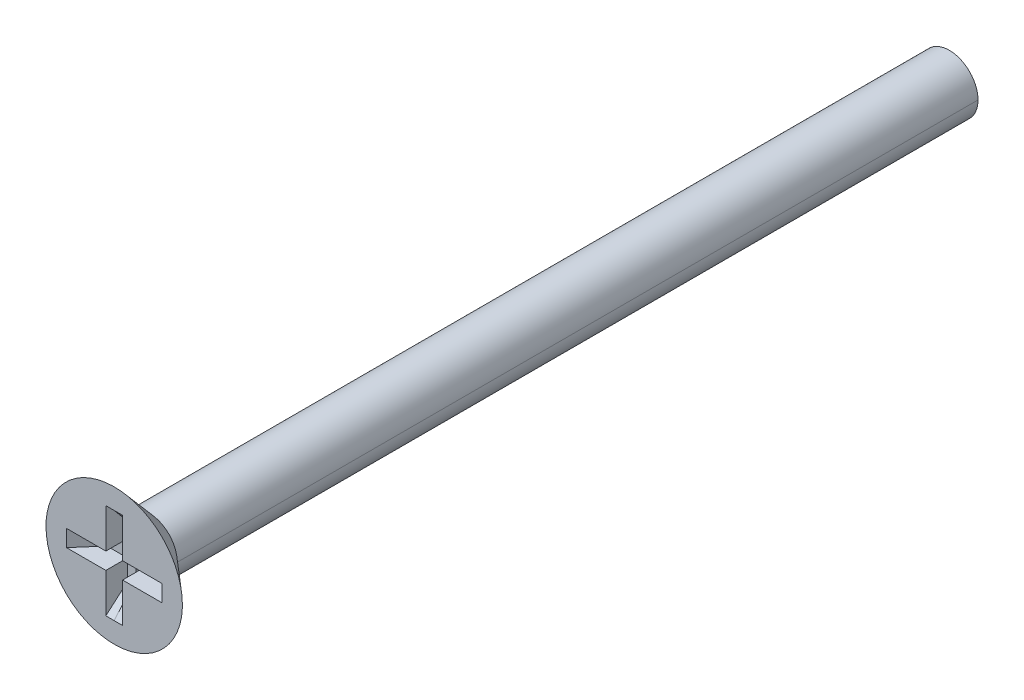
ISO-10303-21;
HEADER;
FILE_DESCRIPTION(('STEP AP214'),'2;1');
FILE_NAME('part.step','',(''),(''),'','','');
FILE_SCHEMA(('AUTOMOTIVE_DESIGN { 1 0 10303 214 1 1 1 1 }'));
ENDSEC;
DATA;
#1=APPLICATION_CONTEXT('core data for automotive mechanical design processes');
#2=APPLICATION_PROTOCOL_DEFINITION('international standard','automotive_design',2000,#1);
#3=PRODUCT_CONTEXT('',#1,'mechanical');
#4=PRODUCT('Part','Part','',(#3));
#5=PRODUCT_RELATED_PRODUCT_CATEGORY('part','',(#4));
#6=PRODUCT_DEFINITION_FORMATION('','',#4);
#7=PRODUCT_DEFINITION_CONTEXT('part definition',#1,'design');
#8=PRODUCT_DEFINITION('design','',#6,#7);
#9=PRODUCT_DEFINITION_SHAPE('','',#8);
#10=(LENGTH_UNIT() NAMED_UNIT(*) SI_UNIT(.MILLI.,.METRE.));
#11=(NAMED_UNIT(*) PLANE_ANGLE_UNIT() SI_UNIT($,.RADIAN.));
#12=(NAMED_UNIT(*) SI_UNIT($,.STERADIAN.) SOLID_ANGLE_UNIT());
#13=UNCERTAINTY_MEASURE_WITH_UNIT(LENGTH_MEASURE(1.E-05),#10,'distance_accuracy_value','');
#14=(GEOMETRIC_REPRESENTATION_CONTEXT(3) GLOBAL_UNCERTAINTY_ASSIGNED_CONTEXT((#13)) GLOBAL_UNIT_ASSIGNED_CONTEXT((#10,
#11,#12)) REPRESENTATION_CONTEXT('',''));
#15=CARTESIAN_POINT('',(0.,0.,0.));
#16=DIRECTION('',(0.,0.,1.));
#17=DIRECTION('',(1.,0.,0.));
#18=AXIS2_PLACEMENT_3D('',#15,#16,#17);
#19=CARTESIAN_POINT('',(0.,2.1766160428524,-0.984980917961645));
#20=DIRECTION('',(-1.,0.,0.));
#21=DIRECTION('',(0.,-1.,0.));
#22=AXIS2_PLACEMENT_3D('',#19,#20,#21);
#23=PLANE('',#22);
#24=CARTESIAN_POINT('',(0.,2.1766160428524,0.));
#25=CARTESIAN_POINT('',(0.,2.09835907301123,-0.0656653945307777));
#26=CARTESIAN_POINT('',(0.,2.02010210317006,-0.131330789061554));
#27=CARTESIAN_POINT('',(0.,1.86358816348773,-0.262661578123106));
#28=CARTESIAN_POINT('',(0.,1.78533119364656,-0.328326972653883));
#29=CARTESIAN_POINT('',(0.,1.62881725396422,-0.459657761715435));
#30=CARTESIAN_POINT('',(0.,1.55056028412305,-0.525323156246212));
#31=CARTESIAN_POINT('',(0.,1.39404634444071,-0.656653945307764));
#32=CARTESIAN_POINT('',(0.,1.31578937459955,-0.72231933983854));
#33=CARTESIAN_POINT('',(0.,1.15927543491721,-0.853650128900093));
#34=CARTESIAN_POINT('',(0.,1.08101846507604,-0.919315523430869));
#35=CARTESIAN_POINT('',(0.,1.00276149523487,-0.984980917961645));
#36=B_SPLINE_CURVE_WITH_KNOTS('',3,(#24,#25,#26,#27,#28,#29,#30,#31,#32,#33,#34,#35),
.UNSPECIFIED.,.F.,.F.,(4,2,2,2,2,4),(0.,0.2,0.4,0.6,0.8,1.),.UNSPECIFIED.);
#37=CARTESIAN_POINT('',(0.,2.1766160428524,0.));
#38=VERTEX_POINT('',#37);
#39=CARTESIAN_POINT('',(0.,1.00276149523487,-0.984980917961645));
#40=VERTEX_POINT('',#39);
#41=EDGE_CURVE('E29',#38,#40,#36,.T.);
#42=ORIENTED_EDGE('',*,*,#41,.F.);
#43=CARTESIAN_POINT('',(0.,2.1766160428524,0.));
#44=CARTESIAN_POINT('',(0.,2.11953398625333,-0.0656653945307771));
#45=CARTESIAN_POINT('',(0.,2.06245192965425,-0.131330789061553));
#46=CARTESIAN_POINT('',(0.,1.94828781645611,-0.262661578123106));
#47=CARTESIAN_POINT('',(0.,1.89120575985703,-0.328326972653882));
#48=CARTESIAN_POINT('',(0.,1.77704164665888,-0.459657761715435));
#49=CARTESIAN_POINT('',(0.,1.71995959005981,-0.525323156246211));
#50=CARTESIAN_POINT('',(0.,1.60579547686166,-0.656653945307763));
#51=CARTESIAN_POINT('',(0.,1.54871342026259,-0.72231933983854));
#52=CARTESIAN_POINT('',(0.,1.43454930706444,-0.853650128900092));
#53=CARTESIAN_POINT('',(0.,1.37746725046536,-0.919315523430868));
#54=CARTESIAN_POINT('',(0.,1.32038519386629,-0.984980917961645));
#55=B_SPLINE_CURVE_WITH_KNOTS('',3,(#43,#44,#45,#46,#47,#48,#49,#50,#51,#52,#53,#54),
.UNSPECIFIED.,.F.,.F.,(4,2,2,2,2,4),(0.,0.2,0.4,0.6,0.8,1.),.UNSPECIFIED.);
#56=CARTESIAN_POINT('',(0.,1.32038519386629,-0.984980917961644));
#57=VERTEX_POINT('',#56);
#58=EDGE_CURVE('E10',#38,#57,#55,.T.);
#59=ORIENTED_EDGE('',*,*,#58,.T.);
#60=CARTESIAN_POINT('',(0.,1.32038519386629,-0.984980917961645));
#61=CARTESIAN_POINT('',(0.,1.29921028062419,-0.984980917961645));
#62=CARTESIAN_POINT('',(0.,1.2780353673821,-0.984980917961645));
#63=CARTESIAN_POINT('',(0.,1.23568554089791,-0.984980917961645));
#64=CARTESIAN_POINT('',(0.,1.21451062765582,-0.984980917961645));
#65=CARTESIAN_POINT('',(0.,1.17216080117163,-0.984980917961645));
#66=CARTESIAN_POINT('',(0.,1.15098588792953,-0.984980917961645));
#67=CARTESIAN_POINT('',(0.,1.10863606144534,-0.984980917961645));
#68=CARTESIAN_POINT('',(0.,1.08746114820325,-0.984980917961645));
#69=CARTESIAN_POINT('',(0.,1.04511132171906,-0.984980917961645));
#70=CARTESIAN_POINT('',(0.,1.02393640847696,-0.984980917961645));
#71=CARTESIAN_POINT('',(0.,1.00276149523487,-0.984980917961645));
#72=B_SPLINE_CURVE_WITH_KNOTS('',3,(#60,#61,#62,#63,#64,#65,#66,#67,#68,#69,#70,#71),
.UNSPECIFIED.,.F.,.F.,(4,2,2,2,2,4),(0.,0.2,0.4,0.6,0.8,1.),.UNSPECIFIED.);
#73=EDGE_CURVE('E24',#57,#40,#72,.T.);
#74=ORIENTED_EDGE('',*,*,#73,.T.);
#75=EDGE_LOOP('',(#42,#59,#74));
#76=FACE_BOUND('',#75,.T.);
#77=ADVANCED_FACE('F15',(#76),#23,.T.);
#78=CARTESIAN_POINT('',(0.381,2.1766160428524,0.));
#79=DIRECTION('',(0.,-0.64278760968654,0.766044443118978));
#80=DIRECTION('',(-1.,0.,0.));
#81=AXIS2_PLACEMENT_3D('',#78,#79,#80);
#82=PLANE('',#81);
#83=CARTESIAN_POINT('',(0.381,2.1766160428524,0.));
#84=CARTESIAN_POINT('',(0.381,2.06414525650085,-0.0943741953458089));
#85=CARTESIAN_POINT('',(0.381,1.95167447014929,-0.188748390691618));
#86=CARTESIAN_POINT('',(0.381,1.72673289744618,-0.377496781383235));
#87=CARTESIAN_POINT('',(0.381,1.61426211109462,-0.471870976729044));
#88=CARTESIAN_POINT('',(0.381,1.38932053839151,-0.660619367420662));
#89=CARTESIAN_POINT('',(0.381,1.27684975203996,-0.75499356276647));
#90=CARTESIAN_POINT('',(0.381,1.05190817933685,-0.943741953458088));
#91=CARTESIAN_POINT('',(0.381,0.939437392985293,-1.0381161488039));
#92=CARTESIAN_POINT('',(0.381,0.714495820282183,-1.22686453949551));
#93=CARTESIAN_POINT('',(0.381,0.602025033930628,-1.32123873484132));
#94=CARTESIAN_POINT('',(0.381,0.489554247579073,-1.41561293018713));
#95=B_SPLINE_CURVE_WITH_KNOTS('',3,(#83,#84,#85,#86,#87,#88,#89,#90,#91,#92,#93,#94),
.UNSPECIFIED.,.F.,.F.,(4,2,2,2,2,4),(0.,0.2,0.4,0.6,0.8,1.),.UNSPECIFIED.);
#96=CARTESIAN_POINT('',(0.381,2.1766160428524,0.));
#97=VERTEX_POINT('',#96);
#98=CARTESIAN_POINT('',(0.381,0.489554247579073,-1.41561293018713));
#99=VERTEX_POINT('',#98);
#100=EDGE_CURVE('E511',#97,#99,#95,.T.);
#101=ORIENTED_EDGE('',*,*,#100,.F.);
#102=CARTESIAN_POINT('',(0.,2.1766160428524,0.));
#103=CARTESIAN_POINT('',(0.0254000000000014,2.1766160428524,0.));
#104=CARTESIAN_POINT('',(0.0507999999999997,2.1766160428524,0.));
#105=CARTESIAN_POINT('',(0.101600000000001,2.1766160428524,0.));
#106=CARTESIAN_POINT('',(0.127,2.1766160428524,0.));
#107=CARTESIAN_POINT('',(0.177800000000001,2.1766160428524,0.));
#108=CARTESIAN_POINT('',(0.203200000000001,2.1766160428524,0.));
#109=CARTESIAN_POINT('',(0.254000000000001,2.1766160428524,0.));
#110=CARTESIAN_POINT('',(0.2794,2.1766160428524,0.));
#111=CARTESIAN_POINT('',(0.3302,2.1766160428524,0.));
#112=CARTESIAN_POINT('',(0.355600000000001,2.1766160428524,0.));
#113=CARTESIAN_POINT('',(0.381000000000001,2.1766160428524,0.));
#114=B_SPLINE_CURVE_WITH_KNOTS('',3,(#102,#103,#104,#105,#106,#107,#108,#109,#110,#111,#112,
#113),.UNSPECIFIED.,.F.,.F.,(4,2,2,2,2,4),(0.,0.2,0.4,0.6,0.8,1.),.UNSPECIFIED.);
#115=EDGE_CURVE('E480',#38,#97,#114,.T.);
#116=ORIENTED_EDGE('',*,*,#115,.F.);
#117=ORIENTED_EDGE('',*,*,#41,.T.);
#118=CARTESIAN_POINT('',(0.,1.00276149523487,-0.984980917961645));
#119=CARTESIAN_POINT('',(0.,0.968547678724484,-1.01368971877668));
#120=CARTESIAN_POINT('',(0.,0.934333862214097,-1.04239851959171));
#121=CARTESIAN_POINT('',(0.,0.865906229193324,-1.09981612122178));
#122=CARTESIAN_POINT('',(0.,0.831692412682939,-1.12852492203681));
#123=CARTESIAN_POINT('',(0.,0.763264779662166,-1.18594252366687));
#124=CARTESIAN_POINT('',(0.,0.729050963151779,-1.21465132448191));
#125=CARTESIAN_POINT('',(0.,0.660623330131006,-1.27206892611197));
#126=CARTESIAN_POINT('',(0.,0.626409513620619,-1.300777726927));
#127=CARTESIAN_POINT('',(0.,0.557981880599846,-1.35819532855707));
#128=CARTESIAN_POINT('',(0.,0.523768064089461,-1.3869041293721));
#129=CARTESIAN_POINT('',(0.,0.489554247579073,-1.41561293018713));
#130=B_SPLINE_CURVE_WITH_KNOTS('',3,(#118,#119,#120,#121,#122,#123,#124,#125,#126,#127,#128,
#129),.UNSPECIFIED.,.F.,.F.,(4,2,2,2,2,4),(0.,0.2,0.4,0.6,0.8,1.),.UNSPECIFIED.);
#131=CARTESIAN_POINT('',(0.,0.489554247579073,-1.41561293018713));
#132=VERTEX_POINT('',#131);
#133=EDGE_CURVE('E523',#40,#132,#130,.T.);
#134=ORIENTED_EDGE('',*,*,#133,.T.);
#135=CARTESIAN_POINT('',(0.,0.489554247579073,-1.41561293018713));
#136=CARTESIAN_POINT('',(0.0254,0.489554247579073,-1.41561293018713));
#137=CARTESIAN_POINT('',(0.0508,0.489554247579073,-1.41561293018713));
#138=CARTESIAN_POINT('',(0.1016,0.489554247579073,-1.41561293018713));
#139=CARTESIAN_POINT('',(0.127,0.489554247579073,-1.41561293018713));
#140=CARTESIAN_POINT('',(0.1778,0.489554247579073,-1.41561293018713));
#141=CARTESIAN_POINT('',(0.2032,0.489554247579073,-1.41561293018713));
#142=CARTESIAN_POINT('',(0.254,0.489554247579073,-1.41561293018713));
#143=CARTESIAN_POINT('',(0.2794,0.489554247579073,-1.41561293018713));
#144=CARTESIAN_POINT('',(0.3302,0.489554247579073,-1.41561293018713));
#145=CARTESIAN_POINT('',(0.3556,0.489554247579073,-1.41561293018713));
#146=CARTESIAN_POINT('',(0.381,0.489554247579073,-1.41561293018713));
#147=B_SPLINE_CURVE_WITH_KNOTS('',3,(#135,#136,#137,#138,#139,#140,#141,#142,#143,#144,#145,
#146),.UNSPECIFIED.,.F.,.F.,(4,2,2,2,2,4),(0.,0.2,0.4,0.6,0.8,1.),.UNSPECIFIED.);
#148=EDGE_CURVE('E519',#132,#99,#147,.T.);
#149=ORIENTED_EDGE('',*,*,#148,.T.);
#150=EDGE_LOOP('',(#101,#116,#117,#134,#149));
#151=FACE_BOUND('',#150,.T.);
#152=ADVANCED_FACE('F559',(#151),#82,.T.);
#153=CARTESIAN_POINT('',(-0.381,1.32038519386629,-0.984980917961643));
#154=DIRECTION('',(0.,-0.754709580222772,0.656059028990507));
#155=DIRECTION('',(1.,0.,0.));
#156=AXIS2_PLACEMENT_3D('',#153,#154,#155);
#157=PLANE('',#156);
#158=CARTESIAN_POINT('',(-0.381,1.32038519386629,-0.984980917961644));
#159=CARTESIAN_POINT('',(-0.381,1.37746725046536,-0.919315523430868));
#160=CARTESIAN_POINT('',(-0.381,1.43454930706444,-0.853650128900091));
#161=CARTESIAN_POINT('',(-0.381,1.54871342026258,-0.722319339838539));
#162=CARTESIAN_POINT('',(-0.381,1.60579547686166,-0.656653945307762));
#163=CARTESIAN_POINT('',(-0.381,1.71995959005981,-0.52532315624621));
#164=CARTESIAN_POINT('',(-0.381,1.77704164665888,-0.459657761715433));
#165=CARTESIAN_POINT('',(-0.381,1.89120575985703,-0.328326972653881));
#166=CARTESIAN_POINT('',(-0.381,1.9482878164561,-0.262661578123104));
#167=CARTESIAN_POINT('',(-0.381,2.06245192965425,-0.131330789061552));
#168=CARTESIAN_POINT('',(-0.381,2.11953398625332,-0.0656653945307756));
#169=CARTESIAN_POINT('',(-0.381,2.1766160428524,0.));
#170=B_SPLINE_CURVE_WITH_KNOTS('',3,(#158,#159,#160,#161,#162,#163,#164,#165,#166,#167,#168,
#169),.UNSPECIFIED.,.F.,.F.,(4,2,2,2,2,4),(0.,0.2,0.4,0.6,0.8,1.),.UNSPECIFIED.);
#171=CARTESIAN_POINT('',(-0.381,1.32038519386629,-0.984980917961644));
#172=VERTEX_POINT('',#171);
#173=CARTESIAN_POINT('',(-0.381,2.1766160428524,0.));
#174=VERTEX_POINT('',#173);
#175=EDGE_CURVE('E437',#172,#174,#170,.T.);
#176=ORIENTED_EDGE('',*,*,#175,.F.);
#177=CARTESIAN_POINT('',(0.,1.32038519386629,-0.984980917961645));
#178=CARTESIAN_POINT('',(-0.0254,1.32038519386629,-0.984980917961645));
#179=CARTESIAN_POINT('',(-0.0508,1.32038519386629,-0.984980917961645));
#180=CARTESIAN_POINT('',(-0.1016,1.32038519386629,-0.984980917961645));
#181=CARTESIAN_POINT('',(-0.127,1.32038519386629,-0.984980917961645));
#182=CARTESIAN_POINT('',(-0.1778,1.32038519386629,-0.984980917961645));
#183=CARTESIAN_POINT('',(-0.2032,1.32038519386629,-0.984980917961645));
#184=CARTESIAN_POINT('',(-0.254,1.32038519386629,-0.984980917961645));
#185=CARTESIAN_POINT('',(-0.2794,1.32038519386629,-0.984980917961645));
#186=CARTESIAN_POINT('',(-0.3302,1.32038519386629,-0.984980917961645));
#187=CARTESIAN_POINT('',(-0.3556,1.32038519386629,-0.984980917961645));
#188=CARTESIAN_POINT('',(-0.381,1.32038519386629,-0.984980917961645));
#189=B_SPLINE_CURVE_WITH_KNOTS('',3,(#177,#178,#179,#180,#181,#182,#183,#184,#185,#186,#187,
#188),.UNSPECIFIED.,.F.,.F.,(4,2,2,2,2,4),(0.,0.2,0.4,0.6,0.8,1.),.UNSPECIFIED.);
#190=EDGE_CURVE('E516',#57,#172,#189,.T.);
#191=ORIENTED_EDGE('',*,*,#190,.F.);
#192=ORIENTED_EDGE('',*,*,#58,.F.);
#193=CARTESIAN_POINT('',(-0.380999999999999,2.1766160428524,0.));
#194=CARTESIAN_POINT('',(-0.355599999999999,2.1766160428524,0.));
#195=CARTESIAN_POINT('',(-0.3302,2.1766160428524,0.));
#196=CARTESIAN_POINT('',(-0.2794,2.1766160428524,0.));
#197=CARTESIAN_POINT('',(-0.253999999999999,2.1766160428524,0.));
#198=CARTESIAN_POINT('',(-0.203199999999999,2.1766160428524,0.));
#199=CARTESIAN_POINT('',(-0.1778,2.1766160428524,0.));
#200=CARTESIAN_POINT('',(-0.126999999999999,2.1766160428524,0.));
#201=CARTESIAN_POINT('',(-0.1016,2.1766160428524,0.));
#202=CARTESIAN_POINT('',(-0.0508000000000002,2.1766160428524,0.));
#203=CARTESIAN_POINT('',(-0.0254000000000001,2.1766160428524,0.));
#204=CARTESIAN_POINT('',(0.,2.1766160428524,0.));
#205=B_SPLINE_CURVE_WITH_KNOTS('',3,(#193,#194,#195,#196,#197,#198,#199,#200,#201,#202,#203,
#204),.UNSPECIFIED.,.F.,.F.,(4,2,2,2,2,4),(0.,0.2,0.4,0.6,0.8,1.),.UNSPECIFIED.);
#206=EDGE_CURVE('E484',#174,#38,#205,.T.);
#207=ORIENTED_EDGE('',*,*,#206,.F.);
#208=EDGE_LOOP('',(#176,#191,#192,#207));
#209=FACE_BOUND('',#208,.T.);
#210=ADVANCED_FACE('F568',(#209),#157,.T.);
#211=CARTESIAN_POINT('',(0.,-1.32038519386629,-0.984980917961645));
#212=DIRECTION('',(0.,0.,1.));
#213=DIRECTION('',(0.,1.,0.));
#214=AXIS2_PLACEMENT_3D('',#211,#212,#213);
#215=PLANE('',#214);
#216=CARTESIAN_POINT('',(-0.381,-0.381,-0.984980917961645));
#217=CARTESIAN_POINT('',(-0.443625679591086,-0.381,-0.984980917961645));
#218=CARTESIAN_POINT('',(-0.506251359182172,-0.381,-0.984980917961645));
#219=CARTESIAN_POINT('',(-0.631502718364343,-0.381,-0.984980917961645));
#220=CARTESIAN_POINT('',(-0.694128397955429,-0.381,-0.984980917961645));
#221=CARTESIAN_POINT('',(-0.819379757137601,-0.381,-0.984980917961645));
#222=CARTESIAN_POINT('',(-0.882005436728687,-0.381,-0.984980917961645));
#223=CARTESIAN_POINT('',(-1.00725679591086,-0.381,-0.984980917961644));
#224=CARTESIAN_POINT('',(-1.06988247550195,-0.381,-0.984980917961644));
#225=CARTESIAN_POINT('',(-1.19513383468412,-0.381,-0.984980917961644));
#226=CARTESIAN_POINT('',(-1.2577595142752,-0.381,-0.984980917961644));
#227=CARTESIAN_POINT('',(-1.32038519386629,-0.381,-0.984980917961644));
#228=B_SPLINE_CURVE_WITH_KNOTS('',3,(#216,#217,#218,#219,#220,#221,#222,#223,#224,#225,#226,
#227),.UNSPECIFIED.,.F.,.F.,(4,2,2,2,2,4),(0.,0.2,0.4,0.6,0.8,1.),.UNSPECIFIED.);
#229=CARTESIAN_POINT('',(-0.381,-0.381,-0.984980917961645));
#230=VERTEX_POINT('',#229);
#231=CARTESIAN_POINT('',(-1.32038519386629,-0.381,-0.984980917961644));
#232=VERTEX_POINT('',#231);
#233=EDGE_CURVE('E428',#230,#232,#228,.T.);
#234=ORIENTED_EDGE('',*,*,#233,.F.);
#235=CARTESIAN_POINT('',(-0.381,-1.32038519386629,-0.984980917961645));
#236=CARTESIAN_POINT('',(-0.381,-1.2577595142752,-0.984980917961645));
#237=CARTESIAN_POINT('',(-0.381,-1.19513383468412,-0.984980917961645));
#238=CARTESIAN_POINT('',(-0.381,-1.06988247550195,-0.984980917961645));
#239=CARTESIAN_POINT('',(-0.381,-1.00725679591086,-0.984980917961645));
#240=CARTESIAN_POINT('',(-0.381,-0.882005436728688,-0.984980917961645));
#241=CARTESIAN_POINT('',(-0.381,-0.819379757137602,-0.984980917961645));
#242=CARTESIAN_POINT('',(-0.381,-0.69412839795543,-0.984980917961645));
#243=CARTESIAN_POINT('',(-0.381,-0.631502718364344,-0.984980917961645));
#244=CARTESIAN_POINT('',(-0.381,-0.506251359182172,-0.984980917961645));
#245=CARTESIAN_POINT('',(-0.381,-0.443625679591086,-0.984980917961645));
#246=CARTESIAN_POINT('',(-0.381,-0.381,-0.984980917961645));
#247=B_SPLINE_CURVE_WITH_KNOTS('',3,(#235,#236,#237,#238,#239,#240,#241,#242,#243,#244,#245,
#246),.UNSPECIFIED.,.F.,.F.,(4,2,2,2,2,4),(0.,0.2,0.4,0.6,0.8,1.),.UNSPECIFIED.);
#248=CARTESIAN_POINT('',(-0.381,-1.32038519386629,-0.984980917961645));
#249=VERTEX_POINT('',#248);
#250=EDGE_CURVE('E414',#249,#230,#247,.T.);
#251=ORIENTED_EDGE('',*,*,#250,.F.);
#252=CARTESIAN_POINT('',(0.,-1.32038519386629,-0.984980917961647));
#253=CARTESIAN_POINT('',(-0.0254,-1.32038519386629,-0.984980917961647));
#254=CARTESIAN_POINT('',(-0.0508,-1.32038519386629,-0.984980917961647));
#255=CARTESIAN_POINT('',(-0.1016,-1.32038519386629,-0.984980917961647));
#256=CARTESIAN_POINT('',(-0.127,-1.32038519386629,-0.984980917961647));
#257=CARTESIAN_POINT('',(-0.1778,-1.32038519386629,-0.984980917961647));
#258=CARTESIAN_POINT('',(-0.2032,-1.32038519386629,-0.984980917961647));
#259=CARTESIAN_POINT('',(-0.254,-1.32038519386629,-0.984980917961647));
#260=CARTESIAN_POINT('',(-0.2794,-1.32038519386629,-0.984980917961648));
#261=CARTESIAN_POINT('',(-0.3302,-1.32038519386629,-0.984980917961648));
#262=CARTESIAN_POINT('',(-0.3556,-1.32038519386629,-0.984980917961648));
#263=CARTESIAN_POINT('',(-0.381,-1.32038519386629,-0.984980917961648));
#264=B_SPLINE_CURVE_WITH_KNOTS('',3,(#252,#253,#254,#255,#256,#257,#258,#259,#260,#261,#262,
#263),.UNSPECIFIED.,.F.,.F.,(4,2,2,2,2,4),(0.,0.2,0.4,0.6,0.8,1.),.UNSPECIFIED.);
#265=CARTESIAN_POINT('',(0.,-1.32038519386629,-0.984980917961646));
#266=VERTEX_POINT('',#265);
#267=EDGE_CURVE('E411',#266,#249,#264,.T.);
#268=ORIENTED_EDGE('',*,*,#267,.F.);
#269=CARTESIAN_POINT('',(0.,-1.00276149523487,-0.984980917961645));
#270=CARTESIAN_POINT('',(0.,-1.02393640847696,-0.984980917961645));
#271=CARTESIAN_POINT('',(0.,-1.04511132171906,-0.984980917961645));
#272=CARTESIAN_POINT('',(0.,-1.08746114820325,-0.984980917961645));
#273=CARTESIAN_POINT('',(0.,-1.10863606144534,-0.984980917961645));
#274=CARTESIAN_POINT('',(0.,-1.15098588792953,-0.984980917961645));
#275=CARTESIAN_POINT('',(0.,-1.17216080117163,-0.984980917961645));
#276=CARTESIAN_POINT('',(0.,-1.21451062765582,-0.984980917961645));
#277=CARTESIAN_POINT('',(0.,-1.23568554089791,-0.984980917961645));
#278=CARTESIAN_POINT('',(0.,-1.2780353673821,-0.984980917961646));
#279=CARTESIAN_POINT('',(0.,-1.2992102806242,-0.984980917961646));
#280=CARTESIAN_POINT('',(0.,-1.32038519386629,-0.984980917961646));
#281=B_SPLINE_CURVE_WITH_KNOTS('',3,(#269,#270,#271,#272,#273,#274,#275,#276,#277,#278,#279,
#280),.UNSPECIFIED.,.F.,.F.,(4,2,2,2,2,4),(0.,0.2,0.4,0.600000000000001,0.8,1.),.UNSPECIFIED.);
#282=CARTESIAN_POINT('',(0.,-1.00276149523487,-0.984980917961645));
#283=VERTEX_POINT('',#282);
#284=EDGE_CURVE('E406',#283,#266,#281,.T.);
#285=ORIENTED_EDGE('',*,*,#284,.F.);
#286=CARTESIAN_POINT('',(0.,1.00276149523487,-0.984980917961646));
#287=CARTESIAN_POINT('',(0.,0.869059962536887,-0.984980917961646));
#288=CARTESIAN_POINT('',(0.,0.735358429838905,-0.984980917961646));
#289=CARTESIAN_POINT('',(0.,0.46795536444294,-0.984980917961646));
#290=CARTESIAN_POINT('',(0.,0.334253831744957,-0.984980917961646));
#291=CARTESIAN_POINT('',(0.,0.0668507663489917,-0.984980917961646));
#292=CARTESIAN_POINT('',(0.,-0.066850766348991,-0.984980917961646));
#293=CARTESIAN_POINT('',(0.,-0.334253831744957,-0.984980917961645));
#294=CARTESIAN_POINT('',(0.,-0.467955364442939,-0.984980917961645));
#295=CARTESIAN_POINT('',(0.,-0.735358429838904,-0.984980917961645));
#296=CARTESIAN_POINT('',(0.,-0.869059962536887,-0.984980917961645));
#297=CARTESIAN_POINT('',(0.,-1.00276149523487,-0.984980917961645));
#298=B_SPLINE_CURVE_WITH_KNOTS('',3,(#286,#287,#288,#289,#290,#291,#292,#293,#294,#295,#296,
#297),.UNSPECIFIED.,.F.,.F.,(4,2,2,2,2,4),(0.,0.2,0.4,0.6,0.8,1.),.UNSPECIFIED.);
#299=EDGE_CURVE('E454',#40,#283,#298,.T.);
#300=ORIENTED_EDGE('',*,*,#299,.F.);
#301=ORIENTED_EDGE('',*,*,#73,.F.);
#302=ORIENTED_EDGE('',*,*,#190,.T.);
#303=CARTESIAN_POINT('',(-0.381,0.381,-0.984980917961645));
#304=CARTESIAN_POINT('',(-0.381,0.443625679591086,-0.984980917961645));
#305=CARTESIAN_POINT('',(-0.381,0.506251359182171,-0.984980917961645));
#306=CARTESIAN_POINT('',(-0.381,0.631502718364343,-0.984980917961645));
#307=CARTESIAN_POINT('',(-0.381,0.69412839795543,-0.984980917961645));
#308=CARTESIAN_POINT('',(-0.381,0.819379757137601,-0.984980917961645));
#309=CARTESIAN_POINT('',(-0.381,0.882005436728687,-0.984980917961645));
#310=CARTESIAN_POINT('',(-0.381,1.00725679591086,-0.984980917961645));
#311=CARTESIAN_POINT('',(-0.381,1.06988247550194,-0.984980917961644));
#312=CARTESIAN_POINT('',(-0.381,1.19513383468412,-0.984980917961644));
#313=CARTESIAN_POINT('',(-0.381,1.2577595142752,-0.984980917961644));
#314=CARTESIAN_POINT('',(-0.381,1.32038519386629,-0.984980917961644));
#315=B_SPLINE_CURVE_WITH_KNOTS('',3,(#303,#304,#305,#306,#307,#308,#309,#310,#311,#312,#313,
#314),.UNSPECIFIED.,.F.,.F.,(4,2,2,2,2,4),(0.,0.2,0.4,0.6,0.8,1.),.UNSPECIFIED.);
#316=CARTESIAN_POINT('',(-0.381,0.381,-0.984980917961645));
#317=VERTEX_POINT('',#316);
#318=EDGE_CURVE('E440',#317,#172,#315,.T.);
#319=ORIENTED_EDGE('',*,*,#318,.F.);
#320=CARTESIAN_POINT('',(-1.32038519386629,0.381,-0.984980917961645));
#321=CARTESIAN_POINT('',(-1.2577595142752,0.381,-0.984980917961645));
#322=CARTESIAN_POINT('',(-1.19513383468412,0.381,-0.984980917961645));
#323=CARTESIAN_POINT('',(-1.06988247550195,0.381,-0.984980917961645));
#324=CARTESIAN_POINT('',(-1.00725679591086,0.381,-0.984980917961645));
#325=CARTESIAN_POINT('',(-0.882005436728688,0.381,-0.984980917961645));
#326=CARTESIAN_POINT('',(-0.819379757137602,0.381,-0.984980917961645));
#327=CARTESIAN_POINT('',(-0.69412839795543,0.381,-0.984980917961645));
#328=CARTESIAN_POINT('',(-0.631502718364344,0.381,-0.984980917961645));
#329=CARTESIAN_POINT('',(-0.506251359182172,0.381,-0.984980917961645));
#330=CARTESIAN_POINT('',(-0.443625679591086,0.381,-0.984980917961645));
#331=CARTESIAN_POINT('',(-0.381,0.381,-0.984980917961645));
#332=B_SPLINE_CURVE_WITH_KNOTS('',3,(#320,#321,#322,#323,#324,#325,#326,#327,#328,#329,#330,
#331),.UNSPECIFIED.,.F.,.F.,(4,2,2,2,2,4),(0.,0.2,0.4,0.6,0.8,1.),.UNSPECIFIED.);
#333=CARTESIAN_POINT('',(-1.32038519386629,0.381,-0.984980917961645));
#334=VERTEX_POINT('',#333);
#335=EDGE_CURVE('E388',#334,#317,#332,.T.);
#336=ORIENTED_EDGE('',*,*,#335,.F.);
#337=CARTESIAN_POINT('',(-1.32038519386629,-0.381,-0.984980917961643));
#338=CARTESIAN_POINT('',(-1.32038519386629,-0.3302,-0.984980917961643));
#339=CARTESIAN_POINT('',(-1.32038519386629,-0.2794,-0.984980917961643));
#340=CARTESIAN_POINT('',(-1.32038519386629,-0.1778,-0.984980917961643));
#341=CARTESIAN_POINT('',(-1.32038519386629,-0.127,-0.984980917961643));
#342=CARTESIAN_POINT('',(-1.32038519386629,-0.0254,-0.984980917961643));
#343=CARTESIAN_POINT('',(-1.32038519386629,0.0254000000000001,-0.984980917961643));
#344=CARTESIAN_POINT('',(-1.32038519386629,0.127,-0.984980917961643));
#345=CARTESIAN_POINT('',(-1.32038519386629,0.1778,-0.984980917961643));
#346=CARTESIAN_POINT('',(-1.32038519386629,0.2794,-0.984980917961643));
#347=CARTESIAN_POINT('',(-1.32038519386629,0.3302,-0.984980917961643));
#348=CARTESIAN_POINT('',(-1.32038519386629,0.381,-0.984980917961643));
#349=B_SPLINE_CURVE_WITH_KNOTS('',3,(#337,#338,#339,#340,#341,#342,#343,#344,#345,#346,#347,
#348),.UNSPECIFIED.,.F.,.F.,(4,2,2,2,2,4),(0.,0.2,0.4,0.6,0.8,1.),.UNSPECIFIED.);
#350=EDGE_CURVE('E384',#232,#334,#349,.T.);
#351=ORIENTED_EDGE('',*,*,#350,.F.);
#352=EDGE_LOOP('',(#234,#251,#268,#285,#300,#301,#302,#319,#336,#351));
#353=FACE_BOUND('',#352,.T.);
#354=ADVANCED_FACE('F649',(#353),#215,.T.);
#355=CARTESIAN_POINT('',(0.381,2.1766160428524,-1.41561293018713));
#356=DIRECTION('',(-1.,0.,0.));
#357=DIRECTION('',(0.,-1.,0.));
#358=AXIS2_PLACEMENT_3D('',#355,#356,#357);
#359=PLANE('',#358);
#360=CARTESIAN_POINT('',(0.381,0.381,-0.984980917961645));
#361=CARTESIAN_POINT('',(0.381,0.381,-0.919315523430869));
#362=CARTESIAN_POINT('',(0.381,0.381,-0.853650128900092));
#363=CARTESIAN_POINT('',(0.381,0.381,-0.72231933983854));
#364=CARTESIAN_POINT('',(0.381,0.381,-0.656653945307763));
#365=CARTESIAN_POINT('',(0.381,0.381,-0.525323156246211));
#366=CARTESIAN_POINT('',(0.381,0.381,-0.459657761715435));
#367=CARTESIAN_POINT('',(0.381,0.381,-0.328326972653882));
#368=CARTESIAN_POINT('',(0.381,0.381,-0.262661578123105));
#369=CARTESIAN_POINT('',(0.381,0.381,-0.131330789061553));
#370=CARTESIAN_POINT('',(0.381,0.381,-0.0656653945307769));
#371=CARTESIAN_POINT('',(0.381,0.381,0.));
#372=B_SPLINE_CURVE_WITH_KNOTS('',3,(#360,#361,#362,#363,#364,#365,#366,#367,#368,#369,#370,
#371),.UNSPECIFIED.,.F.,.F.,(4,2,2,2,2,4),(0.,0.2,0.4,0.6,0.8,1.),.UNSPECIFIED.);
#373=CARTESIAN_POINT('',(0.381,0.381,-0.984980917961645));
#374=VERTEX_POINT('',#373);
#375=CARTESIAN_POINT('',(0.381,0.381,0.));
#376=VERTEX_POINT('',#375);
#377=EDGE_CURVE('E514',#374,#376,#372,.T.);
#378=ORIENTED_EDGE('',*,*,#377,.T.);
#379=CARTESIAN_POINT('',(0.381000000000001,2.1766160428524,0.));
#380=CARTESIAN_POINT('',(0.381000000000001,2.05690830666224,0.));
#381=CARTESIAN_POINT('',(0.381000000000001,1.93720057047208,0.));
#382=CARTESIAN_POINT('',(0.381000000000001,1.69778509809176,0.));
#383=CARTESIAN_POINT('',(0.381000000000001,1.5780773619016,0.));
#384=CARTESIAN_POINT('',(0.381000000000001,1.33866188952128,0.));
#385=CARTESIAN_POINT('',(0.381000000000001,1.21895415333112,0.));
#386=CARTESIAN_POINT('',(0.381000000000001,0.9795386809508,0.));
#387=CARTESIAN_POINT('',(0.381000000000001,0.859830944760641,0.));
#388=CARTESIAN_POINT('',(0.381000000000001,0.62041547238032,0.));
#389=CARTESIAN_POINT('',(0.381000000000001,0.50070773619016,0.));
#390=CARTESIAN_POINT('',(0.381000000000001,0.381,0.));
#391=B_SPLINE_CURVE_WITH_KNOTS('',3,(#379,#380,#381,#382,#383,#384,#385,#386,#387,#388,#389,
#390),.UNSPECIFIED.,.F.,.F.,(4,2,2,2,2,4),(0.,0.2,0.4,0.6,0.8,1.),.UNSPECIFIED.);
#392=EDGE_CURVE('E477',#97,#376,#391,.T.);
#393=ORIENTED_EDGE('',*,*,#392,.F.);
#394=ORIENTED_EDGE('',*,*,#100,.T.);
#395=CARTESIAN_POINT('',(0.381,0.489554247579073,-1.41561293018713));
#396=CARTESIAN_POINT('',(0.381,0.424280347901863,-1.41561293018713));
#397=CARTESIAN_POINT('',(0.381,0.359006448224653,-1.41561293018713));
#398=CARTESIAN_POINT('',(0.381,0.228458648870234,-1.41561293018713));
#399=CARTESIAN_POINT('',(0.381,0.163184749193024,-1.41561293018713));
#400=CARTESIAN_POINT('',(0.381,0.0326369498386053,-1.41561293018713));
#401=CARTESIAN_POINT('',(0.381,-0.0326369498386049,-1.41561293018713));
#402=CARTESIAN_POINT('',(0.381,-0.163184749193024,-1.41561293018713));
#403=CARTESIAN_POINT('',(0.381,-0.228458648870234,-1.41561293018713));
#404=CARTESIAN_POINT('',(0.381,-0.359006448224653,-1.41561293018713));
#405=CARTESIAN_POINT('',(0.381,-0.424280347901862,-1.41561293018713));
#406=CARTESIAN_POINT('',(0.381,-0.489554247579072,-1.41561293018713));
#407=B_SPLINE_CURVE_WITH_KNOTS('',3,(#395,#396,#397,#398,#399,#400,#401,#402,#403,#404,#405,
#406),.UNSPECIFIED.,.F.,.F.,(4,2,2,2,2,4),(0.,0.2,0.4,0.6,0.8,1.),.UNSPECIFIED.);
#408=CARTESIAN_POINT('',(0.381,-0.489554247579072,-1.41561293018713));
#409=VERTEX_POINT('',#408);
#410=EDGE_CURVE('E509',#99,#409,#407,.T.);
#411=ORIENTED_EDGE('',*,*,#410,.T.);
#412=CARTESIAN_POINT('',(0.381,-0.489554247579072,-1.41561293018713));
#413=CARTESIAN_POINT('',(0.381,-0.602025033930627,-1.32123873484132));
#414=CARTESIAN_POINT('',(0.381,-0.714495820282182,-1.22686453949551));
#415=CARTESIAN_POINT('',(0.381,-0.939437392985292,-1.0381161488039));
#416=CARTESIAN_POINT('',(0.381,-1.05190817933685,-0.943741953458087));
#417=CARTESIAN_POINT('',(0.381,-1.27684975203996,-0.754993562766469));
#418=CARTESIAN_POINT('',(0.381,-1.38932053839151,-0.66061936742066));
#419=CARTESIAN_POINT('',(0.381,-1.61426211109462,-0.471870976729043));
#420=CARTESIAN_POINT('',(0.381,-1.72673289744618,-0.377496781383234));
#421=CARTESIAN_POINT('',(0.381,-1.95167447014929,-0.188748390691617));
#422=CARTESIAN_POINT('',(0.381,-2.06414525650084,-0.0943741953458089));
#423=CARTESIAN_POINT('',(0.381,-2.1766160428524,0.));
#424=B_SPLINE_CURVE_WITH_KNOTS('',3,(#412,#413,#414,#415,#416,#417,#418,#419,#420,#421,#422,
#423),.UNSPECIFIED.,.F.,.F.,(4,2,2,2,2,4),(0.,0.2,0.4,0.6,0.8,1.),.UNSPECIFIED.);
#425=CARTESIAN_POINT('',(0.381,-2.1766160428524,0.));
#426=VERTEX_POINT('',#425);
#427=EDGE_CURVE('E507',#409,#426,#424,.T.);
#428=ORIENTED_EDGE('',*,*,#427,.T.);
#429=CARTESIAN_POINT('',(0.381000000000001,-0.380999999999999,0.));
#430=CARTESIAN_POINT('',(0.381000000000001,-0.50070773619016,0.));
#431=CARTESIAN_POINT('',(0.381000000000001,-0.62041547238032,0.));
#432=CARTESIAN_POINT('',(0.381000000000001,-0.85983094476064,0.));
#433=CARTESIAN_POINT('',(0.381000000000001,-0.979538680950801,0.));
#434=CARTESIAN_POINT('',(0.381000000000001,-1.21895415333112,0.));
#435=CARTESIAN_POINT('',(0.381000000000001,-1.33866188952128,0.));
#436=CARTESIAN_POINT('',(0.381000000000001,-1.5780773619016,0.));
#437=CARTESIAN_POINT('',(0.381000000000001,-1.69778509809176,0.));
#438=CARTESIAN_POINT('',(0.381000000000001,-1.93720057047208,0.));
#439=CARTESIAN_POINT('',(0.381000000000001,-2.05690830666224,0.));
#440=CARTESIAN_POINT('',(0.381000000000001,-2.1766160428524,0.));
#441=B_SPLINE_CURVE_WITH_KNOTS('',3,(#429,#430,#431,#432,#433,#434,#435,#436,#437,#438,#439,
#440),.UNSPECIFIED.,.F.,.F.,(4,2,2,2,2,4),(0.,0.2,0.4,0.6,0.8,1.),.UNSPECIFIED.);
#442=CARTESIAN_POINT('',(0.381,-0.381,0.));
#443=VERTEX_POINT('',#442);
#444=EDGE_CURVE('E468',#443,#426,#441,.T.);
#445=ORIENTED_EDGE('',*,*,#444,.F.);
#446=CARTESIAN_POINT('',(0.381,-0.381,0.));
#447=CARTESIAN_POINT('',(0.381,-0.381,-0.0656653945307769));
#448=CARTESIAN_POINT('',(0.381,-0.381,-0.131330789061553));
#449=CARTESIAN_POINT('',(0.381,-0.381,-0.262661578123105));
#450=CARTESIAN_POINT('',(0.381,-0.381,-0.328326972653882));
#451=CARTESIAN_POINT('',(0.381,-0.381,-0.459657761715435));
#452=CARTESIAN_POINT('',(0.381,-0.381,-0.525323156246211));
#453=CARTESIAN_POINT('',(0.381,-0.381,-0.656653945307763));
#454=CARTESIAN_POINT('',(0.381,-0.381,-0.72231933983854));
#455=CARTESIAN_POINT('',(0.381,-0.381,-0.853650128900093));
#456=CARTESIAN_POINT('',(0.381,-0.381,-0.919315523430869));
#457=CARTESIAN_POINT('',(0.381,-0.381,-0.984980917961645));
#458=B_SPLINE_CURVE_WITH_KNOTS('',3,(#446,#447,#448,#449,#450,#451,#452,#453,#454,#455,#456,
#457),.UNSPECIFIED.,.F.,.F.,(4,2,2,2,2,4),(0.,0.2,0.4,0.6,0.8,1.),.UNSPECIFIED.);
#459=CARTESIAN_POINT('',(0.381,-0.381,-0.984980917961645));
#460=VERTEX_POINT('',#459);
#461=EDGE_CURVE('E504',#443,#460,#458,.T.);
#462=ORIENTED_EDGE('',*,*,#461,.T.);
#463=CARTESIAN_POINT('',(0.381,-0.381,-0.984980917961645));
#464=CARTESIAN_POINT('',(0.381,-0.3302,-0.984980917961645));
#465=CARTESIAN_POINT('',(0.381,-0.2794,-0.984980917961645));
#466=CARTESIAN_POINT('',(0.381,-0.1778,-0.984980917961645));
#467=CARTESIAN_POINT('',(0.381,-0.127,-0.984980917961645));
#468=CARTESIAN_POINT('',(0.381,-0.0254000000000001,-0.984980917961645));
#469=CARTESIAN_POINT('',(0.381,0.0254000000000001,-0.984980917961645));
#470=CARTESIAN_POINT('',(0.381,0.127,-0.984980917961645));
#471=CARTESIAN_POINT('',(0.381,0.1778,-0.984980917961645));
#472=CARTESIAN_POINT('',(0.381,0.2794,-0.984980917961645));
#473=CARTESIAN_POINT('',(0.381,0.3302,-0.984980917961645));
#474=CARTESIAN_POINT('',(0.381,0.381,-0.984980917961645));
#475=B_SPLINE_CURVE_WITH_KNOTS('',3,(#463,#464,#465,#466,#467,#468,#469,#470,#471,#472,#473,
#474),.UNSPECIFIED.,.F.,.F.,(4,2,2,2,2,4),(0.,0.2,0.4,0.6,0.8,1.),.UNSPECIFIED.);
#476=EDGE_CURVE('E502',#460,#374,#475,.T.);
#477=ORIENTED_EDGE('',*,*,#476,.T.);
#478=EDGE_LOOP('',(#378,#393,#394,#411,#428,#445,#462,#477));
#479=FACE_BOUND('',#478,.T.);
#480=ADVANCED_FACE('F658',(#479),#359,.T.);
#481=CARTESIAN_POINT('',(-3.1115,-3.19933097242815,0.));
#482=DIRECTION('',(0.,0.,1.));
#483=DIRECTION('',(1.,0.,0.));
#484=AXIS2_PLACEMENT_3D('',#481,#482,#483);
#485=PLANE('',#484);
#486=CARTESIAN_POINT('',(3.1115,0.,0.));
#487=CARTESIAN_POINT('',(3.11130936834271,0.469205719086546,0.));
#488=CARTESIAN_POINT('',(3.00364993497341,0.938111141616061,0.));
#489=CARTESIAN_POINT('',(2.5523624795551,1.86648886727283,0.));
#490=CARTESIAN_POINT('',(2.16582242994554,2.30367772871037,0.));
#491=CARTESIAN_POINT('',(1.25622654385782,2.89404177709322,0.));
#492=CARTESIAN_POINT('',(0.746539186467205,3.06532305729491,0.));
#493=CARTESIAN_POINT('',(-0.272573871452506,3.13973198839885,0.));
#494=CARTESIAN_POINT('',(-0.78028580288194,3.05349778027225,0.));
#495=CARTESIAN_POINT('',(-1.68001828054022,2.6626654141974,0.));
#496=CARTESIAN_POINT('',(-2.07522357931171,2.36753339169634,0.));
#497=CARTESIAN_POINT('',(-2.75453638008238,1.55769413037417,0.));
#498=CARTESIAN_POINT('',(-2.99859922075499,1.0110790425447,0.));
#499=CARTESIAN_POINT('',(-3.10096776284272,0.294526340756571,0.));
#500=CARTESIAN_POINT('',(-3.11144016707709,0.14726803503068,0.));
#501=CARTESIAN_POINT('',(-3.1115,0.,0.));
#502=B_SPLINE_CURVE_WITH_KNOTS('',3,(#486,#487,#488,#489,#490,#491,#492,#493,#494,#495,#496,
#497,#498,#499,#500,#501),.UNSPECIFIED.,.F.,.F.,(4,2,2,2,2,2,2,4),(0.,0.144,0.3168,0.4768,
0.6304,0.777856,0.9548032,1.),.UNSPECIFIED.);
#503=CARTESIAN_POINT('',(3.1115,0.,0.));
#504=VERTEX_POINT('',#503);
#505=CARTESIAN_POINT('',(-3.1115,0.,0.));
#506=VERTEX_POINT('',#505);
#507=EDGE_CURVE('E499',#504,#506,#502,.T.);
#508=ORIENTED_EDGE('',*,*,#507,.T.);
#509=CARTESIAN_POINT('',(-3.1115,0.,0.));
#510=CARTESIAN_POINT('',(-3.1113093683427,-0.469205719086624,0.));
#511=CARTESIAN_POINT('',(-3.00364993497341,-0.938111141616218,0.));
#512=CARTESIAN_POINT('',(-2.5523624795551,-1.86648886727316,0.));
#513=CARTESIAN_POINT('',(-2.16582242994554,-2.3036777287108,0.));
#514=CARTESIAN_POINT('',(-1.25622654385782,-2.89404177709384,0.));
#515=CARTESIAN_POINT('',(-0.746539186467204,-3.06532305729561,0.));
#516=CARTESIAN_POINT('',(0.272573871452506,-3.13973198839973,0.));
#517=CARTESIAN_POINT('',(0.780285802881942,-3.05349778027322,0.));
#518=CARTESIAN_POINT('',(1.68001828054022,-2.66266541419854,0.));
#519=CARTESIAN_POINT('',(2.07522357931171,-2.36753339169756,0.));
#520=CARTESIAN_POINT('',(2.75453638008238,-1.55769413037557,0.));
#521=CARTESIAN_POINT('',(2.99859922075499,-1.01107904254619,0.));
#522=CARTESIAN_POINT('',(3.10096776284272,-0.294526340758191,0.));
#523=CARTESIAN_POINT('',(3.11144016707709,-0.147268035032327,0.));
#524=CARTESIAN_POINT('',(3.1115,-1.67227343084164E-12,0.));
#525=B_SPLINE_CURVE_WITH_KNOTS('',3,(#509,#510,#511,#512,#513,#514,#515,#516,#517,#518,#519,
#520,#521,#522,#523,#524),.UNSPECIFIED.,.F.,.F.,(4,2,2,2,2,2,2,4),(0.,0.144,0.3168,0.4768,
0.6304,0.777856,0.9548032,1.),.UNSPECIFIED.);
#526=EDGE_CURVE('E343',#506,#504,#525,.T.);
#527=ORIENTED_EDGE('',*,*,#526,.T.);
#528=EDGE_LOOP('',(#508,#527));
#529=FACE_BOUND('',#528,.T.);
#530=CARTESIAN_POINT('',(-0.380999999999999,-2.1766160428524,0.));
#531=CARTESIAN_POINT('',(-0.380999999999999,-2.05690830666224,0.));
#532=CARTESIAN_POINT('',(-0.380999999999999,-1.93720057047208,0.));
#533=CARTESIAN_POINT('',(-0.380999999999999,-1.69778509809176,0.));
#534=CARTESIAN_POINT('',(-0.380999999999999,-1.5780773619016,0.));
#535=CARTESIAN_POINT('',(-0.380999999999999,-1.33866188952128,0.));
#536=CARTESIAN_POINT('',(-0.380999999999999,-1.21895415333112,0.));
#537=CARTESIAN_POINT('',(-0.380999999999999,-0.979538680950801,0.));
#538=CARTESIAN_POINT('',(-0.380999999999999,-0.859830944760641,0.));
#539=CARTESIAN_POINT('',(-0.380999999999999,-0.620415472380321,0.));
#540=CARTESIAN_POINT('',(-0.380999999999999,-0.50070773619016,0.));
#541=CARTESIAN_POINT('',(-0.380999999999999,-0.380999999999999,0.));
#542=B_SPLINE_CURVE_WITH_KNOTS('',3,(#530,#531,#532,#533,#534,#535,#536,#537,#538,#539,#540,
#541),.UNSPECIFIED.,.F.,.F.,(4,2,2,2,2,4),(0.,0.2,0.4,0.6,0.8,1.),.UNSPECIFIED.);
#543=CARTESIAN_POINT('',(-0.381,-2.1766160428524,0.));
#544=VERTEX_POINT('',#543);
#545=CARTESIAN_POINT('',(-0.381,-0.381,0.));
#546=VERTEX_POINT('',#545);
#547=EDGE_CURVE('E496',#544,#546,#542,.T.);
#548=ORIENTED_EDGE('',*,*,#547,.T.);
#549=CARTESIAN_POINT('',(-0.380999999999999,-0.380999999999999,0.));
#550=CARTESIAN_POINT('',(-0.500707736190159,-0.380999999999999,0.));
#551=CARTESIAN_POINT('',(-0.62041547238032,-0.381,0.));
#552=CARTESIAN_POINT('',(-0.85983094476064,-0.381,0.));
#553=CARTESIAN_POINT('',(-0.9795386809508,-0.380999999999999,0.));
#554=CARTESIAN_POINT('',(-1.21895415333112,-0.380999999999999,0.));
#555=CARTESIAN_POINT('',(-1.33866188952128,-0.381,0.));
#556=CARTESIAN_POINT('',(-1.5780773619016,-0.381,0.));
#557=CARTESIAN_POINT('',(-1.69778509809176,-0.380999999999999,0.));
#558=CARTESIAN_POINT('',(-1.93720057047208,-0.380999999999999,0.));
#559=CARTESIAN_POINT('',(-2.05690830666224,-0.380999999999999,0.));
#560=CARTESIAN_POINT('',(-2.1766160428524,-0.380999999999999,0.));
#561=B_SPLINE_CURVE_WITH_KNOTS('',3,(#549,#550,#551,#552,#553,#554,#555,#556,#557,#558,#559,
#560),.UNSPECIFIED.,.F.,.F.,(4,2,2,2,2,4),(0.,0.2,0.4,0.6,0.8,1.),.UNSPECIFIED.);
#562=CARTESIAN_POINT('',(-2.1766160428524,-0.381,0.));
#563=VERTEX_POINT('',#562);
#564=EDGE_CURVE('E494',#546,#563,#561,.T.);
#565=ORIENTED_EDGE('',*,*,#564,.T.);
#566=CARTESIAN_POINT('',(-2.1766160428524,-0.380999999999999,0.));
#567=CARTESIAN_POINT('',(-2.1766160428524,-0.3302,0.));
#568=CARTESIAN_POINT('',(-2.1766160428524,-0.279399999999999,0.));
#569=CARTESIAN_POINT('',(-2.1766160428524,-0.177799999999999,0.));
#570=CARTESIAN_POINT('',(-2.1766160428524,-0.127,0.));
#571=CARTESIAN_POINT('',(-2.1766160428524,-0.0253999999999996,0.));
#572=CARTESIAN_POINT('',(-2.1766160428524,0.0254000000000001,0.));
#573=CARTESIAN_POINT('',(-2.1766160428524,0.127,0.));
#574=CARTESIAN_POINT('',(-2.1766160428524,0.1778,0.));
#575=CARTESIAN_POINT('',(-2.1766160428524,0.2794,0.));
#576=CARTESIAN_POINT('',(-2.1766160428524,0.3302,0.));
#577=CARTESIAN_POINT('',(-2.1766160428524,0.381,0.));
#578=B_SPLINE_CURVE_WITH_KNOTS('',3,(#566,#567,#568,#569,#570,#571,#572,#573,#574,#575,#576,
#577),.UNSPECIFIED.,.F.,.F.,(4,2,2,2,2,4),(0.,0.2,0.4,0.6,0.8,1.),.UNSPECIFIED.);
#579=CARTESIAN_POINT('',(-2.1766160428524,0.381000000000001,0.));
#580=VERTEX_POINT('',#579);
#581=EDGE_CURVE('E492',#563,#580,#578,.T.);
#582=ORIENTED_EDGE('',*,*,#581,.T.);
#583=CARTESIAN_POINT('',(-2.1766160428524,0.381,0.));
#584=CARTESIAN_POINT('',(-2.05690830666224,0.381,0.));
#585=CARTESIAN_POINT('',(-1.93720057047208,0.381,0.));
#586=CARTESIAN_POINT('',(-1.69778509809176,0.381,0.));
#587=CARTESIAN_POINT('',(-1.5780773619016,0.381,0.));
#588=CARTESIAN_POINT('',(-1.33866188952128,0.381,0.));
#589=CARTESIAN_POINT('',(-1.21895415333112,0.381,0.));
#590=CARTESIAN_POINT('',(-0.979538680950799,0.381,0.));
#591=CARTESIAN_POINT('',(-0.859830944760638,0.381,0.));
#592=CARTESIAN_POINT('',(-0.620415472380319,0.381,0.));
#593=CARTESIAN_POINT('',(-0.500707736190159,0.381,0.));
#594=CARTESIAN_POINT('',(-0.380999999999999,0.381,0.));
#595=B_SPLINE_CURVE_WITH_KNOTS('',3,(#583,#584,#585,#586,#587,#588,#589,#590,#591,#592,#593,
#594),.UNSPECIFIED.,.F.,.F.,(4,2,2,2,2,4),(0.,0.2,0.4,0.6,0.8,1.),.UNSPECIFIED.);
#596=CARTESIAN_POINT('',(-0.381,0.381000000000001,0.));
#597=VERTEX_POINT('',#596);
#598=EDGE_CURVE('E490',#580,#597,#595,.T.);
#599=ORIENTED_EDGE('',*,*,#598,.T.);
#600=CARTESIAN_POINT('',(-0.380999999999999,0.381,0.));
#601=CARTESIAN_POINT('',(-0.380999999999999,0.50070773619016,0.));
#602=CARTESIAN_POINT('',(-0.380999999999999,0.62041547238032,0.));
#603=CARTESIAN_POINT('',(-0.380999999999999,0.859830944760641,0.));
#604=CARTESIAN_POINT('',(-0.380999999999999,0.9795386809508,0.));
#605=CARTESIAN_POINT('',(-0.380999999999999,1.21895415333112,0.));
#606=CARTESIAN_POINT('',(-0.380999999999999,1.33866188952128,0.));
#607=CARTESIAN_POINT('',(-0.380999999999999,1.5780773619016,0.));
#608=CARTESIAN_POINT('',(-0.380999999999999,1.69778509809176,0.));
#609=CARTESIAN_POINT('',(-0.380999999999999,1.93720057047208,0.));
#610=CARTESIAN_POINT('',(-0.380999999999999,2.05690830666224,0.));
#611=CARTESIAN_POINT('',(-0.380999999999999,2.1766160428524,0.));
#612=B_SPLINE_CURVE_WITH_KNOTS('',3,(#600,#601,#602,#603,#604,#605,#606,#607,#608,#609,#610,
#611),.UNSPECIFIED.,.F.,.F.,(4,2,2,2,2,4),(0.,0.2,0.4,0.6,0.8,1.),.UNSPECIFIED.);
#613=EDGE_CURVE('E487',#597,#174,#612,.T.);
#614=ORIENTED_EDGE('',*,*,#613,.T.);
#615=ORIENTED_EDGE('',*,*,#206,.T.);
#616=ORIENTED_EDGE('',*,*,#115,.T.);
#617=ORIENTED_EDGE('',*,*,#392,.T.);
#618=CARTESIAN_POINT('',(0.381000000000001,0.381,0.));
#619=CARTESIAN_POINT('',(0.500707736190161,0.381,0.));
#620=CARTESIAN_POINT('',(0.620415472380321,0.381,0.));
#621=CARTESIAN_POINT('',(0.859830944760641,0.381,0.));
#622=CARTESIAN_POINT('',(0.9795386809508,0.381,0.));
#623=CARTESIAN_POINT('',(1.21895415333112,0.381,0.));
#624=CARTESIAN_POINT('',(1.33866188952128,0.381,0.));
#625=CARTESIAN_POINT('',(1.5780773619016,0.381,0.));
#626=CARTESIAN_POINT('',(1.69778509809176,0.381,0.));
#627=CARTESIAN_POINT('',(1.93720057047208,0.381,0.));
#628=CARTESIAN_POINT('',(2.05690830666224,0.381,0.));
#629=CARTESIAN_POINT('',(2.1766160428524,0.381,0.));
#630=B_SPLINE_CURVE_WITH_KNOTS('',3,(#618,#619,#620,#621,#622,#623,#624,#625,#626,#627,#628,
#629),.UNSPECIFIED.,.F.,.F.,(4,2,2,2,2,4),(0.,0.2,0.4,0.6,0.8,1.),.UNSPECIFIED.);
#631=CARTESIAN_POINT('',(2.1766160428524,0.381000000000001,0.));
#632=VERTEX_POINT('',#631);
#633=EDGE_CURVE('E475',#376,#632,#630,.T.);
#634=ORIENTED_EDGE('',*,*,#633,.T.);
#635=CARTESIAN_POINT('',(2.1766160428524,0.381,0.));
#636=CARTESIAN_POINT('',(2.1766160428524,0.3302,0.));
#637=CARTESIAN_POINT('',(2.1766160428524,0.2794,0.));
#638=CARTESIAN_POINT('',(2.1766160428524,0.1778,0.));
#639=CARTESIAN_POINT('',(2.1766160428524,0.127,0.));
#640=CARTESIAN_POINT('',(2.1766160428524,0.0254000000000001,0.));
#641=CARTESIAN_POINT('',(2.1766160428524,-0.0253999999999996,0.));
#642=CARTESIAN_POINT('',(2.1766160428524,-0.127,0.));
#643=CARTESIAN_POINT('',(2.1766160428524,-0.1778,0.));
#644=CARTESIAN_POINT('',(2.1766160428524,-0.2794,0.));
#645=CARTESIAN_POINT('',(2.1766160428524,-0.3302,0.));
#646=CARTESIAN_POINT('',(2.1766160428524,-0.380999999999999,0.));
#647=B_SPLINE_CURVE_WITH_KNOTS('',3,(#635,#636,#637,#638,#639,#640,#641,#642,#643,#644,#645,
#646),.UNSPECIFIED.,.F.,.F.,(4,2,2,2,2,4),(0.,0.2,0.4,0.6,0.8,1.),.UNSPECIFIED.);
#648=CARTESIAN_POINT('',(2.1766160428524,-0.381,0.));
#649=VERTEX_POINT('',#648);
#650=EDGE_CURVE('E295',#632,#649,#647,.T.);
#651=ORIENTED_EDGE('',*,*,#650,.T.);
#652=CARTESIAN_POINT('',(2.1766160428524,-0.380999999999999,0.));
#653=CARTESIAN_POINT('',(2.05690830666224,-0.380999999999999,0.));
#654=CARTESIAN_POINT('',(1.93720057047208,-0.380999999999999,0.));
#655=CARTESIAN_POINT('',(1.69778509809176,-0.380999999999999,0.));
#656=CARTESIAN_POINT('',(1.5780773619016,-0.381,0.));
#657=CARTESIAN_POINT('',(1.33866188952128,-0.381,0.));
#658=CARTESIAN_POINT('',(1.21895415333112,-0.381,0.));
#659=CARTESIAN_POINT('',(0.979538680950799,-0.381,0.));
#660=CARTESIAN_POINT('',(0.85983094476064,-0.380999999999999,0.));
#661=CARTESIAN_POINT('',(0.620415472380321,-0.380999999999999,0.));
#662=CARTESIAN_POINT('',(0.500707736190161,-0.380999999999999,0.));
#663=CARTESIAN_POINT('',(0.381000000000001,-0.380999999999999,0.));
#664=B_SPLINE_CURVE_WITH_KNOTS('',3,(#652,#653,#654,#655,#656,#657,#658,#659,#660,#661,#662,
#663),.UNSPECIFIED.,.F.,.F.,(4,2,2,2,2,4),(0.,0.2,0.4,0.6,0.8,1.),.UNSPECIFIED.);
#665=EDGE_CURVE('E471',#649,#443,#664,.T.);
#666=ORIENTED_EDGE('',*,*,#665,.T.);
#667=ORIENTED_EDGE('',*,*,#444,.T.);
#668=CARTESIAN_POINT('',(0.381000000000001,-2.1766160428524,0.));
#669=CARTESIAN_POINT('',(0.355600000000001,-2.1766160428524,0.));
#670=CARTESIAN_POINT('',(0.3302,-2.1766160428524,0.));
#671=CARTESIAN_POINT('',(0.2794,-2.1766160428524,0.));
#672=CARTESIAN_POINT('',(0.254000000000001,-2.1766160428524,0.));
#673=CARTESIAN_POINT('',(0.2032,-2.1766160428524,0.));
#674=CARTESIAN_POINT('',(0.177800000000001,-2.1766160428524,0.));
#675=CARTESIAN_POINT('',(0.127,-2.1766160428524,0.));
#676=CARTESIAN_POINT('',(0.1016,-2.1766160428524,0.));
#677=CARTESIAN_POINT('',(0.0507999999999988,-2.1766160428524,0.));
#678=CARTESIAN_POINT('',(0.0254000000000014,-2.1766160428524,0.));
#679=CARTESIAN_POINT('',(0.,-2.1766160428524,0.));
#680=B_SPLINE_CURVE_WITH_KNOTS('',3,(#668,#669,#670,#671,#672,#673,#674,#675,#676,#677,#678,
#679),.UNSPECIFIED.,.F.,.F.,(4,2,2,2,2,4),(0.,0.2,0.4,0.6,0.8,1.),.UNSPECIFIED.);
#681=CARTESIAN_POINT('',(0.,-2.1766160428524,0.));
#682=VERTEX_POINT('',#681);
#683=EDGE_CURVE('E464',#426,#682,#680,.T.);
#684=ORIENTED_EDGE('',*,*,#683,.T.);
#685=CARTESIAN_POINT('',(0.,-2.1766160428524,0.));
#686=CARTESIAN_POINT('',(-0.0254000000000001,-2.1766160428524,0.));
#687=CARTESIAN_POINT('',(-0.0508000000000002,-2.1766160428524,0.));
#688=CARTESIAN_POINT('',(-0.1016,-2.1766160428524,0.));
#689=CARTESIAN_POINT('',(-0.127,-2.1766160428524,0.));
#690=CARTESIAN_POINT('',(-0.1778,-2.1766160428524,0.));
#691=CARTESIAN_POINT('',(-0.2032,-2.1766160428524,0.));
#692=CARTESIAN_POINT('',(-0.253999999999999,-2.1766160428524,0.));
#693=CARTESIAN_POINT('',(-0.2794,-2.1766160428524,0.));
#694=CARTESIAN_POINT('',(-0.3302,-2.1766160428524,0.));
#695=CARTESIAN_POINT('',(-0.355599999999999,-2.1766160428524,0.));
#696=CARTESIAN_POINT('',(-0.380999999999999,-2.1766160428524,0.));
#697=B_SPLINE_CURVE_WITH_KNOTS('',3,(#685,#686,#687,#688,#689,#690,#691,#692,#693,#694,#695,
#696),.UNSPECIFIED.,.F.,.F.,(4,2,2,2,2,4),(0.,0.2,0.4,0.6,0.8,1.),.UNSPECIFIED.);
#698=EDGE_CURVE('E459',#682,#544,#697,.T.);
#699=ORIENTED_EDGE('',*,*,#698,.T.);
#700=EDGE_LOOP('',(#548,#565,#582,#599,#614,#615,#616,#617,#634,#651,#666,#667,#684,#699));
#701=FACE_BOUND('',#700,.T.);
#702=ADVANCED_FACE('F1066',(#529,#701),#485,.T.);
#703=CARTESIAN_POINT('',(0.,1.00276149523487,-1.41561293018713));
#704=DIRECTION('',(1.,0.,0.));
#705=DIRECTION('',(0.,0.,1.));
#706=AXIS2_PLACEMENT_3D('',#703,#704,#705);
#707=PLANE('',#706);
#708=ORIENTED_EDGE('',*,*,#299,.T.);
#709=CARTESIAN_POINT('',(0.,-0.489554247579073,-1.41561293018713));
#710=CARTESIAN_POINT('',(0.,-0.52376806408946,-1.3869041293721));
#711=CARTESIAN_POINT('',(0.,-0.557981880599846,-1.35819532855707));
#712=CARTESIAN_POINT('',(0.,-0.626409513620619,-1.300777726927));
#713=CARTESIAN_POINT('',(0.,-0.660623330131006,-1.27206892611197));
#714=CARTESIAN_POINT('',(0.,-0.729050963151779,-1.21465132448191));
#715=CARTESIAN_POINT('',(0.,-0.763264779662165,-1.18594252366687));
#716=CARTESIAN_POINT('',(0.,-0.831692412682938,-1.12852492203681));
#717=CARTESIAN_POINT('',(0.,-0.865906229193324,-1.09981612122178));
#718=CARTESIAN_POINT('',(0.,-0.934333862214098,-1.04239851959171));
#719=CARTESIAN_POINT('',(0.,-0.968547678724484,-1.01368971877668));
#720=CARTESIAN_POINT('',(0.,-1.00276149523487,-0.984980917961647));
#721=B_SPLINE_CURVE_WITH_KNOTS('',3,(#709,#710,#711,#712,#713,#714,#715,#716,#717,#718,#719,
#720),.UNSPECIFIED.,.F.,.F.,(4,2,2,2,2,4),(0.,0.2,0.4,0.6,0.8,1.),.UNSPECIFIED.);
#722=CARTESIAN_POINT('',(0.,-0.489554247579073,-1.41561293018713));
#723=VERTEX_POINT('',#722);
#724=EDGE_CURVE('E372',#723,#283,#721,.T.);
#725=ORIENTED_EDGE('',*,*,#724,.F.);
#726=CARTESIAN_POINT('',(0.,0.489554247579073,-1.41561293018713));
#727=CARTESIAN_POINT('',(0.,0.424280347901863,-1.41561293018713));
#728=CARTESIAN_POINT('',(0.,0.359006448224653,-1.41561293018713));
#729=CARTESIAN_POINT('',(0.,0.228458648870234,-1.41561293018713));
#730=CARTESIAN_POINT('',(0.,0.163184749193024,-1.41561293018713));
#731=CARTESIAN_POINT('',(0.,0.032636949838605,-1.41561293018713));
#732=CARTESIAN_POINT('',(0.,-0.0326369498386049,-1.41561293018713));
#733=CARTESIAN_POINT('',(0.,-0.163184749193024,-1.41561293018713));
#734=CARTESIAN_POINT('',(0.,-0.228458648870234,-1.41561293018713));
#735=CARTESIAN_POINT('',(0.,-0.359006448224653,-1.41561293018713));
#736=CARTESIAN_POINT('',(0.,-0.424280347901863,-1.41561293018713));
#737=CARTESIAN_POINT('',(0.,-0.489554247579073,-1.41561293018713));
#738=B_SPLINE_CURVE_WITH_KNOTS('',3,(#726,#727,#728,#729,#730,#731,#732,#733,#734,#735,#736,
#737),.UNSPECIFIED.,.F.,.F.,(4,2,2,2,2,4),(0.,0.2,0.4,0.6,0.8,1.),.UNSPECIFIED.);
#739=EDGE_CURVE('E448',#132,#723,#738,.T.);
#740=ORIENTED_EDGE('',*,*,#739,.F.);
#741=ORIENTED_EDGE('',*,*,#133,.F.);
#742=EDGE_LOOP('',(#708,#725,#740,#741));
#743=FACE_BOUND('',#742,.T.);
#744=ADVANCED_FACE('F1069',(#743),#707,.T.);
#745=CARTESIAN_POINT('',(0.381,-0.489554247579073,-1.41561293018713));
#746=DIRECTION('',(0.,0.,1.));
#747=DIRECTION('',(0.,1.,0.));
#748=AXIS2_PLACEMENT_3D('',#745,#746,#747);
#749=PLANE('',#748);
#750=ORIENTED_EDGE('',*,*,#410,.F.);
#751=ORIENTED_EDGE('',*,*,#148,.F.);
#752=ORIENTED_EDGE('',*,*,#739,.T.);
#753=CARTESIAN_POINT('',(0.,-0.489554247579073,-1.41561293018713));
#754=CARTESIAN_POINT('',(0.0254,-0.489554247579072,-1.41561293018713));
#755=CARTESIAN_POINT('',(0.0508,-0.489554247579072,-1.41561293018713));
#756=CARTESIAN_POINT('',(0.1016,-0.489554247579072,-1.41561293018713));
#757=CARTESIAN_POINT('',(0.127,-0.489554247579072,-1.41561293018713));
#758=CARTESIAN_POINT('',(0.1778,-0.489554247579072,-1.41561293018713));
#759=CARTESIAN_POINT('',(0.2032,-0.489554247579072,-1.41561293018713));
#760=CARTESIAN_POINT('',(0.254,-0.489554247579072,-1.41561293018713));
#761=CARTESIAN_POINT('',(0.2794,-0.489554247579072,-1.41561293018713));
#762=CARTESIAN_POINT('',(0.3302,-0.489554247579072,-1.41561293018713));
#763=CARTESIAN_POINT('',(0.3556,-0.489554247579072,-1.41561293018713));
#764=CARTESIAN_POINT('',(0.381,-0.489554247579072,-1.41561293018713));
#765=B_SPLINE_CURVE_WITH_KNOTS('',3,(#753,#754,#755,#756,#757,#758,#759,#760,#761,#762,#763,
#764),.UNSPECIFIED.,.F.,.F.,(4,2,2,2,2,4),(0.,0.2,0.4,0.6,0.8,1.),.UNSPECIFIED.);
#766=EDGE_CURVE('E445',#723,#409,#765,.T.);
#767=ORIENTED_EDGE('',*,*,#766,.T.);
#768=EDGE_LOOP('',(#750,#751,#752,#767));
#769=FACE_BOUND('',#768,.T.);
#770=ADVANCED_FACE('F1072',(#769),#749,.T.);
#771=CARTESIAN_POINT('',(-0.381,2.1766160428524,-0.984980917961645));
#772=DIRECTION('',(1.,0.,0.));
#773=DIRECTION('',(0.,0.,1.));
#774=AXIS2_PLACEMENT_3D('',#771,#772,#773);
#775=PLANE('',#774);
#776=CARTESIAN_POINT('',(-0.381,0.381,-0.984980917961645));
#777=CARTESIAN_POINT('',(-0.381,0.381,-0.919315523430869));
#778=CARTESIAN_POINT('',(-0.381,0.381,-0.853650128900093));
#779=CARTESIAN_POINT('',(-0.381,0.381,-0.72231933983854));
#780=CARTESIAN_POINT('',(-0.381,0.381,-0.656653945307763));
#781=CARTESIAN_POINT('',(-0.381,0.381,-0.525323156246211));
#782=CARTESIAN_POINT('',(-0.381,0.381,-0.459657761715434));
#783=CARTESIAN_POINT('',(-0.381,0.381,-0.328326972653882));
#784=CARTESIAN_POINT('',(-0.381,0.381,-0.262661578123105));
#785=CARTESIAN_POINT('',(-0.381,0.381,-0.131330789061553));
#786=CARTESIAN_POINT('',(-0.381,0.381,-0.0656653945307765));
#787=CARTESIAN_POINT('',(-0.381,0.381,0.));
#788=B_SPLINE_CURVE_WITH_KNOTS('',3,(#776,#777,#778,#779,#780,#781,#782,#783,#784,#785,#786,
#787),.UNSPECIFIED.,.F.,.F.,(4,2,2,2,2,4),(0.,0.2,0.4,0.6,0.8,1.),.UNSPECIFIED.);
#789=EDGE_CURVE('E399',#317,#597,#788,.T.);
#790=ORIENTED_EDGE('',*,*,#789,.F.);
#791=ORIENTED_EDGE('',*,*,#318,.T.);
#792=ORIENTED_EDGE('',*,*,#175,.T.);
#793=ORIENTED_EDGE('',*,*,#613,.F.);
#794=EDGE_LOOP('',(#790,#791,#792,#793));
#795=FACE_BOUND('',#794,.T.);
#796=ADVANCED_FACE('F1076',(#795),#775,.T.);
#797=CARTESIAN_POINT('',(-2.1766160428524,-0.381,-0.984980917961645));
#798=DIRECTION('',(0.,1.,0.));
#799=DIRECTION('',(0.,0.,1.));
#800=AXIS2_PLACEMENT_3D('',#797,#798,#799);
#801=PLANE('',#800);
#802=CARTESIAN_POINT('',(-0.381,-0.381,0.));
#803=CARTESIAN_POINT('',(-0.381,-0.381,-0.0656653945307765));
#804=CARTESIAN_POINT('',(-0.381,-0.381,-0.131330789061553));
#805=CARTESIAN_POINT('',(-0.381,-0.381,-0.262661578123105));
#806=CARTESIAN_POINT('',(-0.381,-0.381,-0.328326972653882));
#807=CARTESIAN_POINT('',(-0.381,-0.381,-0.459657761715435));
#808=CARTESIAN_POINT('',(-0.381,-0.381,-0.525323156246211));
#809=CARTESIAN_POINT('',(-0.381,-0.381,-0.656653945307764));
#810=CARTESIAN_POINT('',(-0.381,-0.381,-0.72231933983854));
#811=CARTESIAN_POINT('',(-0.381,-0.381,-0.853650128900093));
#812=CARTESIAN_POINT('',(-0.381,-0.381,-0.919315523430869));
#813=CARTESIAN_POINT('',(-0.381,-0.381,-0.984980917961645));
#814=B_SPLINE_CURVE_WITH_KNOTS('',3,(#802,#803,#804,#805,#806,#807,#808,#809,#810,#811,#812,
#813),.UNSPECIFIED.,.F.,.F.,(4,2,2,2,2,4),(0.,0.2,0.4,0.6,0.8,1.),.UNSPECIFIED.);
#815=EDGE_CURVE('E434',#546,#230,#814,.T.);
#816=ORIENTED_EDGE('',*,*,#815,.T.);
#817=ORIENTED_EDGE('',*,*,#233,.T.);
#818=CARTESIAN_POINT('',(-1.32038519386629,-0.381,-0.984980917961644));
#819=CARTESIAN_POINT('',(-1.37746725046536,-0.381,-0.919315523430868));
#820=CARTESIAN_POINT('',(-1.43454930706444,-0.381,-0.853650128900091));
#821=CARTESIAN_POINT('',(-1.54871342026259,-0.381,-0.722319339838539));
#822=CARTESIAN_POINT('',(-1.60579547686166,-0.381,-0.656653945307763));
#823=CARTESIAN_POINT('',(-1.71995959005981,-0.381,-0.52532315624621));
#824=CARTESIAN_POINT('',(-1.77704164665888,-0.381,-0.459657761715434));
#825=CARTESIAN_POINT('',(-1.89120575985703,-0.381,-0.328326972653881));
#826=CARTESIAN_POINT('',(-1.9482878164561,-0.381,-0.262661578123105));
#827=CARTESIAN_POINT('',(-2.06245192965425,-0.381,-0.131330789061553));
#828=CARTESIAN_POINT('',(-2.11953398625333,-0.381,-0.0656653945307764));
#829=CARTESIAN_POINT('',(-2.1766160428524,-0.381,0.));
#830=B_SPLINE_CURVE_WITH_KNOTS('',3,(#818,#819,#820,#821,#822,#823,#824,#825,#826,#827,#828,
#829),.UNSPECIFIED.,.F.,.F.,(4,2,2,2,2,4),(0.,0.2,0.4,0.6,0.8,1.),.UNSPECIFIED.);
#831=EDGE_CURVE('E424',#232,#563,#830,.T.);
#832=ORIENTED_EDGE('',*,*,#831,.T.);
#833=ORIENTED_EDGE('',*,*,#564,.F.);
#834=EDGE_LOOP('',(#816,#817,#832,#833));
#835=FACE_BOUND('',#834,.T.);
#836=ADVANCED_FACE('F1080',(#835),#801,.T.);
#837=CARTESIAN_POINT('',(-0.381,-0.381,-0.984980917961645));
#838=DIRECTION('',(1.,0.,0.));
#839=DIRECTION('',(0.,0.,1.));
#840=AXIS2_PLACEMENT_3D('',#837,#838,#839);
#841=PLANE('',#840);
#842=ORIENTED_EDGE('',*,*,#815,.F.);
#843=ORIENTED_EDGE('',*,*,#547,.F.);
#844=CARTESIAN_POINT('',(-0.381,-2.1766160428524,0.));
#845=CARTESIAN_POINT('',(-0.381,-2.11953398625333,-0.0656653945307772));
#846=CARTESIAN_POINT('',(-0.381,-2.06245192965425,-0.131330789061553));
#847=CARTESIAN_POINT('',(-0.381,-1.94828781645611,-0.262661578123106));
#848=CARTESIAN_POINT('',(-0.381,-1.89120575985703,-0.328326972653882));
#849=CARTESIAN_POINT('',(-0.381,-1.77704164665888,-0.459657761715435));
#850=CARTESIAN_POINT('',(-0.381,-1.71995959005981,-0.525323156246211));
#851=CARTESIAN_POINT('',(-0.381,-1.60579547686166,-0.656653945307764));
#852=CARTESIAN_POINT('',(-0.381,-1.54871342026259,-0.72231933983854));
#853=CARTESIAN_POINT('',(-0.381,-1.43454930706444,-0.853650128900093));
#854=CARTESIAN_POINT('',(-0.381,-1.37746725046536,-0.919315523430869));
#855=CARTESIAN_POINT('',(-0.381,-1.32038519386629,-0.984980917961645));
#856=B_SPLINE_CURVE_WITH_KNOTS('',3,(#844,#845,#846,#847,#848,#849,#850,#851,#852,#853,#854,
#855),.UNSPECIFIED.,.F.,.F.,(4,2,2,2,2,4),(0.,0.2,0.4,0.6,0.8,1.),.UNSPECIFIED.);
#857=EDGE_CURVE('E419',#544,#249,#856,.T.);
#858=ORIENTED_EDGE('',*,*,#857,.T.);
#859=ORIENTED_EDGE('',*,*,#250,.T.);
#860=EDGE_LOOP('',(#842,#843,#858,#859));
#861=FACE_BOUND('',#860,.T.);
#862=ADVANCED_FACE('F733',(#861),#841,.T.);
#863=CARTESIAN_POINT('',(-0.381,-2.1766160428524,0.));
#864=DIRECTION('',(0.,0.754709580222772,0.656059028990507));
#865=DIRECTION('',(1.,0.,0.));
#866=AXIS2_PLACEMENT_3D('',#863,#864,#865);
#867=PLANE('',#866);
#868=ORIENTED_EDGE('',*,*,#857,.F.);
#869=ORIENTED_EDGE('',*,*,#698,.F.);
#870=CARTESIAN_POINT('',(0.,-1.32038519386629,-0.984980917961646));
#871=CARTESIAN_POINT('',(0.,-1.37746725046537,-0.91931552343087));
#872=CARTESIAN_POINT('',(0.,-1.43454930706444,-0.853650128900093));
#873=CARTESIAN_POINT('',(0.,-1.54871342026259,-0.72231933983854));
#874=CARTESIAN_POINT('',(0.,-1.60579547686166,-0.656653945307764));
#875=CARTESIAN_POINT('',(0.,-1.71995959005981,-0.525323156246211));
#876=CARTESIAN_POINT('',(0.,-1.77704164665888,-0.459657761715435));
#877=CARTESIAN_POINT('',(0.,-1.89120575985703,-0.328326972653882));
#878=CARTESIAN_POINT('',(0.,-1.94828781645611,-0.262661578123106));
#879=CARTESIAN_POINT('',(0.,-2.06245192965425,-0.131330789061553));
#880=CARTESIAN_POINT('',(0.,-2.11953398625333,-0.0656653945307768));
#881=CARTESIAN_POINT('',(0.,-2.1766160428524,0.));
#882=B_SPLINE_CURVE_WITH_KNOTS('',3,(#870,#871,#872,#873,#874,#875,#876,#877,#878,#879,#880,
#881),.UNSPECIFIED.,.F.,.F.,(4,2,2,2,2,4),(0.,0.2,0.4,0.6,0.8,1.),.UNSPECIFIED.);
#883=EDGE_CURVE('E402',#266,#682,#882,.T.);
#884=ORIENTED_EDGE('',*,*,#883,.F.);
#885=ORIENTED_EDGE('',*,*,#267,.T.);
#886=EDGE_LOOP('',(#868,#869,#884,#885));
#887=FACE_BOUND('',#886,.T.);
#888=ADVANCED_FACE('F713',(#887),#867,.T.);
#889=CARTESIAN_POINT('',(0.,-1.00276149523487,-0.984980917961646));
#890=DIRECTION('',(-1.,0.,0.));
#891=DIRECTION('',(0.,-1.,0.));
#892=AXIS2_PLACEMENT_3D('',#889,#890,#891);
#893=PLANE('',#892);
#894=CARTESIAN_POINT('',(0.,-1.00276149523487,-0.984980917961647));
#895=CARTESIAN_POINT('',(0.,-1.08101846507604,-0.91931552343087));
#896=CARTESIAN_POINT('',(0.,-1.15927543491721,-0.853650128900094));
#897=CARTESIAN_POINT('',(0.,-1.31578937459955,-0.722319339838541));
#898=CARTESIAN_POINT('',(0.,-1.39404634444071,-0.656653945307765));
#899=CARTESIAN_POINT('',(0.,-1.55056028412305,-0.525323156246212));
#900=CARTESIAN_POINT('',(0.,-1.62881725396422,-0.459657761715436));
#901=CARTESIAN_POINT('',(0.,-1.78533119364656,-0.328326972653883));
#902=CARTESIAN_POINT('',(0.,-1.86358816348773,-0.262661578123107));
#903=CARTESIAN_POINT('',(0.,-2.02010210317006,-0.131330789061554));
#904=CARTESIAN_POINT('',(0.,-2.09835907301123,-0.0656653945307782));
#905=CARTESIAN_POINT('',(0.,-2.1766160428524,0.));
#906=B_SPLINE_CURVE_WITH_KNOTS('',3,(#894,#895,#896,#897,#898,#899,#900,#901,#902,#903,#904,
#905),.UNSPECIFIED.,.F.,.F.,(4,2,2,2,2,4),(0.,0.2,0.4,0.6,0.8,1.),.UNSPECIFIED.);
#907=EDGE_CURVE('E368',#283,#682,#906,.T.);
#908=ORIENTED_EDGE('',*,*,#907,.F.);
#909=ORIENTED_EDGE('',*,*,#284,.T.);
#910=ORIENTED_EDGE('',*,*,#883,.T.);
#911=EDGE_LOOP('',(#908,#909,#910));
#912=FACE_BOUND('',#911,.T.);
#913=ADVANCED_FACE('F732',(#912),#893,.T.);
#914=CARTESIAN_POINT('',(-2.1766160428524,0.381,-0.984980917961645));
#915=DIRECTION('',(0.,-1.,0.));
#916=DIRECTION('',(1.,0.,0.));
#917=AXIS2_PLACEMENT_3D('',#914,#915,#916);
#918=PLANE('',#917);
#919=ORIENTED_EDGE('',*,*,#789,.T.);
#920=ORIENTED_EDGE('',*,*,#598,.F.);
#921=CARTESIAN_POINT('',(-2.1766160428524,0.381,0.));
#922=CARTESIAN_POINT('',(-2.11953398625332,0.381,-0.0656653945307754));
#923=CARTESIAN_POINT('',(-2.06245192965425,0.381,-0.131330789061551));
#924=CARTESIAN_POINT('',(-1.9482878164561,0.381,-0.262661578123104));
#925=CARTESIAN_POINT('',(-1.89120575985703,0.381,-0.328326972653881));
#926=CARTESIAN_POINT('',(-1.77704164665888,0.381,-0.459657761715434));
#927=CARTESIAN_POINT('',(-1.71995959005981,0.381,-0.52532315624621));
#928=CARTESIAN_POINT('',(-1.60579547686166,0.381,-0.656653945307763));
#929=CARTESIAN_POINT('',(-1.54871342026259,0.381,-0.72231933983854));
#930=CARTESIAN_POINT('',(-1.43454930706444,0.381,-0.853650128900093));
#931=CARTESIAN_POINT('',(-1.37746725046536,0.381,-0.919315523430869));
#932=CARTESIAN_POINT('',(-1.32038519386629,0.381,-0.984980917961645));
#933=B_SPLINE_CURVE_WITH_KNOTS('',3,(#921,#922,#923,#924,#925,#926,#927,#928,#929,#930,#931,
#932),.UNSPECIFIED.,.F.,.F.,(4,2,2,2,2,4),(0.,0.2,0.4,0.6,0.8,1.),.UNSPECIFIED.);
#934=EDGE_CURVE('E394',#580,#334,#933,.T.);
#935=ORIENTED_EDGE('',*,*,#934,.T.);
#936=ORIENTED_EDGE('',*,*,#335,.T.);
#937=EDGE_LOOP('',(#919,#920,#935,#936));
#938=FACE_BOUND('',#937,.T.);
#939=ADVANCED_FACE('F782',(#938),#918,.T.);
#940=CARTESIAN_POINT('',(-2.1766160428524,0.381000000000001,0.));
#941=DIRECTION('',(0.754709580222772,0.,0.656059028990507));
#942=DIRECTION('',(0.,-1.,0.));
#943=AXIS2_PLACEMENT_3D('',#940,#941,#942);
#944=PLANE('',#943);
#945=ORIENTED_EDGE('',*,*,#831,.F.);
#946=ORIENTED_EDGE('',*,*,#350,.T.);
#947=ORIENTED_EDGE('',*,*,#934,.F.);
#948=ORIENTED_EDGE('',*,*,#581,.F.);
#949=EDGE_LOOP('',(#945,#946,#947,#948));
#950=FACE_BOUND('',#949,.T.);
#951=ADVANCED_FACE('F791',(#950),#944,.T.);
#952=CARTESIAN_POINT('',(0.381,0.381,-0.984980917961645));
#953=DIRECTION('',(0.,-1.,0.));
#954=DIRECTION('',(1.,0.,0.));
#955=AXIS2_PLACEMENT_3D('',#952,#953,#954);
#956=PLANE('',#955);
#957=ORIENTED_EDGE('',*,*,#377,.F.);
#958=CARTESIAN_POINT('',(0.381,0.381,-0.984980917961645));
#959=CARTESIAN_POINT('',(0.443625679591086,0.381,-0.984980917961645));
#960=CARTESIAN_POINT('',(0.506251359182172,0.381,-0.984980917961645));
#961=CARTESIAN_POINT('',(0.631502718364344,0.381,-0.984980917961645));
#962=CARTESIAN_POINT('',(0.69412839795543,0.381,-0.984980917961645));
#963=CARTESIAN_POINT('',(0.819379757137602,0.381,-0.984980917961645));
#964=CARTESIAN_POINT('',(0.882005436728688,0.381,-0.984980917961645));
#965=CARTESIAN_POINT('',(1.00725679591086,0.381,-0.984980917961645));
#966=CARTESIAN_POINT('',(1.06988247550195,0.381,-0.984980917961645));
#967=CARTESIAN_POINT('',(1.19513383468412,0.381,-0.984980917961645));
#968=CARTESIAN_POINT('',(1.2577595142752,0.381,-0.984980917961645));
#969=CARTESIAN_POINT('',(1.32038519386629,0.381,-0.984980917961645));
#970=B_SPLINE_CURVE_WITH_KNOTS('',3,(#958,#959,#960,#961,#962,#963,#964,#965,#966,#967,#968,
#969),.UNSPECIFIED.,.F.,.F.,(4,2,2,2,2,4),(0.,0.2,0.4,0.6,0.8,1.),.UNSPECIFIED.);
#971=CARTESIAN_POINT('',(1.32038519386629,0.381,-0.984980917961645));
#972=VERTEX_POINT('',#971);
#973=EDGE_CURVE('E380',#374,#972,#970,.T.);
#974=ORIENTED_EDGE('',*,*,#973,.T.);
#975=CARTESIAN_POINT('',(1.32038519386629,0.381,-0.984980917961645));
#976=CARTESIAN_POINT('',(1.37746725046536,0.381,-0.919315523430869));
#977=CARTESIAN_POINT('',(1.43454930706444,0.381,-0.853650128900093));
#978=CARTESIAN_POINT('',(1.54871342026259,0.381,-0.72231933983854));
#979=CARTESIAN_POINT('',(1.60579547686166,0.381,-0.656653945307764));
#980=CARTESIAN_POINT('',(1.71995959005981,0.381,-0.525323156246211));
#981=CARTESIAN_POINT('',(1.77704164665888,0.381,-0.459657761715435));
#982=CARTESIAN_POINT('',(1.89120575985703,0.381,-0.328326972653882));
#983=CARTESIAN_POINT('',(1.9482878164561,0.381,-0.262661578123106));
#984=CARTESIAN_POINT('',(2.06245192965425,0.381,-0.131330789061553));
#985=CARTESIAN_POINT('',(2.11953398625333,0.381,-0.0656653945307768));
#986=CARTESIAN_POINT('',(2.1766160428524,0.381,0.));
#987=B_SPLINE_CURVE_WITH_KNOTS('',3,(#975,#976,#977,#978,#979,#980,#981,#982,#983,#984,#985,
#986),.UNSPECIFIED.,.F.,.F.,(4,2,2,2,2,4),(0.,0.2,0.4,0.6,0.8,1.),.UNSPECIFIED.);
#988=EDGE_CURVE('E285',#972,#632,#987,.T.);
#989=ORIENTED_EDGE('',*,*,#988,.T.);
#990=ORIENTED_EDGE('',*,*,#633,.F.);
#991=EDGE_LOOP('',(#957,#974,#989,#990));
#992=FACE_BOUND('',#991,.T.);
#993=ADVANCED_FACE('F860',(#992),#956,.T.);
#994=CARTESIAN_POINT('',(0.381,-0.489554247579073,-1.41561293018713));
#995=DIRECTION('',(0.,0.64278760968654,0.766044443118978));
#996=DIRECTION('',(-1.,0.,0.));
#997=AXIS2_PLACEMENT_3D('',#994,#995,#996);
#998=PLANE('',#997);
#999=ORIENTED_EDGE('',*,*,#427,.F.);
#1000=ORIENTED_EDGE('',*,*,#766,.F.);
#1001=ORIENTED_EDGE('',*,*,#724,.T.);
#1002=ORIENTED_EDGE('',*,*,#907,.T.);
#1003=ORIENTED_EDGE('',*,*,#683,.F.);
#1004=EDGE_LOOP('',(#999,#1000,#1001,#1002,#1003));
#1005=FACE_BOUND('',#1004,.T.);
#1006=ADVANCED_FACE('F869',(#1005),#998,.T.);
#1007=CARTESIAN_POINT('',(0.381,-0.381,-0.984980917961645));
#1008=DIRECTION('',(0.,1.,0.));
#1009=DIRECTION('',(0.,0.,1.));
#1010=AXIS2_PLACEMENT_3D('',#1007,#1008,#1009);
#1011=PLANE('',#1010);
#1012=ORIENTED_EDGE('',*,*,#461,.F.);
#1013=ORIENTED_EDGE('',*,*,#665,.F.);
#1014=CARTESIAN_POINT('',(2.1766160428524,-0.381,0.));
#1015=CARTESIAN_POINT('',(2.11953398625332,-0.381,-0.0656653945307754));
#1016=CARTESIAN_POINT('',(2.06245192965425,-0.381,-0.131330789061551));
#1017=CARTESIAN_POINT('',(1.9482878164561,-0.381,-0.262661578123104));
#1018=CARTESIAN_POINT('',(1.89120575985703,-0.381,-0.328326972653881));
#1019=CARTESIAN_POINT('',(1.77704164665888,-0.381,-0.459657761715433));
#1020=CARTESIAN_POINT('',(1.71995959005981,-0.381,-0.52532315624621));
#1021=CARTESIAN_POINT('',(1.60579547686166,-0.381,-0.656653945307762));
#1022=CARTESIAN_POINT('',(1.54871342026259,-0.381,-0.722319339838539));
#1023=CARTESIAN_POINT('',(1.43454930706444,-0.381,-0.853650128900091));
#1024=CARTESIAN_POINT('',(1.37746725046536,-0.381,-0.919315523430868));
#1025=CARTESIAN_POINT('',(1.32038519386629,-0.381,-0.984980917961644));
#1026=B_SPLINE_CURVE_WITH_KNOTS('',3,(#1014,#1015,#1016,#1017,#1018,#1019,#1020,#1021,#1022,
#1023,#1024,#1025),.UNSPECIFIED.,.F.,.F.,(4,2,2,2,2,4),(0.,0.2,0.4,0.6,0.8,1.),.UNSPECIFIED.);
#1027=CARTESIAN_POINT('',(1.32038519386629,-0.381,-0.984980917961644));
#1028=VERTEX_POINT('',#1027);
#1029=EDGE_CURVE('E305',#649,#1028,#1026,.T.);
#1030=ORIENTED_EDGE('',*,*,#1029,.T.);
#1031=CARTESIAN_POINT('',(1.32038519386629,-0.381,-0.984980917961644));
#1032=CARTESIAN_POINT('',(1.2577595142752,-0.381,-0.984980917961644));
#1033=CARTESIAN_POINT('',(1.19513383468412,-0.381,-0.984980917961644));
#1034=CARTESIAN_POINT('',(1.06988247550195,-0.381,-0.984980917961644));
#1035=CARTESIAN_POINT('',(1.00725679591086,-0.381,-0.984980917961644));
#1036=CARTESIAN_POINT('',(0.882005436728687,-0.381,-0.984980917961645));
#1037=CARTESIAN_POINT('',(0.819379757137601,-0.381,-0.984980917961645));
#1038=CARTESIAN_POINT('',(0.694128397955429,-0.381,-0.984980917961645));
#1039=CARTESIAN_POINT('',(0.631502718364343,-0.381,-0.984980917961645));
#1040=CARTESIAN_POINT('',(0.506251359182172,-0.381,-0.984980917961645));
#1041=CARTESIAN_POINT('',(0.443625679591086,-0.381,-0.984980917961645));
#1042=CARTESIAN_POINT('',(0.381,-0.381,-0.984980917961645));
#1043=B_SPLINE_CURVE_WITH_KNOTS('',3,(#1031,#1032,#1033,#1034,#1035,#1036,#1037,#1038,#1039,
#1040,#1041,#1042),.UNSPECIFIED.,.F.,.F.,(4,2,2,2,2,4),(0.,0.2,0.4,0.6,0.8,1.),.UNSPECIFIED.);
#1044=EDGE_CURVE('E358',#1028,#460,#1043,.T.);
#1045=ORIENTED_EDGE('',*,*,#1044,.T.);
#1046=EDGE_LOOP('',(#1012,#1013,#1030,#1045));
#1047=FACE_BOUND('',#1046,.T.);
#1048=ADVANCED_FACE('F948',(#1047),#1011,.T.);
#1049=CARTESIAN_POINT('',(1.32038519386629,-0.381,-0.984980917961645));
#1050=DIRECTION('',(0.,0.,1.));
#1051=DIRECTION('',(0.,1.,0.));
#1052=AXIS2_PLACEMENT_3D('',#1049,#1050,#1051);
#1053=PLANE('',#1052);
#1054=ORIENTED_EDGE('',*,*,#476,.F.);
#1055=ORIENTED_EDGE('',*,*,#1044,.F.);
#1056=CARTESIAN_POINT('',(1.32038519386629,-0.381,-0.984980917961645));
#1057=CARTESIAN_POINT('',(1.32038519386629,-0.3302,-0.984980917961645));
#1058=CARTESIAN_POINT('',(1.32038519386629,-0.2794,-0.984980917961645));
#1059=CARTESIAN_POINT('',(1.32038519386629,-0.1778,-0.984980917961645));
#1060=CARTESIAN_POINT('',(1.32038519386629,-0.127,-0.984980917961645));
#1061=CARTESIAN_POINT('',(1.32038519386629,-0.0253999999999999,-0.984980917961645));
#1062=CARTESIAN_POINT('',(1.32038519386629,0.0254000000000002,-0.984980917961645));
#1063=CARTESIAN_POINT('',(1.32038519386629,0.127,-0.984980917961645));
#1064=CARTESIAN_POINT('',(1.32038519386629,0.1778,-0.984980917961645));
#1065=CARTESIAN_POINT('',(1.32038519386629,0.2794,-0.984980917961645));
#1066=CARTESIAN_POINT('',(1.32038519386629,0.3302,-0.984980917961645));
#1067=CARTESIAN_POINT('',(1.32038519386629,0.381,-0.984980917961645));
#1068=B_SPLINE_CURVE_WITH_KNOTS('',3,(#1056,#1057,#1058,#1059,#1060,#1061,#1062,#1063,#1064,
#1065,#1066,#1067),.UNSPECIFIED.,.F.,.F.,(4,2,2,2,2,4),(0.,0.2,0.4,0.6,0.8,1.),.UNSPECIFIED.);
#1069=EDGE_CURVE('E273',#1028,#972,#1068,.T.);
#1070=ORIENTED_EDGE('',*,*,#1069,.T.);
#1071=ORIENTED_EDGE('',*,*,#973,.F.);
#1072=EDGE_LOOP('',(#1054,#1055,#1070,#1071));
#1073=FACE_BOUND('',#1072,.T.);
#1074=ADVANCED_FACE('F956',(#1073),#1053,.T.);
#1075=CARTESIAN_POINT('',(0.,0.,0.));
#1076=DIRECTION('',(0.,0.,1.));
#1077=DIRECTION('',(1.,0.,0.));
#1078=AXIS2_PLACEMENT_3D('',#1075,#1076,#1077);
#1079=CONICAL_SURFACE('',#1078,3.1115,0.85521133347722);
#1080=ORIENTED_EDGE('',*,*,#507,.F.);
#1081=CARTESIAN_POINT('',(1.30810000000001,0.,-1.56767170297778));
#1082=CARTESIAN_POINT('',(1.32312833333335,0.,-1.55460777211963));
#1083=CARTESIAN_POINT('',(1.33815666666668,0.,-1.54154384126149));
#1084=CARTESIAN_POINT('',(1.36821333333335,0.,-1.51541597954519));
#1085=CARTESIAN_POINT('',(1.38324166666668,0.,-1.50235204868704));
#1086=CARTESIAN_POINT('',(1.41329833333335,0.,-1.47622418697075));
#1087=CARTESIAN_POINT('',(1.42832666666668,0.,-1.4631602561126));
#1088=CARTESIAN_POINT('',(1.45838333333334,0.,-1.4370323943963));
#1089=CARTESIAN_POINT('',(1.47341166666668,0.,-1.42396846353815));
#1090=CARTESIAN_POINT('',(1.50346833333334,0.,-1.39784060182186));
#1091=CARTESIAN_POINT('',(1.51849666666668,0.,-1.38477667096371));
#1092=CARTESIAN_POINT('',(1.54855333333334,0.,-1.35864880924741));
#1093=CARTESIAN_POINT('',(1.56358166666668,0.,-1.34558487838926));
#1094=CARTESIAN_POINT('',(1.59363833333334,0.,-1.31945701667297));
#1095=CARTESIAN_POINT('',(1.60866666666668,0.,-1.30639308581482));
#1096=CARTESIAN_POINT('',(1.63872333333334,0.,-1.28026522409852));
#1097=CARTESIAN_POINT('',(1.65375166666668,0.,-1.26720129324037));
#1098=CARTESIAN_POINT('',(1.68380833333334,0.,-1.24107343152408));
#1099=CARTESIAN_POINT('',(1.69883666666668,0.,-1.22800950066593));
#1100=CARTESIAN_POINT('',(1.72889333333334,0.,-1.20188163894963));
#1101=CARTESIAN_POINT('',(1.74392166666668,0.,-1.18881770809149));
#1102=CARTESIAN_POINT('',(1.77397833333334,0.,-1.16268984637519));
#1103=CARTESIAN_POINT('',(1.78900666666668,0.,-1.14962591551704));
#1104=CARTESIAN_POINT('',(1.81906333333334,0.,-1.12349805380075));
#1105=CARTESIAN_POINT('',(1.83409166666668,0.,-1.1104341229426));
#1106=CARTESIAN_POINT('',(1.86414833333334,0.,-1.0843062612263));
#1107=CARTESIAN_POINT('',(1.87917666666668,0.,-1.07124233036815));
#1108=CARTESIAN_POINT('',(1.90923333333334,0.,-1.04511446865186));
#1109=CARTESIAN_POINT('',(1.92426166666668,0.,-1.03205053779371));
#1110=CARTESIAN_POINT('',(1.95431833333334,0.,-1.00592267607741));
#1111=CARTESIAN_POINT('',(1.96934666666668,0.,-0.992858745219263));
#1112=CARTESIAN_POINT('',(1.99940333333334,0.,-0.966730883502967));
#1113=CARTESIAN_POINT('',(2.01443166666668,0.,-0.953666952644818));
#1114=CARTESIAN_POINT('',(2.04448833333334,0.,-0.927539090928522));
#1115=CARTESIAN_POINT('',(2.05951666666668,0.,-0.914475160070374));
#1116=CARTESIAN_POINT('',(2.08957333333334,0.,-0.888347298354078));
#1117=CARTESIAN_POINT('',(2.10460166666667,0.,-0.875283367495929));
#1118=CARTESIAN_POINT('',(2.13465833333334,0.,-0.849155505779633));
#1119=CARTESIAN_POINT('',(2.14968666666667,0.,-0.836091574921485));
#1120=CARTESIAN_POINT('',(2.17974333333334,0.,-0.809963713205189));
#1121=CARTESIAN_POINT('',(2.19477166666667,0.,-0.796899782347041));
#1122=CARTESIAN_POINT('',(2.22482833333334,0.,-0.770771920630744));
#1123=CARTESIAN_POINT('',(2.23985666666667,0.,-0.757707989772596));
#1124=CARTESIAN_POINT('',(2.26991333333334,0.,-0.7315801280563));
#1125=CARTESIAN_POINT('',(2.28494166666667,0.,-0.718516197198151));
#1126=CARTESIAN_POINT('',(2.31499833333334,0.,-0.692388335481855));
#1127=CARTESIAN_POINT('',(2.33002666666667,0.,-0.679324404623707));
#1128=CARTESIAN_POINT('',(2.36008333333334,0.,-0.653196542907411));
#1129=CARTESIAN_POINT('',(2.37511166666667,0.,-0.640132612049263));
#1130=CARTESIAN_POINT('',(2.40516833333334,0.,-0.614004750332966));
#1131=CARTESIAN_POINT('',(2.42019666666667,0.,-0.600940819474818));
#1132=CARTESIAN_POINT('',(2.45025333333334,0.,-0.574812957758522));
#1133=CARTESIAN_POINT('',(2.46528166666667,0.,-0.561749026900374));
#1134=CARTESIAN_POINT('',(2.49533833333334,0.,-0.535621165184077));
#1135=CARTESIAN_POINT('',(2.51036666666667,0.,-0.522557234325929));
#1136=CARTESIAN_POINT('',(2.54042333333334,0.,-0.496429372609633));
#1137=CARTESIAN_POINT('',(2.55545166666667,0.,-0.483365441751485));
#1138=CARTESIAN_POINT('',(2.58550833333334,0.,-0.457237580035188));
#1139=CARTESIAN_POINT('',(2.60053666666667,0.,-0.44417364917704));
#1140=CARTESIAN_POINT('',(2.63059333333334,0.,-0.418045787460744));
#1141=CARTESIAN_POINT('',(2.64562166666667,0.,-0.404981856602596));
#1142=CARTESIAN_POINT('',(2.67567833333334,0.,-0.378853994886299));
#1143=CARTESIAN_POINT('',(2.69070666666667,0.,-0.365790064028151));
#1144=CARTESIAN_POINT('',(2.72076333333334,0.,-0.339662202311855));
#1145=CARTESIAN_POINT('',(2.73579166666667,0.,-0.326598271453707));
#1146=CARTESIAN_POINT('',(2.76584833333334,0.,-0.300470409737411));
#1147=CARTESIAN_POINT('',(2.78087666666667,0.,-0.287406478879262));
#1148=CARTESIAN_POINT('',(2.81093333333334,0.,-0.261278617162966));
#1149=CARTESIAN_POINT('',(2.82596166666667,0.,-0.248214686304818));
#1150=CARTESIAN_POINT('',(2.85601833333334,0.,-0.222086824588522));
#1151=CARTESIAN_POINT('',(2.87104666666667,0.,-0.209022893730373));
#1152=CARTESIAN_POINT('',(2.90110333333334,0.,-0.182895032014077));
#1153=CARTESIAN_POINT('',(2.91613166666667,0.,-0.169831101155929));
#1154=CARTESIAN_POINT('',(2.94618833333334,0.,-0.143703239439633));
#1155=CARTESIAN_POINT('',(2.96121666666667,0.,-0.130639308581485));
#1156=CARTESIAN_POINT('',(2.99127333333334,0.,-0.104511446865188));
#1157=CARTESIAN_POINT('',(3.00630166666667,0.,-0.0914475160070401));
#1158=CARTESIAN_POINT('',(3.03635833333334,0.,-0.0653196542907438));
#1159=CARTESIAN_POINT('',(3.05138666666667,0.,-0.0522557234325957));
#1160=CARTESIAN_POINT('',(3.08144333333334,0.,-0.0261278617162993));
#1161=CARTESIAN_POINT('',(3.09647166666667,0.,-0.0130639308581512));
#1162=CARTESIAN_POINT('',(3.1115,0.,0.));
#1163=B_SPLINE_CURVE_WITH_KNOTS('',3,(#1081,#1082,#1083,#1084,#1085,#1086,#1087,#1088,#1089,
#1090,#1091,#1092,#1093,#1094,#1095,#1096,#1097,#1098,#1099,#1100,#1101,#1102,#1103,#1104,#1105,
#1106,#1107,#1108,#1109,#1110,#1111,#1112,#1113,#1114,#1115,#1116,#1117,#1118,#1119,#1120,#1121,
#1122,#1123,#1124,#1125,#1126,#1127,#1128,#1129,#1130,#1131,#1132,#1133,#1134,#1135,#1136,#1137,
#1138,#1139,#1140,#1141,#1142,#1143,#1144,#1145,#1146,#1147,#1148,#1149,#1150,#1151,#1152,#1153,
#1154,#1155,#1156,#1157,#1158,#1159,#1160,#1161,#1162),.UNSPECIFIED.,.F.,.F.,(4,2,2,2,2,2,2,2,2,
2,2,2,2,2,2,2,2,2,2,2,2,2,2,2,2,2,2,2,2,2,2,2,2,2,2,2,2,2,2,2,4),(0.,0.059738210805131,
0.119476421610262,0.179214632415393,0.238952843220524,0.298691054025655,0.358429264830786,
0.418167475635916,0.477905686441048,0.537643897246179,0.59738210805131,0.65712031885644,
0.716858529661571,0.776596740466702,0.836334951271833,0.896073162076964,0.955811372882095,
1.01554958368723,1.07528779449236,1.13502600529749,1.19476421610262,1.25450242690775,
1.31424063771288,1.37397884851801,1.43371705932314,1.49345527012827,1.5531934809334,
1.61293169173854,1.67266990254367,1.7324081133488,1.79214632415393,1.85188453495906,
1.91162274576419,1.97136095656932,2.03109916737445,2.09083737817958,2.15057558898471,
2.21031379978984,2.27005201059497,2.3297902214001,2.38952843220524),.UNSPECIFIED.);
#1164=CARTESIAN_POINT('',(1.30810000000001,0.,-1.56767170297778));
#1165=VERTEX_POINT('',#1164);
#1166=EDGE_CURVE('E159',#1165,#504,#1163,.T.);
#1167=ORIENTED_EDGE('',*,*,#1166,.F.);
#1168=CARTESIAN_POINT('',(1.30810000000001,0.,-1.56767170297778));
#1169=CARTESIAN_POINT('',(1.30810018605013,0.0171229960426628,-1.56767170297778));
#1170=CARTESIAN_POINT('',(1.30776379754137,0.0342459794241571,-1.56767170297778));
#1171=CARTESIAN_POINT('',(1.30641920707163,0.0684655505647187,-1.56767170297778));
#1172=CARTESIAN_POINT('',(1.30541100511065,0.0855621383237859,-1.56767170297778));
#1173=CARTESIAN_POINT('',(1.30272412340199,0.119702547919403,-1.56767170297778));
#1174=CARTESIAN_POINT('',(1.30104544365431,0.136746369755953,-1.56767170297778));
#1175=CARTESIAN_POINT('',(1.29702025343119,0.170754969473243,-1.56767170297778));
#1176=CARTESIAN_POINT('',(1.29467374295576,0.187719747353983,-1.56767170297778));
#1177=CARTESIAN_POINT('',(1.28931649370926,0.221544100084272,-1.56767170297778));
#1178=CARTESIAN_POINT('',(1.2863057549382,0.23840367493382,-1.56767170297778));
#1179=CARTESIAN_POINT('',(1.27962469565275,0.271991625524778,-1.56767170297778));
#1180=CARTESIAN_POINT('',(1.27595437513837,0.288720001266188,-1.56767170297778));
#1181=CARTESIAN_POINT('',(1.26795981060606,0.322019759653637,-1.56767170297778));
#1182=CARTESIAN_POINT('',(1.26363556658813,0.338591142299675,-1.56767170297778));
#1183=CARTESIAN_POINT('',(1.25433982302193,0.371551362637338,-1.56767170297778));
#1184=CARTESIAN_POINT('',(1.24936832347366,0.387940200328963,-1.56767170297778));
#1185=CARTESIAN_POINT('',(1.23878573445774,0.420510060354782,-1.56767170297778));
#1186=CARTESIAN_POINT('',(1.23317464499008,0.436691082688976,-1.56767170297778));
#1187=CARTESIAN_POINT('',(1.22132152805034,0.46882036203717,-1.56767170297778));
#1188=CARTESIAN_POINT('',(1.21507950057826,0.484768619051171,-1.56767170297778));
#1189=CARTESIAN_POINT('',(1.20197413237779,0.516407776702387,-1.56767170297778));
#1190=CARTESIAN_POINT('',(1.1951107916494,0.532098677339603,-1.56767170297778));
#1191=CARTESIAN_POINT('',(1.1807733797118,0.563198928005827,-1.56767170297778));
#1192=CARTESIAN_POINT('',(1.1732993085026,0.578608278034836,-1.56767170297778));
#1193=CARTESIAN_POINT('',(1.15775196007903,0.609121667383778,-1.56767170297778));
#1194=CARTESIAN_POINT('',(1.14967868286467,0.62422570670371,-1.56767170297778));
#1195=CARTESIAN_POINT('',(1.1329453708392,0.654105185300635,-1.56767170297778));
#1196=CARTESIAN_POINT('',(1.1242853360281,0.668880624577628,-1.56767170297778));
#1197=CARTESIAN_POINT('',(1.1063918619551,0.698080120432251,-1.56767170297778));
#1198=CARTESIAN_POINT('',(1.09715842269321,0.712504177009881,-1.56767170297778));
#1199=CARTESIAN_POINT('',(1.07813237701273,0.740978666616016,-1.56767170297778));
#1200=CARTESIAN_POINT('',(1.06833977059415,0.755029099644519,-1.56767170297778));
#1201=CARTESIAN_POINT('',(1.04821049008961,0.782734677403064,-1.56767170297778));
#1202=CARTESIAN_POINT('',(1.03787381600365,0.796389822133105,-1.56767170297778));
#1203=CARTESIAN_POINT('',(1.01667233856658,0.823283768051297,-1.56767170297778));
#1204=CARTESIAN_POINT('',(1.00580753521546,0.836522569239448,-1.56767170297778));
#1205=CARTESIAN_POINT('',(0.983566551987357,0.862563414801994,-1.56767170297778));
#1206=CARTESIAN_POINT('',(0.972190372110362,0.875365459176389,-1.56767170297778));
#1207=CARTESIAN_POINT('',(0.948944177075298,0.900513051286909,-1.56767170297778));
#1208=CARTESIAN_POINT('',(0.93707416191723,0.912858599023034,-1.56767170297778));
#1209=CARTESIAN_POINT('',(0.912858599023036,0.937074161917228,-1.56767170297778));
#1210=CARTESIAN_POINT('',(0.90051305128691,0.948944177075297,-1.56767170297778));
#1211=CARTESIAN_POINT('',(0.87536545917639,0.972190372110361,-1.56767170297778));
#1212=CARTESIAN_POINT('',(0.862563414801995,0.983566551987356,-1.56767170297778));
#1213=CARTESIAN_POINT('',(0.836522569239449,1.00580753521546,-1.56767170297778));
#1214=CARTESIAN_POINT('',(0.823283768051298,1.01667233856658,-1.56767170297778));
#1215=CARTESIAN_POINT('',(0.796389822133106,1.03787381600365,-1.56767170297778));
#1216=CARTESIAN_POINT('',(0.782734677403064,1.04821049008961,-1.56767170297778));
#1217=CARTESIAN_POINT('',(0.755029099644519,1.06833977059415,-1.56767170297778));
#1218=CARTESIAN_POINT('',(0.740978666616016,1.07813237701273,-1.56767170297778));
#1219=CARTESIAN_POINT('',(0.712504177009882,1.09715842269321,-1.56767170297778));
#1220=CARTESIAN_POINT('',(0.698080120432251,1.1063918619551,-1.56767170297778));
#1221=CARTESIAN_POINT('',(0.668880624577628,1.1242853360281,-1.56767170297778));
#1222=CARTESIAN_POINT('',(0.654105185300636,1.13294537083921,-1.56767170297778));
#1223=CARTESIAN_POINT('',(0.62422570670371,1.14967868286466,-1.56767170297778));
#1224=CARTESIAN_POINT('',(0.609121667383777,1.15775196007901,-1.56767170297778));
#1225=CARTESIAN_POINT('',(0.578608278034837,1.17329930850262,-1.56767170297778));
#1226=CARTESIAN_POINT('',(0.563198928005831,1.1807733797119,-1.56767170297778));
#1227=CARTESIAN_POINT('',(0.532098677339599,1.1951107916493,-1.56767170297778));
#1228=CARTESIAN_POINT('',(0.516407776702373,1.20197413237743,-1.56767170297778));
#1229=CARTESIAN_POINT('',(0.484768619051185,1.21507950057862,-1.56767170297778));
#1230=CARTESIAN_POINT('',(0.468820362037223,1.22132152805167,-1.56767170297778));
#1231=CARTESIAN_POINT('',(0.436691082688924,1.23317464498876,-1.56767170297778));
#1232=CARTESIAN_POINT('',(0.420510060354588,1.2387857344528,-1.56767170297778));
#1233=CARTESIAN_POINT('',(0.387940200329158,1.24936832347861,-1.56767170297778));
#1234=CARTESIAN_POINT('',(0.371551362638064,1.25433982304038,-1.56767170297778));
#1235=CARTESIAN_POINT('',(0.338591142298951,1.26363556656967,-1.56767170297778));
#1236=CARTESIAN_POINT('',(0.322019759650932,1.2679598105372,-1.56767170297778));
#1237=CARTESIAN_POINT('',(0.288720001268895,1.27595437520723,-1.56767170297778));
#1238=CARTESIAN_POINT('',(0.271991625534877,1.27962469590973,-1.56767170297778));
#1239=CARTESIAN_POINT('',(0.238403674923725,1.28630575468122,-1.56767170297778));
#1240=CARTESIAN_POINT('',(0.221544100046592,1.28931649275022,-1.56767170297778));
#1241=CARTESIAN_POINT('',(0.187719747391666,1.29467374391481,-1.56767170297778));
#1242=CARTESIAN_POINT('',(0.170754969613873,1.29702025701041,-1.56767170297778));
#1243=CARTESIAN_POINT('',(0.136746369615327,1.3010454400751,-1.56767170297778));
#1244=CARTESIAN_POINT('',(0.119702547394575,1.30272411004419,-1.56767170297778));
#1245=CARTESIAN_POINT('',(0.0855621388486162,1.30541101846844,-1.56767170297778));
#1246=CARTESIAN_POINT('',(0.0684655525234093,1.30641925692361,-1.56767170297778));
#1247=CARTESIAN_POINT('',(0.0342459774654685,1.30776374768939,-1.56767170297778));
#1248=CARTESIAN_POINT('',(0.0171229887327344,1.30810000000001,-1.56767170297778));
#1249=CARTESIAN_POINT('',(-0.0171229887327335,1.30810000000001,-1.56767170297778));
#1250=CARTESIAN_POINT('',(-0.0342459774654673,1.30776374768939,-1.56767170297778));
#1251=CARTESIAN_POINT('',(-0.0684655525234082,1.30641925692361,-1.56767170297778));
#1252=CARTESIAN_POINT('',(-0.0855621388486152,1.30541101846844,-1.56767170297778));
#1253=CARTESIAN_POINT('',(-0.119702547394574,1.30272411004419,-1.56767170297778));
#1254=CARTESIAN_POINT('',(-0.136746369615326,1.30104544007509,-1.56767170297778));
#1255=CARTESIAN_POINT('',(-0.170754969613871,1.2970202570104,-1.56767170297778));
#1256=CARTESIAN_POINT('',(-0.187719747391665,1.29467374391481,-1.56767170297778));
#1257=CARTESIAN_POINT('',(-0.221544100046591,1.28931649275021,-1.56767170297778));
#1258=CARTESIAN_POINT('',(-0.238403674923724,1.28630575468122,-1.56767170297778));
#1259=CARTESIAN_POINT('',(-0.271991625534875,1.27962469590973,-1.56767170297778));
#1260=CARTESIAN_POINT('',(-0.288720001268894,1.27595437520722,-1.56767170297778));
#1261=CARTESIAN_POINT('',(-0.322019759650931,1.2679598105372,-1.56767170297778));
#1262=CARTESIAN_POINT('',(-0.33859114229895,1.26363556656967,-1.56767170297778));
#1263=CARTESIAN_POINT('',(-0.371551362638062,1.25433982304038,-1.56767170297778));
#1264=CARTESIAN_POINT('',(-0.387940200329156,1.24936832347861,-1.56767170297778));
#1265=CARTESIAN_POINT('',(-0.420510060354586,1.2387857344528,-1.56767170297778));
#1266=CARTESIAN_POINT('',(-0.436691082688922,1.23317464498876,-1.56767170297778));
#1267=CARTESIAN_POINT('',(-0.468820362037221,1.22132152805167,-1.56767170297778));
#1268=CARTESIAN_POINT('',(-0.484768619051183,1.21507950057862,-1.56767170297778));
#1269=CARTESIAN_POINT('',(-0.516407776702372,1.20197413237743,-1.56767170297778));
#1270=CARTESIAN_POINT('',(-0.532098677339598,1.1951107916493,-1.56767170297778));
#1271=CARTESIAN_POINT('',(-0.563198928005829,1.1807733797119,-1.56767170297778));
#1272=CARTESIAN_POINT('',(-0.578608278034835,1.17329930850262,-1.56767170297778));
#1273=CARTESIAN_POINT('',(-0.609121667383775,1.15775196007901,-1.56767170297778));
#1274=CARTESIAN_POINT('',(-0.624225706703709,1.14967868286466,-1.56767170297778));
#1275=CARTESIAN_POINT('',(-0.654105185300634,1.13294537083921,-1.56767170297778));
#1276=CARTESIAN_POINT('',(-0.668880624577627,1.1242853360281,-1.56767170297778));
#1277=CARTESIAN_POINT('',(-0.698080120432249,1.1063918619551,-1.56767170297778));
#1278=CARTESIAN_POINT('',(-0.71250417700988,1.0971584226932,-1.56767170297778));
#1279=CARTESIAN_POINT('',(-0.740978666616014,1.07813237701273,-1.56767170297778));
#1280=CARTESIAN_POINT('',(-0.755029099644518,1.06833977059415,-1.56767170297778));
#1281=CARTESIAN_POINT('',(-0.782734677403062,1.04821049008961,-1.56767170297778));
#1282=CARTESIAN_POINT('',(-0.796389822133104,1.03787381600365,-1.56767170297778));
#1283=CARTESIAN_POINT('',(-0.823283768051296,1.01667233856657,-1.56767170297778));
#1284=CARTESIAN_POINT('',(-0.836522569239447,1.00580753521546,-1.56767170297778));
#1285=CARTESIAN_POINT('',(-0.862563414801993,0.983566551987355,-1.56767170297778));
#1286=CARTESIAN_POINT('',(-0.875365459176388,0.972190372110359,-1.56767170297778));
#1287=CARTESIAN_POINT('',(-0.900513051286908,0.948944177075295,-1.56767170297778));
#1288=CARTESIAN_POINT('',(-0.912858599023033,0.937074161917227,-1.56767170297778));
#1289=CARTESIAN_POINT('',(-0.937074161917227,0.912858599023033,-1.56767170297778));
#1290=CARTESIAN_POINT('',(-0.948944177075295,0.900513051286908,-1.56767170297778));
#1291=CARTESIAN_POINT('',(-0.972190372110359,0.875365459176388,-1.56767170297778));
#1292=CARTESIAN_POINT('',(-0.983566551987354,0.862563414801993,-1.56767170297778));
#1293=CARTESIAN_POINT('',(-1.00580753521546,0.836522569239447,-1.56767170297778));
#1294=CARTESIAN_POINT('',(-1.01667233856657,0.823283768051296,-1.56767170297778));
#1295=CARTESIAN_POINT('',(-1.03787381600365,0.796389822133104,-1.56767170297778));
#1296=CARTESIAN_POINT('',(-1.04821049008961,0.782734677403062,-1.56767170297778));
#1297=CARTESIAN_POINT('',(-1.06833977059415,0.755029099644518,-1.56767170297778));
#1298=CARTESIAN_POINT('',(-1.07813237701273,0.740978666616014,-1.56767170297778));
#1299=CARTESIAN_POINT('',(-1.09715842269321,0.71250417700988,-1.56767170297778));
#1300=CARTESIAN_POINT('',(-1.1063918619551,0.69808012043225,-1.56767170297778));
#1301=CARTESIAN_POINT('',(-1.1242853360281,0.668880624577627,-1.56767170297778));
#1302=CARTESIAN_POINT('',(-1.1329453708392,0.654105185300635,-1.56767170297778));
#1303=CARTESIAN_POINT('',(-1.14967868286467,0.62422570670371,-1.56767170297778));
#1304=CARTESIAN_POINT('',(-1.15775196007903,0.609121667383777,-1.56767170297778));
#1305=CARTESIAN_POINT('',(-1.1732993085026,0.578608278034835,-1.56767170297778));
#1306=CARTESIAN_POINT('',(-1.1807733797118,0.563198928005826,-1.56767170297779));
#1307=CARTESIAN_POINT('',(-1.19511079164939,0.532098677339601,-1.56767170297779));
#1308=CARTESIAN_POINT('',(-1.20197413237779,0.516407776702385,-1.56767170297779));
#1309=CARTESIAN_POINT('',(-1.21507950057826,0.484768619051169,-1.56767170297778));
#1310=CARTESIAN_POINT('',(-1.22132152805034,0.468820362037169,-1.56767170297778));
#1311=CARTESIAN_POINT('',(-1.23317464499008,0.436691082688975,-1.56767170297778));
#1312=CARTESIAN_POINT('',(-1.23878573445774,0.420510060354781,-1.56767170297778));
#1313=CARTESIAN_POINT('',(-1.24936832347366,0.387940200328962,-1.56767170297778));
#1314=CARTESIAN_POINT('',(-1.25433982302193,0.371551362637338,-1.56767170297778));
#1315=CARTESIAN_POINT('',(-1.26363556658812,0.338591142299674,-1.56767170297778));
#1316=CARTESIAN_POINT('',(-1.26795981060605,0.322019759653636,-1.56767170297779));
#1317=CARTESIAN_POINT('',(-1.27595437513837,0.288720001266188,-1.56767170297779));
#1318=CARTESIAN_POINT('',(-1.27962469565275,0.271991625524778,-1.56767170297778));
#1319=CARTESIAN_POINT('',(-1.2863057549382,0.23840367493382,-1.56767170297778));
#1320=CARTESIAN_POINT('',(-1.28931649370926,0.221544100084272,-1.56767170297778));
#1321=CARTESIAN_POINT('',(-1.29467374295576,0.187719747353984,-1.56767170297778));
#1322=CARTESIAN_POINT('',(-1.29702025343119,0.170754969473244,-1.56767170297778));
#1323=CARTESIAN_POINT('',(-1.3010454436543,0.136746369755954,-1.56767170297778));
#1324=CARTESIAN_POINT('',(-1.30272412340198,0.119702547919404,-1.56767170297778));
#1325=CARTESIAN_POINT('',(-1.30541100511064,0.0855621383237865,-1.56767170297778));
#1326=CARTESIAN_POINT('',(-1.30641920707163,0.068465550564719,-1.56767170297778));
#1327=CARTESIAN_POINT('',(-1.30776379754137,0.0342459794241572,-1.56767170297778));
#1328=CARTESIAN_POINT('',(-1.30810018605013,0.017122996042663,-1.56767170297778));
#1329=CARTESIAN_POINT('',(-1.30810000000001,0.,-1.56767170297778));
#1330=B_SPLINE_CURVE_WITH_KNOTS('',3,(#1168,#1169,#1170,#1171,#1172,#1173,#1174,#1175,#1176,
#1177,#1178,#1179,#1180,#1181,#1182,#1183,#1184,#1185,#1186,#1187,#1188,#1189,#1190,#1191,#1192,
#1193,#1194,#1195,#1196,#1197,#1198,#1199,#1200,#1201,#1202,#1203,#1204,#1205,#1206,#1207,#1208,
#1209,#1210,#1211,#1212,#1213,#1214,#1215,#1216,#1217,#1218,#1219,#1220,#1221,#1222,#1223,#1224,
#1225,#1226,#1227,#1228,#1229,#1230,#1231,#1232,#1233,#1234,#1235,#1236,#1237,#1238,#1239,#1240,
#1241,#1242,#1243,#1244,#1245,#1246,#1247,#1248,#1249,#1250,#1251,#1252,#1253,#1254,#1255,#1256,
#1257,#1258,#1259,#1260,#1261,#1262,#1263,#1264,#1265,#1266,#1267,#1268,#1269,#1270,#1271,#1272,
#1273,#1274,#1275,#1276,#1277,#1278,#1279,#1280,#1281,#1282,#1283,#1284,#1285,#1286,#1287,#1288,
#1289,#1290,#1291,#1292,#1293,#1294,#1295,#1296,#1297,#1298,#1299,#1300,#1301,#1302,#1303,#1304,
#1305,#1306,#1307,#1308,#1309,#1310,#1311,#1312,#1313,#1314,#1315,#1316,#1317,#1318,#1319,#1320,
#1321,#1322,#1323,#1324,#1325,#1326,#1327,#1328,#1329),.UNSPECIFIED.,.F.,.F.,(4,2,2,2,2,2,2,2,2,
2,2,2,2,2,2,2,2,2,2,2,2,2,2,2,2,2,2,2,2,2,2,2,2,2,2,2,2,2,2,2,2,2,2,2,2,2,2,2,2,2,2,2,2,2,2,2,2,
2,2,2,2,2,2,2,2,2,2,2,2,2,2,2,2,2,2,2,2,2,2,2,4),(0.,0.051365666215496,0.102731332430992,
0.154096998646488,0.205462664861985,0.256828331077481,0.308193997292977,0.359559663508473,
0.41092532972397,0.462290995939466,0.513656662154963,0.565022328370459,0.616387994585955,
0.667753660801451,0.719119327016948,0.770484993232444,0.82185065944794,0.873216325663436,
0.924581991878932,0.975947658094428,1.02731332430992,1.07867899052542,1.13004465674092,
1.18141032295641,1.23277598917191,1.28414165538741,1.3355073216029,1.3868729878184,
1.4382386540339,1.48960432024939,1.54096998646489,1.59233565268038,1.64370131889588,
1.69506698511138,1.74643265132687,1.79779831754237,1.84916398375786,1.90052964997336,
1.95189531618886,2.00326098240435,2.05462664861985,2.10599231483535,2.15735798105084,
2.20872364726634,2.26008931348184,2.31145497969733,2.36282064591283,2.41418631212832,
2.46555197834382,2.51691764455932,2.56828331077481,2.61964897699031,2.6710146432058,
2.7223803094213,2.7737459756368,2.82511164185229,2.87647730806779,2.92784297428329,
2.97920864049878,3.03057430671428,3.08193997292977,3.13330563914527,3.18467130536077,
3.23603697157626,3.28740263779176,3.33876830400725,3.39013397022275,3.44149963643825,
3.49286530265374,3.54423096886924,3.59559663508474,3.64696230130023,3.69832796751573,
3.74969363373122,3.80105929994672,3.85242496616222,3.90379063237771,3.95515629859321,
4.0065219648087,4.0578876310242,4.1092532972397),.UNSPECIFIED.);
#1331=CARTESIAN_POINT('',(-1.30810000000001,0.,-1.56767170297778));
#1332=VERTEX_POINT('',#1331);
#1333=EDGE_CURVE('E258',#1165,#1332,#1330,.T.);
#1334=ORIENTED_EDGE('',*,*,#1333,.T.);
#1335=CARTESIAN_POINT('',(-1.30810000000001,0.,-1.56767170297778));
#1336=CARTESIAN_POINT('',(-1.32312833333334,0.,-1.55460777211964));
#1337=CARTESIAN_POINT('',(-1.33815666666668,0.,-1.54154384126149));
#1338=CARTESIAN_POINT('',(-1.36821333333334,0.,-1.51541597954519));
#1339=CARTESIAN_POINT('',(-1.38324166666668,0.,-1.50235204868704));
#1340=CARTESIAN_POINT('',(-1.41329833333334,0.,-1.47622418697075));
#1341=CARTESIAN_POINT('',(-1.42832666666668,0.,-1.4631602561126));
#1342=CARTESIAN_POINT('',(-1.45838333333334,0.,-1.4370323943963));
#1343=CARTESIAN_POINT('',(-1.47341166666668,0.,-1.42396846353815));
#1344=CARTESIAN_POINT('',(-1.50346833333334,0.,-1.39784060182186));
#1345=CARTESIAN_POINT('',(-1.51849666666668,0.,-1.38477667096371));
#1346=CARTESIAN_POINT('',(-1.54855333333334,0.,-1.35864880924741));
#1347=CARTESIAN_POINT('',(-1.56358166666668,0.,-1.34558487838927));
#1348=CARTESIAN_POINT('',(-1.59363833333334,0.,-1.31945701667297));
#1349=CARTESIAN_POINT('',(-1.60866666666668,0.,-1.30639308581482));
#1350=CARTESIAN_POINT('',(-1.63872333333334,0.,-1.28026522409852));
#1351=CARTESIAN_POINT('',(-1.65375166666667,0.,-1.26720129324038));
#1352=CARTESIAN_POINT('',(-1.68380833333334,0.,-1.24107343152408));
#1353=CARTESIAN_POINT('',(-1.69883666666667,0.,-1.22800950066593));
#1354=CARTESIAN_POINT('',(-1.72889333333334,0.,-1.20188163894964));
#1355=CARTESIAN_POINT('',(-1.74392166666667,0.,-1.18881770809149));
#1356=CARTESIAN_POINT('',(-1.77397833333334,0.,-1.16268984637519));
#1357=CARTESIAN_POINT('',(-1.78900666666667,0.,-1.14962591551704));
#1358=CARTESIAN_POINT('',(-1.81906333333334,0.,-1.12349805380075));
#1359=CARTESIAN_POINT('',(-1.83409166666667,0.,-1.1104341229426));
#1360=CARTESIAN_POINT('',(-1.86414833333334,0.,-1.0843062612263));
#1361=CARTESIAN_POINT('',(-1.87917666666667,0.,-1.07124233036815));
#1362=CARTESIAN_POINT('',(-1.90923333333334,0.,-1.04511446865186));
#1363=CARTESIAN_POINT('',(-1.92426166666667,0.,-1.03205053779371));
#1364=CARTESIAN_POINT('',(-1.95431833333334,0.,-1.00592267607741));
#1365=CARTESIAN_POINT('',(-1.96934666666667,0.,-0.992858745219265));
#1366=CARTESIAN_POINT('',(-1.99940333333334,0.,-0.966730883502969));
#1367=CARTESIAN_POINT('',(-2.01443166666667,0.,-0.95366695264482));
#1368=CARTESIAN_POINT('',(-2.04448833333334,0.,-0.927539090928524));
#1369=CARTESIAN_POINT('',(-2.05951666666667,0.,-0.914475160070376));
#1370=CARTESIAN_POINT('',(-2.08957333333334,0.,-0.888347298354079));
#1371=CARTESIAN_POINT('',(-2.10460166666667,0.,-0.875283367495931));
#1372=CARTESIAN_POINT('',(-2.13465833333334,0.,-0.849155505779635));
#1373=CARTESIAN_POINT('',(-2.14968666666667,0.,-0.836091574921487));
#1374=CARTESIAN_POINT('',(-2.17974333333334,0.,-0.80996371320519));
#1375=CARTESIAN_POINT('',(-2.19477166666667,0.,-0.796899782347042));
#1376=CARTESIAN_POINT('',(-2.22482833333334,0.,-0.770771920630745));
#1377=CARTESIAN_POINT('',(-2.23985666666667,0.,-0.757707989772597));
#1378=CARTESIAN_POINT('',(-2.26991333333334,0.,-0.731580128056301));
#1379=CARTESIAN_POINT('',(-2.28494166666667,0.,-0.718516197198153));
#1380=CARTESIAN_POINT('',(-2.31499833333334,0.,-0.692388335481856));
#1381=CARTESIAN_POINT('',(-2.33002666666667,0.,-0.679324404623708));
#1382=CARTESIAN_POINT('',(-2.36008333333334,0.,-0.653196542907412));
#1383=CARTESIAN_POINT('',(-2.37511166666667,0.,-0.640132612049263));
#1384=CARTESIAN_POINT('',(-2.40516833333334,0.,-0.614004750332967));
#1385=CARTESIAN_POINT('',(-2.42019666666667,0.,-0.600940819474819));
#1386=CARTESIAN_POINT('',(-2.45025333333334,0.,-0.574812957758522));
#1387=CARTESIAN_POINT('',(-2.46528166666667,0.,-0.561749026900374));
#1388=CARTESIAN_POINT('',(-2.49533833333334,0.,-0.535621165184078));
#1389=CARTESIAN_POINT('',(-2.51036666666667,0.,-0.52255723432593));
#1390=CARTESIAN_POINT('',(-2.54042333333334,0.,-0.496429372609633));
#1391=CARTESIAN_POINT('',(-2.55545166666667,0.,-0.483365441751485));
#1392=CARTESIAN_POINT('',(-2.58550833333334,0.,-0.457237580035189));
#1393=CARTESIAN_POINT('',(-2.60053666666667,0.,-0.444173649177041));
#1394=CARTESIAN_POINT('',(-2.63059333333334,0.,-0.418045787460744));
#1395=CARTESIAN_POINT('',(-2.64562166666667,0.,-0.404981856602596));
#1396=CARTESIAN_POINT('',(-2.67567833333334,0.,-0.3788539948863));
#1397=CARTESIAN_POINT('',(-2.69070666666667,0.,-0.365790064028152));
#1398=CARTESIAN_POINT('',(-2.72076333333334,0.,-0.339662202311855));
#1399=CARTESIAN_POINT('',(-2.73579166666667,0.,-0.326598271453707));
#1400=CARTESIAN_POINT('',(-2.76584833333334,0.,-0.300470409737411));
#1401=CARTESIAN_POINT('',(-2.78087666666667,0.,-0.287406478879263));
#1402=CARTESIAN_POINT('',(-2.81093333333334,0.,-0.261278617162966));
#1403=CARTESIAN_POINT('',(-2.82596166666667,0.,-0.248214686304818));
#1404=CARTESIAN_POINT('',(-2.85601833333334,0.,-0.222086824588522));
#1405=CARTESIAN_POINT('',(-2.87104666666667,0.,-0.209022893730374));
#1406=CARTESIAN_POINT('',(-2.90110333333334,0.,-0.182895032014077));
#1407=CARTESIAN_POINT('',(-2.91613166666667,0.,-0.169831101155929));
#1408=CARTESIAN_POINT('',(-2.94618833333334,0.,-0.143703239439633));
#1409=CARTESIAN_POINT('',(-2.96121666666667,0.,-0.130639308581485));
#1410=CARTESIAN_POINT('',(-2.99127333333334,0.,-0.104511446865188));
#1411=CARTESIAN_POINT('',(-3.00630166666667,0.,-0.0914475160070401));
#1412=CARTESIAN_POINT('',(-3.03635833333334,0.,-0.0653196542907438));
#1413=CARTESIAN_POINT('',(-3.05138666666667,0.,-0.0522557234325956));
#1414=CARTESIAN_POINT('',(-3.08144333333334,0.,-0.0261278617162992));
#1415=CARTESIAN_POINT('',(-3.09647166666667,0.,-0.013063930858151));
#1416=CARTESIAN_POINT('',(-3.1115,0.,0.));
#1417=B_SPLINE_CURVE_WITH_KNOTS('',3,(#1335,#1336,#1337,#1338,#1339,#1340,#1341,#1342,#1343,
#1344,#1345,#1346,#1347,#1348,#1349,#1350,#1351,#1352,#1353,#1354,#1355,#1356,#1357,#1358,#1359,
#1360,#1361,#1362,#1363,#1364,#1365,#1366,#1367,#1368,#1369,#1370,#1371,#1372,#1373,#1374,#1375,
#1376,#1377,#1378,#1379,#1380,#1381,#1382,#1383,#1384,#1385,#1386,#1387,#1388,#1389,#1390,#1391,
#1392,#1393,#1394,#1395,#1396,#1397,#1398,#1399,#1400,#1401,#1402,#1403,#1404,#1405,#1406,#1407,
#1408,#1409,#1410,#1411,#1412,#1413,#1414,#1415,#1416),.UNSPECIFIED.,.F.,.F.,(4,2,2,2,2,2,2,2,2,
2,2,2,2,2,2,2,2,2,2,2,2,2,2,2,2,2,2,2,2,2,2,2,2,2,2,2,2,2,2,2,4),(0.,0.0597382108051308,
0.119476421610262,0.179214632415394,0.238952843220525,0.298691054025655,0.358429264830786,
0.418167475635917,0.477905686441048,0.537643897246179,0.59738210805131,0.657120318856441,
0.716858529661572,0.776596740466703,0.836334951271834,0.896073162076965,0.955811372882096,
1.01554958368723,1.07528779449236,1.13502600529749,1.19476421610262,1.25450242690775,
1.31424063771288,1.37397884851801,1.43371705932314,1.49345527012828,1.55319348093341,
1.61293169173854,1.67266990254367,1.7324081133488,1.79214632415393,1.85188453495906,
1.91162274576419,1.97136095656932,2.03109916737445,2.09083737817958,2.15057558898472,
2.21031379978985,2.27005201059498,2.32979022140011,2.38952843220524),.UNSPECIFIED.);
#1418=EDGE_CURVE('E354',#1332,#506,#1417,.T.);
#1419=ORIENTED_EDGE('',*,*,#1418,.T.);
#1420=EDGE_LOOP('',(#1080,#1167,#1334,#1419));
#1421=FACE_BOUND('',#1420,.T.);
#1422=ADVANCED_FACE('F320',(#1421),#1079,.T.);
#1423=CARTESIAN_POINT('',(0.,0.,0.));
#1424=DIRECTION('',(0.,0.,1.));
#1425=DIRECTION('',(1.,0.,0.));
#1426=AXIS2_PLACEMENT_3D('',#1423,#1424,#1425);
#1427=CONICAL_SURFACE('',#1426,3.11150000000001,0.85521133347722);
#1428=CARTESIAN_POINT('',(-1.30810000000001,0.,-1.56767170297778));
#1429=CARTESIAN_POINT('',(-1.30810018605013,-0.0171229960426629,-1.56767170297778));
#1430=CARTESIAN_POINT('',(-1.30776379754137,-0.0342459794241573,-1.56767170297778));
#1431=CARTESIAN_POINT('',(-1.30641920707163,-0.0684655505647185,-1.56767170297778));
#1432=CARTESIAN_POINT('',(-1.30541100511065,-0.0855621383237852,-1.56767170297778));
#1433=CARTESIAN_POINT('',(-1.30272412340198,-0.119702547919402,-1.56767170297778));
#1434=CARTESIAN_POINT('',(-1.3010454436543,-0.136746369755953,-1.56767170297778));
#1435=CARTESIAN_POINT('',(-1.29702025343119,-0.170754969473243,-1.56767170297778));
#1436=CARTESIAN_POINT('',(-1.29467374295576,-0.187719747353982,-1.56767170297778));
#1437=CARTESIAN_POINT('',(-1.28931649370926,-0.221544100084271,-1.56767170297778));
#1438=CARTESIAN_POINT('',(-1.2863057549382,-0.23840367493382,-1.56767170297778));
#1439=CARTESIAN_POINT('',(-1.27962469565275,-0.271991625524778,-1.56767170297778));
#1440=CARTESIAN_POINT('',(-1.27595437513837,-0.288720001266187,-1.56767170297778));
#1441=CARTESIAN_POINT('',(-1.26795981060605,-0.322019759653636,-1.56767170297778));
#1442=CARTESIAN_POINT('',(-1.26363556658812,-0.338591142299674,-1.56767170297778));
#1443=CARTESIAN_POINT('',(-1.25433982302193,-0.371551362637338,-1.56767170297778));
#1444=CARTESIAN_POINT('',(-1.24936832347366,-0.387940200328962,-1.56767170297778));
#1445=CARTESIAN_POINT('',(-1.23878573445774,-0.420510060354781,-1.56767170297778));
#1446=CARTESIAN_POINT('',(-1.23317464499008,-0.436691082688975,-1.56767170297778));
#1447=CARTESIAN_POINT('',(-1.22132152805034,-0.468820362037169,-1.56767170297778));
#1448=CARTESIAN_POINT('',(-1.21507950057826,-0.48476861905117,-1.56767170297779));
#1449=CARTESIAN_POINT('',(-1.20197413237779,-0.516407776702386,-1.56767170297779));
#1450=CARTESIAN_POINT('',(-1.19511079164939,-0.532098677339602,-1.56767170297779));
#1451=CARTESIAN_POINT('',(-1.1807733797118,-0.563198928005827,-1.56767170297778));
#1452=CARTESIAN_POINT('',(-1.1732993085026,-0.578608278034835,-1.56767170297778));
#1453=CARTESIAN_POINT('',(-1.15775196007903,-0.609121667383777,-1.56767170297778));
#1454=CARTESIAN_POINT('',(-1.14967868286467,-0.624225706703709,-1.56767170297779));
#1455=CARTESIAN_POINT('',(-1.1329453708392,-0.654105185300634,-1.56767170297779));
#1456=CARTESIAN_POINT('',(-1.12428533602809,-0.668880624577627,-1.56767170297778));
#1457=CARTESIAN_POINT('',(-1.1063918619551,-0.69808012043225,-1.56767170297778));
#1458=CARTESIAN_POINT('',(-1.0971584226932,-0.71250417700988,-1.56767170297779));
#1459=CARTESIAN_POINT('',(-1.07813237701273,-0.740978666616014,-1.56767170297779));
#1460=CARTESIAN_POINT('',(-1.06833977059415,-0.755029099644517,-1.56767170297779));
#1461=CARTESIAN_POINT('',(-1.0482104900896,-0.782734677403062,-1.56767170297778));
#1462=CARTESIAN_POINT('',(-1.03787381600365,-0.796389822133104,-1.56767170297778));
#1463=CARTESIAN_POINT('',(-1.01667233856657,-0.823283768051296,-1.56767170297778));
#1464=CARTESIAN_POINT('',(-1.00580753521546,-0.836522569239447,-1.56767170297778));
#1465=CARTESIAN_POINT('',(-0.983566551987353,-0.862563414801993,-1.56767170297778));
#1466=CARTESIAN_POINT('',(-0.972190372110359,-0.875365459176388,-1.56767170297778));
#1467=CARTESIAN_POINT('',(-0.948944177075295,-0.900513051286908,-1.56767170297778));
#1468=CARTESIAN_POINT('',(-0.937074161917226,-0.912858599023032,-1.56767170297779));
#1469=CARTESIAN_POINT('',(-0.912858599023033,-0.937074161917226,-1.56767170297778));
#1470=CARTESIAN_POINT('',(-0.900513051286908,-0.948944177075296,-1.56767170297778));
#1471=CARTESIAN_POINT('',(-0.875365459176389,-0.97219037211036,-1.56767170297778));
#1472=CARTESIAN_POINT('',(-0.862563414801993,-0.983566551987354,-1.56767170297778));
#1473=CARTESIAN_POINT('',(-0.836522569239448,-1.00580753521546,-1.56767170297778));
#1474=CARTESIAN_POINT('',(-0.823283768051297,-1.01667233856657,-1.56767170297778));
#1475=CARTESIAN_POINT('',(-0.796389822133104,-1.03787381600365,-1.56767170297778));
#1476=CARTESIAN_POINT('',(-0.782734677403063,-1.04821049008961,-1.56767170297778));
#1477=CARTESIAN_POINT('',(-0.755029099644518,-1.06833977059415,-1.56767170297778));
#1478=CARTESIAN_POINT('',(-0.740978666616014,-1.07813237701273,-1.56767170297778));
#1479=CARTESIAN_POINT('',(-0.71250417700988,-1.09715842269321,-1.56767170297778));
#1480=CARTESIAN_POINT('',(-0.698080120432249,-1.1063918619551,-1.56767170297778));
#1481=CARTESIAN_POINT('',(-0.668880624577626,-1.1242853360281,-1.56767170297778));
#1482=CARTESIAN_POINT('',(-0.654105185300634,-1.13294537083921,-1.56767170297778));
#1483=CARTESIAN_POINT('',(-0.624225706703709,-1.14967868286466,-1.56767170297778));
#1484=CARTESIAN_POINT('',(-0.609121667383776,-1.157751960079,-1.56767170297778));
#1485=CARTESIAN_POINT('',(-0.578608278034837,-1.17329930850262,-1.56767170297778));
#1486=CARTESIAN_POINT('',(-0.563198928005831,-1.1807733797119,-1.56767170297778));
#1487=CARTESIAN_POINT('',(-0.532098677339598,-1.1951107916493,-1.56767170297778));
#1488=CARTESIAN_POINT('',(-0.516407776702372,-1.20197413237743,-1.56767170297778));
#1489=CARTESIAN_POINT('',(-0.484768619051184,-1.21507950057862,-1.56767170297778));
#1490=CARTESIAN_POINT('',(-0.468820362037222,-1.22132152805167,-1.56767170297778));
#1491=CARTESIAN_POINT('',(-0.436691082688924,-1.23317464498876,-1.56767170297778));
#1492=CARTESIAN_POINT('',(-0.420510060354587,-1.2387857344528,-1.56767170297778));
#1493=CARTESIAN_POINT('',(-0.387940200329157,-1.24936832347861,-1.56767170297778));
#1494=CARTESIAN_POINT('',(-0.371551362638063,-1.25433982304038,-1.56767170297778));
#1495=CARTESIAN_POINT('',(-0.33859114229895,-1.26363556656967,-1.56767170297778));
#1496=CARTESIAN_POINT('',(-0.322019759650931,-1.2679598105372,-1.56767170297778));
#1497=CARTESIAN_POINT('',(-0.288720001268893,-1.27595437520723,-1.56767170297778));
#1498=CARTESIAN_POINT('',(-0.271991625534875,-1.27962469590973,-1.56767170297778));
#1499=CARTESIAN_POINT('',(-0.238403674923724,-1.28630575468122,-1.56767170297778));
#1500=CARTESIAN_POINT('',(-0.221544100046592,-1.28931649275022,-1.56767170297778));
#1501=CARTESIAN_POINT('',(-0.187719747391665,-1.29467374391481,-1.56767170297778));
#1502=CARTESIAN_POINT('',(-0.170754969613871,-1.2970202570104,-1.56767170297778));
#1503=CARTESIAN_POINT('',(-0.136746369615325,-1.3010454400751,-1.56767170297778));
#1504=CARTESIAN_POINT('',(-0.119702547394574,-1.30272411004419,-1.56767170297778));
#1505=CARTESIAN_POINT('',(-0.0855621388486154,-1.30541101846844,-1.56767170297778));
#1506=CARTESIAN_POINT('',(-0.0684655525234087,-1.30641925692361,-1.56767170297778));
#1507=CARTESIAN_POINT('',(-0.0342459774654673,-1.30776374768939,-1.56767170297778));
#1508=CARTESIAN_POINT('',(-0.0171229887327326,-1.30810000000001,-1.56767170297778));
#1509=CARTESIAN_POINT('',(0.0171229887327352,-1.30810000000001,-1.56767170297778));
#1510=CARTESIAN_POINT('',(0.0342459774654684,-1.30776374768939,-1.56767170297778));
#1511=CARTESIAN_POINT('',(0.0684655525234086,-1.30641925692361,-1.56767170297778));
#1512=CARTESIAN_POINT('',(0.0855621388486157,-1.30541101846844,-1.56767170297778));
#1513=CARTESIAN_POINT('',(0.119702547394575,-1.30272411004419,-1.56767170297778));
#1514=CARTESIAN_POINT('',(0.136746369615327,-1.3010454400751,-1.56767170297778));
#1515=CARTESIAN_POINT('',(0.170754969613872,-1.2970202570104,-1.56767170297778));
#1516=CARTESIAN_POINT('',(0.187719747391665,-1.29467374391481,-1.56767170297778));
#1517=CARTESIAN_POINT('',(0.221544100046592,-1.28931649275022,-1.56767170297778));
#1518=CARTESIAN_POINT('',(0.238403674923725,-1.28630575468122,-1.56767170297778));
#1519=CARTESIAN_POINT('',(0.271991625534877,-1.27962469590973,-1.56767170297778));
#1520=CARTESIAN_POINT('',(0.288720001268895,-1.27595437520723,-1.56767170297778));
#1521=CARTESIAN_POINT('',(0.322019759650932,-1.2679598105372,-1.56767170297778));
#1522=CARTESIAN_POINT('',(0.338591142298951,-1.26363556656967,-1.56767170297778));
#1523=CARTESIAN_POINT('',(0.371551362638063,-1.25433982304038,-1.56767170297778));
#1524=CARTESIAN_POINT('',(0.387940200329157,-1.24936832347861,-1.56767170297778));
#1525=CARTESIAN_POINT('',(0.420510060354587,-1.2387857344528,-1.56767170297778));
#1526=CARTESIAN_POINT('',(0.436691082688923,-1.23317464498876,-1.56767170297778));
#1527=CARTESIAN_POINT('',(0.468820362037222,-1.22132152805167,-1.56767170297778));
#1528=CARTESIAN_POINT('',(0.484768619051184,-1.21507950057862,-1.56767170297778));
#1529=CARTESIAN_POINT('',(0.516407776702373,-1.20197413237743,-1.56767170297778));
#1530=CARTESIAN_POINT('',(0.532098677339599,-1.1951107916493,-1.56767170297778));
#1531=CARTESIAN_POINT('',(0.563198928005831,-1.1807733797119,-1.56767170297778));
#1532=CARTESIAN_POINT('',(0.578608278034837,-1.17329930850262,-1.56767170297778));
#1533=CARTESIAN_POINT('',(0.609121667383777,-1.15775196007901,-1.56767170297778));
#1534=CARTESIAN_POINT('',(0.62422570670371,-1.14967868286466,-1.56767170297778));
#1535=CARTESIAN_POINT('',(0.654105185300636,-1.13294537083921,-1.56767170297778));
#1536=CARTESIAN_POINT('',(0.668880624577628,-1.1242853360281,-1.56767170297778));
#1537=CARTESIAN_POINT('',(0.698080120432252,-1.1063918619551,-1.56767170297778));
#1538=CARTESIAN_POINT('',(0.712504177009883,-1.09715842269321,-1.56767170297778));
#1539=CARTESIAN_POINT('',(0.740978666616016,-1.07813237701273,-1.56767170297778));
#1540=CARTESIAN_POINT('',(0.755029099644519,-1.06833977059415,-1.56767170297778));
#1541=CARTESIAN_POINT('',(0.782734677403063,-1.04821049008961,-1.56767170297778));
#1542=CARTESIAN_POINT('',(0.796389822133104,-1.03787381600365,-1.56767170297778));
#1543=CARTESIAN_POINT('',(0.823283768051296,-1.01667233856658,-1.56767170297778));
#1544=CARTESIAN_POINT('',(0.836522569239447,-1.00580753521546,-1.56767170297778));
#1545=CARTESIAN_POINT('',(0.862563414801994,-0.983566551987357,-1.56767170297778));
#1546=CARTESIAN_POINT('',(0.875365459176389,-0.972190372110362,-1.56767170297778));
#1547=CARTESIAN_POINT('',(0.900513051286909,-0.948944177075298,-1.56767170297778));
#1548=CARTESIAN_POINT('',(0.912858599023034,-0.937074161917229,-1.56767170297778));
#1549=CARTESIAN_POINT('',(0.937074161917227,-0.912858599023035,-1.56767170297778));
#1550=CARTESIAN_POINT('',(0.948944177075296,-0.90051305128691,-1.56767170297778));
#1551=CARTESIAN_POINT('',(0.97219037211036,-0.87536545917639,-1.56767170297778));
#1552=CARTESIAN_POINT('',(0.983566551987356,-0.862563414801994,-1.56767170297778));
#1553=CARTESIAN_POINT('',(1.00580753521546,-0.836522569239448,-1.56767170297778));
#1554=CARTESIAN_POINT('',(1.01667233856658,-0.823283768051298,-1.56767170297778));
#1555=CARTESIAN_POINT('',(1.03787381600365,-0.796389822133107,-1.56767170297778));
#1556=CARTESIAN_POINT('',(1.04821049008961,-0.782734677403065,-1.56767170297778));
#1557=CARTESIAN_POINT('',(1.06833977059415,-0.75502909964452,-1.56767170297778));
#1558=CARTESIAN_POINT('',(1.07813237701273,-0.740978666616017,-1.56767170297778));
#1559=CARTESIAN_POINT('',(1.09715842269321,-0.712504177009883,-1.56767170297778));
#1560=CARTESIAN_POINT('',(1.1063918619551,-0.698080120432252,-1.56767170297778));
#1561=CARTESIAN_POINT('',(1.1242853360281,-0.668880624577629,-1.56767170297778));
#1562=CARTESIAN_POINT('',(1.1329453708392,-0.654105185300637,-1.56767170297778));
#1563=CARTESIAN_POINT('',(1.14967868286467,-0.624225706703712,-1.56767170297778));
#1564=CARTESIAN_POINT('',(1.15775196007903,-0.60912166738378,-1.56767170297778));
#1565=CARTESIAN_POINT('',(1.1732993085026,-0.578608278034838,-1.56767170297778));
#1566=CARTESIAN_POINT('',(1.1807733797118,-0.563198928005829,-1.56767170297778));
#1567=CARTESIAN_POINT('',(1.1951107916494,-0.532098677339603,-1.56767170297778));
#1568=CARTESIAN_POINT('',(1.20197413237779,-0.516407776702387,-1.56767170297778));
#1569=CARTESIAN_POINT('',(1.21507950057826,-0.484768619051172,-1.56767170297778));
#1570=CARTESIAN_POINT('',(1.22132152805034,-0.468820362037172,-1.56767170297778));
#1571=CARTESIAN_POINT('',(1.23317464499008,-0.436691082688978,-1.56767170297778));
#1572=CARTESIAN_POINT('',(1.23878573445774,-0.420510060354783,-1.56767170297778));
#1573=CARTESIAN_POINT('',(1.24936832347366,-0.387940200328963,-1.56767170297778));
#1574=CARTESIAN_POINT('',(1.25433982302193,-0.371551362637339,-1.56767170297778));
#1575=CARTESIAN_POINT('',(1.26363556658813,-0.338591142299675,-1.56767170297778));
#1576=CARTESIAN_POINT('',(1.26795981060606,-0.322019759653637,-1.56767170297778));
#1577=CARTESIAN_POINT('',(1.27595437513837,-0.288720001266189,-1.56767170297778));
#1578=CARTESIAN_POINT('',(1.27962469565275,-0.271991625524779,-1.56767170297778));
#1579=CARTESIAN_POINT('',(1.2863057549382,-0.238403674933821,-1.56767170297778));
#1580=CARTESIAN_POINT('',(1.28931649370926,-0.221544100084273,-1.56767170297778));
#1581=CARTESIAN_POINT('',(1.29467374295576,-0.187719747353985,-1.56767170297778));
#1582=CARTESIAN_POINT('',(1.29702025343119,-0.170754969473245,-1.56767170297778));
#1583=CARTESIAN_POINT('',(1.30104544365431,-0.136746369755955,-1.56767170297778));
#1584=CARTESIAN_POINT('',(1.30272412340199,-0.119702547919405,-1.56767170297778));
#1585=CARTESIAN_POINT('',(1.30541100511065,-0.085562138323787,-1.56767170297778));
#1586=CARTESIAN_POINT('',(1.30641920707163,-0.0684655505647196,-1.56767170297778));
#1587=CARTESIAN_POINT('',(1.30776379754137,-0.0342459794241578,-1.56767170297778));
#1588=CARTESIAN_POINT('',(1.30810018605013,-0.0171229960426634,-1.56767170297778));
#1589=CARTESIAN_POINT('',(1.30810000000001,0.,-1.56767170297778));
#1590=B_SPLINE_CURVE_WITH_KNOTS('',3,(#1428,#1429,#1430,#1431,#1432,#1433,#1434,#1435,#1436,
#1437,#1438,#1439,#1440,#1441,#1442,#1443,#1444,#1445,#1446,#1447,#1448,#1449,#1450,#1451,#1452,
#1453,#1454,#1455,#1456,#1457,#1458,#1459,#1460,#1461,#1462,#1463,#1464,#1465,#1466,#1467,#1468,
#1469,#1470,#1471,#1472,#1473,#1474,#1475,#1476,#1477,#1478,#1479,#1480,#1481,#1482,#1483,#1484,
#1485,#1486,#1487,#1488,#1489,#1490,#1491,#1492,#1493,#1494,#1495,#1496,#1497,#1498,#1499,#1500,
#1501,#1502,#1503,#1504,#1505,#1506,#1507,#1508,#1509,#1510,#1511,#1512,#1513,#1514,#1515,#1516,
#1517,#1518,#1519,#1520,#1521,#1522,#1523,#1524,#1525,#1526,#1527,#1528,#1529,#1530,#1531,#1532,
#1533,#1534,#1535,#1536,#1537,#1538,#1539,#1540,#1541,#1542,#1543,#1544,#1545,#1546,#1547,#1548,
#1549,#1550,#1551,#1552,#1553,#1554,#1555,#1556,#1557,#1558,#1559,#1560,#1561,#1562,#1563,#1564,
#1565,#1566,#1567,#1568,#1569,#1570,#1571,#1572,#1573,#1574,#1575,#1576,#1577,#1578,#1579,#1580,
#1581,#1582,#1583,#1584,#1585,#1586,#1587,#1588,#1589),.UNSPECIFIED.,.F.,.F.,(4,2,2,2,2,2,2,2,2,
2,2,2,2,2,2,2,2,2,2,2,2,2,2,2,2,2,2,2,2,2,2,2,2,2,2,2,2,2,2,2,2,2,2,2,2,2,2,2,2,2,2,2,2,2,2,2,2,
2,2,2,2,2,2,2,2,2,2,2,2,2,2,2,2,2,2,2,2,2,2,2,4),(0.,0.0513656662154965,0.102731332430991,
0.154096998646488,0.205462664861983,0.25682833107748,0.308193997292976,0.359559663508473,
0.410925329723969,0.462290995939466,0.513656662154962,0.565022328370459,0.616387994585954,
0.667753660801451,0.719119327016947,0.770484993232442,0.821850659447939,0.873216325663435,
0.924581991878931,0.975947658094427,1.02731332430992,1.07867899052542,1.13004465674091,
1.18141032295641,1.23277598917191,1.2841416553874,1.3355073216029,1.3868729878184,
1.43823865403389,1.48960432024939,1.54096998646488,1.59233565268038,1.64370131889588,
1.69506698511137,1.74643265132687,1.79779831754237,1.84916398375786,1.90052964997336,
1.95189531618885,2.00326098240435,2.05462664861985,2.10599231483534,2.15735798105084,
2.20872364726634,2.26008931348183,2.31145497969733,2.36282064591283,2.41418631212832,
2.46555197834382,2.51691764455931,2.56828331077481,2.61964897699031,2.6710146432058,
2.7223803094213,2.7737459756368,2.82511164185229,2.87647730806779,2.92784297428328,
2.97920864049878,3.03057430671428,3.08193997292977,3.13330563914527,3.18467130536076,
3.23603697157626,3.28740263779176,3.33876830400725,3.39013397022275,3.44149963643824,
3.49286530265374,3.54423096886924,3.59559663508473,3.64696230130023,3.69832796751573,
3.74969363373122,3.80105929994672,3.85242496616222,3.90379063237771,3.95515629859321,
4.0065219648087,4.0578876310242,4.1092532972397),.UNSPECIFIED.);
#1591=EDGE_CURVE('E168',#1332,#1165,#1590,.T.);
#1592=ORIENTED_EDGE('',*,*,#1591,.T.);
#1593=ORIENTED_EDGE('',*,*,#1166,.T.);
#1594=ORIENTED_EDGE('',*,*,#526,.F.);
#1595=ORIENTED_EDGE('',*,*,#1418,.F.);
#1596=EDGE_LOOP('',(#1592,#1593,#1594,#1595));
#1597=FACE_BOUND('',#1596,.T.);
#1598=ADVANCED_FACE('F311',(#1597),#1427,.T.);
#1599=CARTESIAN_POINT('',(1.32038519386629,0.381000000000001,-0.984980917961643));
#1600=DIRECTION('',(-0.754709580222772,0.,0.656059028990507));
#1601=DIRECTION('',(0.,-1.,0.));
#1602=AXIS2_PLACEMENT_3D('',#1599,#1600,#1601);
#1603=PLANE('',#1602);
#1604=ORIENTED_EDGE('',*,*,#1029,.F.);
#1605=ORIENTED_EDGE('',*,*,#650,.F.);
#1606=ORIENTED_EDGE('',*,*,#988,.F.);
#1607=ORIENTED_EDGE('',*,*,#1069,.F.);
#1608=EDGE_LOOP('',(#1604,#1605,#1606,#1607));
#1609=FACE_BOUND('',#1608,.T.);
#1610=ADVANCED_FACE('F235',(#1609),#1603,.T.);
#1611=CARTESIAN_POINT('',(0.,0.,-38.1));
#1612=DIRECTION('',(0.,0.,1.));
#1613=DIRECTION('',(1.,0.,0.));
#1614=AXIS2_PLACEMENT_3D('',#1611,#1612,#1613);
#1615=CYLINDRICAL_SURFACE('',#1614,1.3081);
#1616=ORIENTED_EDGE('',*,*,#1333,.F.);
#1617=CARTESIAN_POINT('',(1.3081,0.,-38.1));
#1618=CARTESIAN_POINT('',(1.3081,0.,-37.7955639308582));
#1619=CARTESIAN_POINT('',(1.3081,0.,-37.4911278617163));
#1620=CARTESIAN_POINT('',(1.3081,0.,-36.8822557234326));
#1621=CARTESIAN_POINT('',(1.3081,0.,-36.5778196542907));
#1622=CARTESIAN_POINT('',(1.3081,0.,-35.968947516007));
#1623=CARTESIAN_POINT('',(1.3081,0.,-35.6645114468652));
#1624=CARTESIAN_POINT('',(1.3081,0.,-35.0556393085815));
#1625=CARTESIAN_POINT('',(1.3081,0.,-34.7512032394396));
#1626=CARTESIAN_POINT('',(1.3081,0.,-34.1423311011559));
#1627=CARTESIAN_POINT('',(1.3081,0.,-33.8378950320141));
#1628=CARTESIAN_POINT('',(1.3081,0.,-33.2290228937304));
#1629=CARTESIAN_POINT('',(1.3081,0.,-32.9245868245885));
#1630=CARTESIAN_POINT('',(1.3081,0.,-32.3157146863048));
#1631=CARTESIAN_POINT('',(1.3081,0.,-32.011278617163));
#1632=CARTESIAN_POINT('',(1.3081,0.,-31.4024064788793));
#1633=CARTESIAN_POINT('',(1.3081,0.,-31.0979704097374));
#1634=CARTESIAN_POINT('',(1.3081,0.,-30.4890982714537));
#1635=CARTESIAN_POINT('',(1.3081,0.,-30.1846622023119));
#1636=CARTESIAN_POINT('',(1.3081,0.,-29.5757900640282));
#1637=CARTESIAN_POINT('',(1.3081,0.,-29.2713539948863));
#1638=CARTESIAN_POINT('',(1.3081,0.,-28.6624818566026));
#1639=CARTESIAN_POINT('',(1.3081,0.,-28.3580457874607));
#1640=CARTESIAN_POINT('',(1.3081,0.,-27.749173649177));
#1641=CARTESIAN_POINT('',(1.3081,0.,-27.4447375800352));
#1642=CARTESIAN_POINT('',(1.3081,0.,-26.8358654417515));
#1643=CARTESIAN_POINT('',(1.3081,0.,-26.5314293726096));
#1644=CARTESIAN_POINT('',(1.3081,0.,-25.9225572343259));
#1645=CARTESIAN_POINT('',(1.3081,0.,-25.6181211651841));
#1646=CARTESIAN_POINT('',(1.3081,0.,-25.0092490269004));
#1647=CARTESIAN_POINT('',(1.3081,0.,-24.7048129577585));
#1648=CARTESIAN_POINT('',(1.3081,0.,-24.0959408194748));
#1649=CARTESIAN_POINT('',(1.3081,0.,-23.791504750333));
#1650=CARTESIAN_POINT('',(1.3081,0.,-23.1826326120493));
#1651=CARTESIAN_POINT('',(1.3081,0.,-22.8781965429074));
#1652=CARTESIAN_POINT('',(1.3081,0.,-22.2693244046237));
#1653=CARTESIAN_POINT('',(1.3081,0.,-21.9648883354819));
#1654=CARTESIAN_POINT('',(1.3081,0.,-21.3560161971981));
#1655=CARTESIAN_POINT('',(1.3081,0.,-21.0515801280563));
#1656=CARTESIAN_POINT('',(1.3081,0.,-20.4427079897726));
#1657=CARTESIAN_POINT('',(1.3081,0.,-20.1382719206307));
#1658=CARTESIAN_POINT('',(1.3081,0.,-19.529399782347));
#1659=CARTESIAN_POINT('',(1.3081,0.,-19.2249637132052));
#1660=CARTESIAN_POINT('',(1.3081,0.,-18.6160915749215));
#1661=CARTESIAN_POINT('',(1.3081,0.,-18.3116555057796));
#1662=CARTESIAN_POINT('',(1.3081,0.,-17.7027833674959));
#1663=CARTESIAN_POINT('',(1.3081,0.,-17.3983472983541));
#1664=CARTESIAN_POINT('',(1.3081,0.,-16.7894751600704));
#1665=CARTESIAN_POINT('',(1.3081,0.,-16.4850390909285));
#1666=CARTESIAN_POINT('',(1.3081,0.,-15.8761669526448));
#1667=CARTESIAN_POINT('',(1.3081,0.,-15.571730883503));
#1668=CARTESIAN_POINT('',(1.3081,0.,-14.9628587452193));
#1669=CARTESIAN_POINT('',(1.3081,0.,-14.6584226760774));
#1670=CARTESIAN_POINT('',(1.3081,0.,-14.0495505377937));
#1671=CARTESIAN_POINT('',(1.3081,0.,-13.7451144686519));
#1672=CARTESIAN_POINT('',(1.3081,0.,-13.1362423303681));
#1673=CARTESIAN_POINT('',(1.3081,0.,-12.8318062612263));
#1674=CARTESIAN_POINT('',(1.3081,0.,-12.2229341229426));
#1675=CARTESIAN_POINT('',(1.3081,0.,-11.9184980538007));
#1676=CARTESIAN_POINT('',(1.3081,0.,-11.309625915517));
#1677=CARTESIAN_POINT('',(1.3081,0.,-11.0051898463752));
#1678=CARTESIAN_POINT('',(1.3081,0.,-10.3963177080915));
#1679=CARTESIAN_POINT('',(1.3081,0.,-10.0918816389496));
#1680=CARTESIAN_POINT('',(1.3081,0.,-9.48300950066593));
#1681=CARTESIAN_POINT('',(1.3081,0.,-9.17857343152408));
#1682=CARTESIAN_POINT('',(1.3081,0.,-8.56970129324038));
#1683=CARTESIAN_POINT('',(1.3081,0.,-8.26526522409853));
#1684=CARTESIAN_POINT('',(1.3081,0.,-7.65639308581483));
#1685=CARTESIAN_POINT('',(1.3081,0.,-7.35195701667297));
#1686=CARTESIAN_POINT('',(1.3081,0.,-6.74308487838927));
#1687=CARTESIAN_POINT('',(1.3081,0.,-6.43864880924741));
#1688=CARTESIAN_POINT('',(1.3081,0.,-5.8297766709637));
#1689=CARTESIAN_POINT('',(1.3081,0.,-5.52534060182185));
#1690=CARTESIAN_POINT('',(1.3081,0.,-4.91646846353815));
#1691=CARTESIAN_POINT('',(1.3081,0.,-4.6120323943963));
#1692=CARTESIAN_POINT('',(1.3081,0.,-4.0031602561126));
#1693=CARTESIAN_POINT('',(1.3081,0.,-3.69872418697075));
#1694=CARTESIAN_POINT('',(1.3081,0.,-3.08985204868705));
#1695=CARTESIAN_POINT('',(1.3081,0.,-2.7854159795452));
#1696=CARTESIAN_POINT('',(1.3081,0.,-2.17654384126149));
#1697=CARTESIAN_POINT('',(1.3081,0.,-1.87210777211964));
#1698=CARTESIAN_POINT('',(1.3081,0.,-1.56767170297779));
#1699=B_SPLINE_CURVE_WITH_KNOTS('',3,(#1617,#1618,#1619,#1620,#1621,#1622,#1623,#1624,#1625,
#1626,#1627,#1628,#1629,#1630,#1631,#1632,#1633,#1634,#1635,#1636,#1637,#1638,#1639,#1640,#1641,
#1642,#1643,#1644,#1645,#1646,#1647,#1648,#1649,#1650,#1651,#1652,#1653,#1654,#1655,#1656,#1657,
#1658,#1659,#1660,#1661,#1662,#1663,#1664,#1665,#1666,#1667,#1668,#1669,#1670,#1671,#1672,#1673,
#1674,#1675,#1676,#1677,#1678,#1679,#1680,#1681,#1682,#1683,#1684,#1685,#1686,#1687,#1688,#1689,
#1690,#1691,#1692,#1693,#1694,#1695,#1696,#1697,#1698),.UNSPECIFIED.,.F.,.F.,(4,2,2,2,2,2,2,2,2,
2,2,2,2,2,2,2,2,2,2,2,2,2,2,2,2,2,2,2,2,2,2,2,2,2,2,2,2,2,2,2,4),(0.,0.913308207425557,
1.82661641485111,2.73992462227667,3.65323282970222,4.56654103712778,5.47984924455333,
6.39315745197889,7.30646565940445,8.21977386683,9.13308207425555,10.0463902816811,
10.9596984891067,11.8730066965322,12.7863149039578,13.6996231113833,14.6129313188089,
15.5262395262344,16.43954773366,17.3528559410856,18.2661641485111,19.1794723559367,
20.0927805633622,21.0060887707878,21.9193969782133,22.8327051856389,23.7460133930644,
24.65932160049,25.5726298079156,26.4859380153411,27.3992462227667,28.3125544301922,
29.2258626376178,30.1391708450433,31.0524790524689,31.9657872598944,32.87909546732,
33.7924036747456,34.7057118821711,35.6190200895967,36.5323282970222),.UNSPECIFIED.);
#1700=CARTESIAN_POINT('',(1.3081,0.,-38.1));
#1701=VERTEX_POINT('',#1700);
#1702=EDGE_CURVE('E153',#1701,#1165,#1699,.T.);
#1703=ORIENTED_EDGE('',*,*,#1702,.F.);
#1704=CARTESIAN_POINT('',(1.3081,0.,-38.1));
#1705=CARTESIAN_POINT('',(1.30810008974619,0.014269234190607,-38.1));
#1706=CARTESIAN_POINT('',(1.3078665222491,0.0285384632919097,-38.1));
#1707=CARTESIAN_POINT('',(1.3069327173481,0.0570616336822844,-38.1));
#1708=CARTESIAN_POINT('',(1.30623248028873,0.0713155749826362,-38.1));
#1709=CARTESIAN_POINT('',(1.3043659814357,0.099792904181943,-38.1));
#1710=CARTESIAN_POINT('',(1.30319971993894,0.114016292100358,-38.1));
#1711=CARTESIAN_POINT('',(1.30040245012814,0.142417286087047,-38.1));
#1712=CARTESIAN_POINT('',(1.29877144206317,0.156594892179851,-38.1));
#1713=CARTESIAN_POINT('',(1.29504641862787,0.184889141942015,-38.1));
#1714=CARTESIAN_POINT('',(1.2929524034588,0.19900578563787,-38.1));
#1715=CARTESIAN_POINT('',(1.28830361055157,0.227162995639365,-38.1));
#1716=CARTESIAN_POINT('',(1.28574883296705,0.241203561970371,-38.1));
#1717=CARTESIAN_POINT('',(1.2801812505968,0.269193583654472,-38.1));
#1718=CARTESIAN_POINT('',(1.27716844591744,0.283143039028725,-38.1));
#1719=CARTESIAN_POINT('',(1.27068803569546,0.310935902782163,-38.1));
#1720=CARTESIAN_POINT('',(1.26722043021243,0.324779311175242,-38.1));
#1721=CARTESIAN_POINT('',(1.25983413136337,0.352345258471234,-38.1));
#1722=CARTESIAN_POINT('',(1.25591543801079,0.366067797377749,-38.1));
#1723=CARTESIAN_POINT('',(1.2476311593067,0.393377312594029,-38.1));
#1724=CARTESIAN_POINT('',(1.24326557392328,0.406964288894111,-38.1));
#1725=CARTESIAN_POINT('',(1.23409218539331,0.433988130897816,-38.1));
#1726=CARTESIAN_POINT('',(1.22928438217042,0.447424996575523,-38.1));
#1727=CARTESIAN_POINT('',(1.21923170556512,0.474134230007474,-38.1));
#1728=CARTESIAN_POINT('',(1.21398683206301,0.487406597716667,-38.1));
#1729=CARTESIAN_POINT('',(1.20306563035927,0.513772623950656,-38.1));
#1730=CARTESIAN_POINT('',(1.19738930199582,0.526866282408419,-38.1));
#1731=CARTESIAN_POINT('',(1.18561126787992,0.55286087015,-38.1));
#1732=CARTESIAN_POINT('',(1.17950956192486,0.565761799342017,-38.1));
#1733=CARTESIAN_POINT('',(1.16688730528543,0.591357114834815,-38.1));
#1734=CARTESIAN_POINT('',(1.16036675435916,0.60405150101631,-38.1));
#1735=CARTESIAN_POINT('',(1.14691378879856,0.629220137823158,-38.1));
#1736=CARTESIAN_POINT('',(1.13998137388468,0.641694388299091,-38.1));
#1737=CARTESIAN_POINT('',(1.12571210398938,0.666409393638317,-38.1));
#1738=CARTESIAN_POINT('',(1.11837524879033,0.678650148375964,-38.1));
#1739=CARTESIAN_POINT('',(1.10330496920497,0.702885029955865,-38.1));
#1740=CARTESIAN_POINT('',(1.0955715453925,0.714879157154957,-38.1));
#1741=CARTESIAN_POINT('',(1.07971641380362,0.738607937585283,-38.1));
#1742=CARTESIAN_POINT('',(1.07159470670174,0.750342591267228,-38.1));
#1743=CARTESIAN_POINT('',(1.05497170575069,0.773539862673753,-38.1));
#1744=CARTESIAN_POINT('',(1.04647041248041,0.785002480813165,-38.1));
#1745=CARTESIAN_POINT('',(1.02909734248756,0.80764341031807,-38.1));
#1746=CARTESIAN_POINT('',(1.02022556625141,0.818821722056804,-38.1));
#1747=CARTESIAN_POINT('',(1.00212102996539,0.840882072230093,-38.1));
#1748=CARTESIAN_POINT('',(0.992888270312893,0.851764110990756,-38.1));
#1749=CARTESIAN_POINT('',(0.97407165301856,0.873220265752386,-38.1));
#1750=CARTESIAN_POINT('',(0.964487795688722,0.883794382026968,-38.1));
#1751=CARTESIAN_POINT('',(0.944979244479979,0.904623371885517,-38.1));
#1752=CARTESIAN_POINT('',(0.935054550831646,0.914878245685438,-38.1));
#1753=CARTESIAN_POINT('',(0.914874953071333,0.935057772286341,-38.1));
#1754=CARTESIAN_POINT('',(0.904620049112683,0.944982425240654,-38.1));
#1755=CARTESIAN_POINT('',(0.88379101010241,0.964490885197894,-38.1));
#1756=CARTESIAN_POINT('',(0.873216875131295,0.974074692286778,-38.1));
#1757=CARTESIAN_POINT('',(0.851760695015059,0.992891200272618,-38.1));
#1758=CARTESIAN_POINT('',(0.840878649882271,1.00212390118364,-38.1));
#1759=CARTESIAN_POINT('',(0.818818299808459,1.02022831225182,-38.1));
#1760=CARTESIAN_POINT('',(0.807639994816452,1.02910002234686,-38.1));
#1761=CARTESIAN_POINT('',(0.784999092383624,1.04647295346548,-38.1));
#1762=CARTESIAN_POINT('',(0.773536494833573,1.0549741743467,-38.1));
#1763=CARTESIAN_POINT('',(0.75033927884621,1.07159702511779,-38.1));
#1764=CARTESIAN_POINT('',(0.738604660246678,1.07971865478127,-38.1));
#1765=CARTESIAN_POINT('',(0.714875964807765,1.09557362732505,-38.1));
#1766=CARTESIAN_POINT('',(0.702881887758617,1.1033069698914,-38.1));
#1767=CARTESIAN_POINT('',(0.678647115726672,1.118377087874,-38.1));
#1768=CARTESIAN_POINT('',(0.666406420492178,1.12571386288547,-38.1));
#1769=CARTESIAN_POINT('',(0.641691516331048,1.13998298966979,-38.1));
#1770=CARTESIAN_POINT('',(0.629217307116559,1.14691534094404,-38.1));
#1771=CARTESIAN_POINT('',(0.604048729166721,1.16036819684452,-38.1));
#1772=CARTESIAN_POINT('',(0.591354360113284,1.16688870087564,-38.1));
#1773=CARTESIAN_POINT('',(0.565759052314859,1.17951087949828,-38.1));
#1774=CARTESIAN_POINT('',(0.552858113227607,1.18561255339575,-38.1));
#1775=CARTESIAN_POINT('',(0.526863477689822,1.19739053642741,-38.1));
#1776=CARTESIAN_POINT('',(0.513769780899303,1.20306684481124,-38.1));
#1777=CARTESIAN_POINT('',(0.487403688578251,1.21398800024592,-38.1));
#1778=CARTESIAN_POINT('',(0.47413129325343,1.2192328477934,-38.1));
#1779=CARTESIAN_POINT('',(0.44742203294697,1.22928546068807,-38.1));
#1780=CARTESIAN_POINT('',(0.433985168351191,1.23409322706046,-38.1));
#1781=CARTESIAN_POINT('',(0.406961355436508,1.24326653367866,-38.1));
#1782=CARTESIAN_POINT('',(0.393374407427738,1.24763207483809,-38.1));
#1783=CARTESIAN_POINT('',(0.366064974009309,1.25591626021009,-38.1));
#1784=CARTESIAN_POINT('',(0.35234248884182,1.25983490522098,-38.1));
#1785=CARTESIAN_POINT('',(0.324776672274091,1.26722110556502,-38.1));
#1786=CARTESIAN_POINT('',(0.310933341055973,1.27068866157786,-38.1));
#1787=CARTESIAN_POINT('',(0.283140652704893,1.27716897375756,-38.1));
#1788=CARTESIAN_POINT('',(0.269191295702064,1.28018173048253,-38.1));
#1789=CARTESIAN_POINT('',(0.241201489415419,1.28574922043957,-38.1));
#1790=CARTESIAN_POINT('',(0.227161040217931,1.28830395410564,-38.1));
#1791=CARTESIAN_POINT('',(0.199004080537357,1.29295266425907,-38.1));
#1792=CARTESIAN_POINT('',(0.184887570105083,1.29504664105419,-38.1));
#1793=CARTESIAN_POINT('',(0.156593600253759,1.29877159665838,-38.1));
#1794=CARTESIAN_POINT('',(0.142416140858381,1.30040257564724,-38.1));
#1795=CARTESIAN_POINT('',(0.114015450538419,1.30319979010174,-38.1));
#1796=CARTESIAN_POINT('',(0.0997922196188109,1.30436602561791,-38.1));
#1797=CARTESIAN_POINT('',(0.0713152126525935,1.30623250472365,-38.1));
#1798=CARTESIAN_POINT('',(0.0570614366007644,1.30693274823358,-38.1));
#1799=CARTESIAN_POINT('',(0.0285385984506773,1.30786649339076,-38.1));
#1800=CARTESIAN_POINT('',(0.0142695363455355,1.30809999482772,-38.1));
#1801=CARTESIAN_POINT('',(-0.0142685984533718,1.30810000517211,-38.1));
#1802=CARTESIAN_POINT('',(-0.0285376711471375,1.30786651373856,-38.1));
#1803=CARTESIAN_POINT('',(-0.0570605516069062,1.30693278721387,-38.1));
#1804=CARTESIAN_POINT('',(-0.0713143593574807,1.30623255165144,-38.1));
#1805=CARTESIAN_POINT('',(-0.0997914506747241,1.30436608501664,-38.1));
#1806=CARTESIAN_POINT('',(-0.114014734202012,1.30319985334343,-38.1));
#1807=CARTESIAN_POINT('',(-0.142415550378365,1.30040264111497,-38.1));
#1808=CARTESIAN_POINT('',(-0.156593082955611,1.29877165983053,-38.1));
#1809=CARTESIAN_POINT('',(-0.184887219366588,1.29504669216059,-38.1));
#1810=CARTESIAN_POINT('',(-0.199003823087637,1.29295270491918,-38.1));
#1811=CARTESIAN_POINT('',(-0.22716098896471,1.28830396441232,-38.1));
#1812=CARTESIAN_POINT('',(-0.241201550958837,1.28574921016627,-38.1));
#1813=CARTESIAN_POINT('',(-0.269191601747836,1.28018166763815,-38.1));
#1814=CARTESIAN_POINT('',(-0.283141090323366,1.27716887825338,-38.1));
#1815=CARTESIAN_POINT('',(-0.31093402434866,1.27068849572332,-38.1));
#1816=CARTESIAN_POINT('',(-0.324777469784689,1.26722090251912,-38.1));
#1817=CARTESIAN_POINT('',(-0.352343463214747,1.25983463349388,-38.1));
#1818=CARTESIAN_POINT('',(-0.366066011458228,1.25591595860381,-38.1));
#1819=CARTESIAN_POINT('',(-0.393375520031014,1.24763172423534,-38.1));
#1820=CARTESIAN_POINT('',(-0.406962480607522,1.24326616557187,-38.1));
#1821=CARTESIAN_POINT('',(-0.433986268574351,1.23409283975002,-38.1));
#1822=CARTESIAN_POINT('',(-0.447423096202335,1.22928507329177,-38.1));
#1823=CARTESIAN_POINT('',(-0.474132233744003,1.21923248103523,-38.1));
#1824=CARTESIAN_POINT('',(-0.487404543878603,1.2139876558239,-38.1));
#1825=CARTESIAN_POINT('',(-0.513770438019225,1.20306656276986,-38.1));
#1826=CARTESIAN_POINT('',(-0.526864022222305,1.19739029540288,-38.1));
#1827=CARTESIAN_POINT('',(-0.552858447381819,1.18561239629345,-38.1));
#1828=CARTESIAN_POINT('',(-0.56575928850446,1.17951076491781,-38.1));
#1829=CARTESIAN_POINT('',(-0.591354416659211,1.16688867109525,-38.1));
#1830=CARTESIAN_POINT('',(-0.604048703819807,1.16036820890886,-38.1));
#1831=CARTESIAN_POINT('',(-0.629217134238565,1.14691543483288,-38.1));
#1832=CARTESIAN_POINT('',(-0.64169127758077,1.13998312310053,-38.1));
#1833=CARTESIAN_POINT('',(-0.666406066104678,1.12571407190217,-38.1));
#1834=CARTESIAN_POINT('',(-0.678646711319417,1.11837733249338,-38.1));
#1835=CARTESIAN_POINT('',(-0.70288139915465,1.10330728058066,-38.1));
#1836=CARTESIAN_POINT('',(-0.714875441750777,1.09557396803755,-38.1));
#1837=CARTESIAN_POINT('',(-0.738604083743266,1.07971904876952,-38.1));
#1838=CARTESIAN_POINT('',(-0.750338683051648,1.07159744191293,-38.1));
#1839=CARTESIAN_POINT('',(-0.77353587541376,1.05497462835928,-38.1));
#1840=CARTESIAN_POINT('',(-0.784998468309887,1.04647342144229,-38.1));
#1841=CARTESIAN_POINT('',(-0.807639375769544,1.02910050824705,-38.1));
#1842=CARTESIAN_POINT('',(-0.818817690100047,1.02022880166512,-38.1));
#1843=CARTESIAN_POINT('',(-0.840878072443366,1.00212438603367,-38.1));
#1844=CARTESIAN_POINT('',(-0.851760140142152,0.992891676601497,-38.1));
#1845=CARTESIAN_POINT('',(-0.873216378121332,0.974075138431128,-38.1));
#1846=CARTESIAN_POINT('',(-0.883790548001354,0.964491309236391,-38.1));
#1847=CARTESIAN_POINT('',(-0.904619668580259,0.9449827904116,-38.1));
#1848=CARTESIAN_POINT('',(-0.914874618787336,0.935058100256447,-38.1));
#1849=CARTESIAN_POINT('',(-0.935054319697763,0.914878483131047,-38.1));
#1850=CARTESIAN_POINT('',(-0.94497906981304,0.904623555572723,-38.1));
#1851=CARTESIAN_POINT('',(-0.96448774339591,0.883794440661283,-38.1));
#1852=CARTESIAN_POINT('',(-0.974071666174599,0.873220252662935,-38.1));
#1853=CARTESIAN_POINT('',(-0.99288841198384,0.851763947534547,-38.1));
#1854=CARTESIAN_POINT('',(-1.00212123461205,0.840881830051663,-38.1));
#1855=CARTESIAN_POINT('',(-1.0202258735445,0.818821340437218,-38.1));
#1856=CARTESIAN_POINT('',(-1.02909769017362,0.807642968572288,-38.1));
#1857=CARTESIAN_POINT('',(-1.04647081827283,0.785001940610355,-38.1));
#1858=CARTESIAN_POINT('',(-1.054972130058,0.773539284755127,-38.1));
#1859=CARTESIAN_POINT('',(-1.0715951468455,0.750341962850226,-38.1));
#1860=CARTESIAN_POINT('',(-1.07971685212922,0.738607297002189,-38.1));
#1861=CARTESIAN_POINT('',(-1.0955719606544,0.71487852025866,-38.1));
#1862=CARTESIAN_POINT('',(-1.10330536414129,0.70288440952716,-38.1));
#1863=CARTESIAN_POINT('',(-1.11837558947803,0.67864958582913,-38.1));
#1864=CARTESIAN_POINT('',(-1.12571241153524,0.666408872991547,-38.1));
#1865=CARTESIAN_POINT('',(-1.13998161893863,0.641693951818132,-38.1));
#1866=CARTESIAN_POINT('',(-1.14691400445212,0.629219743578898,-38.1));
#1867=CARTESIAN_POINT('',(-1.16036691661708,0.60405118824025,-38.1));
#1868=CARTESIAN_POINT('',(-1.16688744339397,0.591356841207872,-38.1));
#1869=CARTESIAN_POINT('',(-1.17950965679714,0.565761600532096,-38.1));
#1870=CARTESIAN_POINT('',(-1.18561134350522,0.552860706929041,-38.1));
#1871=CARTESIAN_POINT('',(-1.19738934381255,0.526866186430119,-38.1));
#1872=CARTESIAN_POINT('',(-1.20306565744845,0.513772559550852,-38.1));
#1873=CARTESIAN_POINT('',(-1.21398683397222,0.487406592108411,-38.1));
#1874=CARTESIAN_POINT('',(-1.21923169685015,0.474134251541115,-38.1));
#1875=CARTESIAN_POINT('',(-1.22928435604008,0.447425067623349,-38.1));
#1876=CARTESIAN_POINT('',(-1.23409215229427,0.433988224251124,-38.1));
#1877=CARTESIAN_POINT('',(-1.24326553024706,0.406964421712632,-38.1));
#1878=CARTESIAN_POINT('',(-1.24763111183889,0.393377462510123,-38.1));
#1879=CARTESIAN_POINT('',(-1.2559153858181,0.366067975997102,-38.1));
#1880=CARTESIAN_POINT('',(-1.25983407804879,0.352345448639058,-38.1));
#1881=CARTESIAN_POINT('',(-1.26722037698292,0.324779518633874,-38.1));
#1882=CARTESIAN_POINT('',(-1.27068798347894,0.310936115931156,-38.1));
#1883=CARTESIAN_POINT('',(-1.27716839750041,0.283143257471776,-38.1));
#1884=CARTESIAN_POINT('',(-1.28018120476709,0.269193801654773,-38.1));
#1885=CARTESIAN_POINT('',(-1.28574879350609,0.241203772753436,-38.1));
#1886=CARTESIAN_POINT('',(-1.28830357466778,0.227163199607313,-38.1));
#1887=CARTESIAN_POINT('',(-1.29295237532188,0.199005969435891,-38.1));
#1888=CARTESIAN_POINT('',(-1.2950463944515,0.184889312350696,-38.1));
#1889=CARTESIAN_POINT('',(-1.29877142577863,0.156595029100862,-38.1));
#1890=CARTESIAN_POINT('',(-1.30040243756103,0.142417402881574,-38.1));
#1891=CARTESIAN_POINT('',(-1.30319971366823,0.114016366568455,-38.1));
#1892=CARTESIAN_POINT('',(-1.30436597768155,0.0997929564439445,-38.1));
#1893=CARTESIAN_POINT('',(-1.30623247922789,0.071315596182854,-38.1));
#1894=CARTESIAN_POINT('',(-1.30693271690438,0.0570616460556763,-38.1));
#1895=CARTESIAN_POINT('',(-1.30786652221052,0.0285384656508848,-38.1));
#1896=CARTESIAN_POINT('',(-1.30810008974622,0.0142692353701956,-38.1));
#1897=CARTESIAN_POINT('',(-1.3081,0.,-38.1));
#1898=B_SPLINE_CURVE_WITH_KNOTS('',3,(#1704,#1705,#1706,#1707,#1708,#1709,#1710,#1711,#1712,
#1713,#1714,#1715,#1716,#1717,#1718,#1719,#1720,#1721,#1722,#1723,#1724,#1725,#1726,#1727,#1728,
#1729,#1730,#1731,#1732,#1733,#1734,#1735,#1736,#1737,#1738,#1739,#1740,#1741,#1742,#1743,#1744,
#1745,#1746,#1747,#1748,#1749,#1750,#1751,#1752,#1753,#1754,#1755,#1756,#1757,#1758,#1759,#1760,
#1761,#1762,#1763,#1764,#1765,#1766,#1767,#1768,#1769,#1770,#1771,#1772,#1773,#1774,#1775,#1776,
#1777,#1778,#1779,#1780,#1781,#1782,#1783,#1784,#1785,#1786,#1787,#1788,#1789,#1790,#1791,#1792,
#1793,#1794,#1795,#1796,#1797,#1798,#1799,#1800,#1801,#1802,#1803,#1804,#1805,#1806,#1807,#1808,
#1809,#1810,#1811,#1812,#1813,#1814,#1815,#1816,#1817,#1818,#1819,#1820,#1821,#1822,#1823,#1824,
#1825,#1826,#1827,#1828,#1829,#1830,#1831,#1832,#1833,#1834,#1835,#1836,#1837,#1838,#1839,#1840,
#1841,#1842,#1843,#1844,#1845,#1846,#1847,#1848,#1849,#1850,#1851,#1852,#1853,#1854,#1855,#1856,
#1857,#1858,#1859,#1860,#1861,#1862,#1863,#1864,#1865,#1866,#1867,#1868,#1869,#1870,#1871,#1872,
#1873,#1874,#1875,#1876,#1877,#1878,#1879,#1880,#1881,#1882,#1883,#1884,#1885,#1886,#1887,#1888,
#1889,#1890,#1891,#1892,#1893,#1894,#1895,#1896,#1897),.UNSPECIFIED.,.F.,.F.,(4,2,2,2,2,2,2,2,2,
2,2,2,2,2,2,2,2,2,2,2,2,2,2,2,2,2,2,2,2,2,2,2,2,2,2,2,2,2,2,2,2,2,2,2,2,2,2,2,2,2,2,2,2,2,2,2,2,
2,2,2,2,2,2,2,2,2,2,2,2,2,2,2,2,2,2,2,2,2,2,2,2,2,2,2,2,2,2,2,2,2,2,2,2,2,2,2,4),(0.,
0.0428057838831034,0.0856115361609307,0.128417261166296,0.171222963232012,0.214028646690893,
0.256834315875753,0.299639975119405,0.342445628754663,0.38525128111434,0.428056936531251,
0.47086259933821,0.513668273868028,0.556473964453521,0.599279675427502,0.642085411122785,
0.684891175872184,0.727696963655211,0.77050268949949,0.81330834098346,0.856113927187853,
0.898919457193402,0.941724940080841,0.984530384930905,1.02733580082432,1.07014119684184,
1.11294658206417,1.15575196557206,1.19855735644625,1.24136276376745,1.28416819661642,
1.32697366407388,1.36977917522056,1.4125847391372,1.45539036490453,1.49819606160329,
1.54100183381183,1.58380755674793,1.62661317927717,1.66941871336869,1.71222417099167,
1.75502956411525,1.79783490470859,1.84064020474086,1.8834454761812,1.92625073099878,
1.96905598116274,2.01186123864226,2.05466651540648,2.09747182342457,2.14027717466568,
2.18308258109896,2.22588805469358,2.26869360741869,2.31149925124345,2.35430499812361,
2.3971107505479,2.43991641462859,2.48272200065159,2.52552751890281,2.56833297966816,
2.61113839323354,2.65394376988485,2.69674911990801,2.73955445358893,2.7823597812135,
2.82516511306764,2.86797045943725,2.91077583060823,2.9535812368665,2.99638668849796,
3.03919219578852,3.08199776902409,3.12480341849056,3.16760915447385,3.21041493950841,
3.2532206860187,3.2960263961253,3.33883207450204,3.38163772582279,3.42444335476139,
3.4672489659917,3.51005456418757,3.55286015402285,3.5956657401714,3.63847132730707,
3.6812769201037,3.72408252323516,3.76688814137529,3.80969377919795,3.85249944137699,
3.89530513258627,3.93811085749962,3.98091662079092,4.02372241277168,4.06652819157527,
4.1093339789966),.UNSPECIFIED.);
#1899=CARTESIAN_POINT('',(-1.3081,0.,-38.1));
#1900=VERTEX_POINT('',#1899);
#1901=EDGE_CURVE('E144',#1701,#1900,#1898,.T.);
#1902=ORIENTED_EDGE('',*,*,#1901,.T.);
#1903=CARTESIAN_POINT('',(-1.3081,0.,-38.1));
#1904=CARTESIAN_POINT('',(-1.3081,0.,-37.7955639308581));
#1905=CARTESIAN_POINT('',(-1.3081,0.,-37.4911278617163));
#1906=CARTESIAN_POINT('',(-1.3081,0.,-36.8822557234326));
#1907=CARTESIAN_POINT('',(-1.3081,0.,-36.5778196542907));
#1908=CARTESIAN_POINT('',(-1.3081,0.,-35.968947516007));
#1909=CARTESIAN_POINT('',(-1.3081,0.,-35.6645114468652));
#1910=CARTESIAN_POINT('',(-1.3081,0.,-35.0556393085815));
#1911=CARTESIAN_POINT('',(-1.3081,0.,-34.7512032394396));
#1912=CARTESIAN_POINT('',(-1.3081,0.,-34.1423311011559));
#1913=CARTESIAN_POINT('',(-1.3081,0.,-33.8378950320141));
#1914=CARTESIAN_POINT('',(-1.3081,0.,-33.2290228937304));
#1915=CARTESIAN_POINT('',(-1.3081,0.,-32.9245868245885));
#1916=CARTESIAN_POINT('',(-1.3081,0.,-32.3157146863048));
#1917=CARTESIAN_POINT('',(-1.3081,0.,-32.011278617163));
#1918=CARTESIAN_POINT('',(-1.3081,0.,-31.4024064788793));
#1919=CARTESIAN_POINT('',(-1.3081,0.,-31.0979704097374));
#1920=CARTESIAN_POINT('',(-1.3081,0.,-30.4890982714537));
#1921=CARTESIAN_POINT('',(-1.3081,0.,-30.1846622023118));
#1922=CARTESIAN_POINT('',(-1.3081,0.,-29.5757900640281));
#1923=CARTESIAN_POINT('',(-1.3081,0.,-29.2713539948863));
#1924=CARTESIAN_POINT('',(-1.3081,0.,-28.6624818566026));
#1925=CARTESIAN_POINT('',(-1.3081,0.,-28.3580457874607));
#1926=CARTESIAN_POINT('',(-1.3081,0.,-27.749173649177));
#1927=CARTESIAN_POINT('',(-1.3081,0.,-27.4447375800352));
#1928=CARTESIAN_POINT('',(-1.3081,0.,-26.8358654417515));
#1929=CARTESIAN_POINT('',(-1.3081,0.,-26.5314293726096));
#1930=CARTESIAN_POINT('',(-1.3081,0.,-25.9225572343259));
#1931=CARTESIAN_POINT('',(-1.3081,0.,-25.6181211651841));
#1932=CARTESIAN_POINT('',(-1.3081,0.,-25.0092490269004));
#1933=CARTESIAN_POINT('',(-1.3081,0.,-24.7048129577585));
#1934=CARTESIAN_POINT('',(-1.3081,0.,-24.0959408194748));
#1935=CARTESIAN_POINT('',(-1.3081,0.,-23.791504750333));
#1936=CARTESIAN_POINT('',(-1.3081,0.,-23.1826326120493));
#1937=CARTESIAN_POINT('',(-1.3081,0.,-22.8781965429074));
#1938=CARTESIAN_POINT('',(-1.3081,0.,-22.2693244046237));
#1939=CARTESIAN_POINT('',(-1.3081,0.,-21.9648883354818));
#1940=CARTESIAN_POINT('',(-1.3081,0.,-21.3560161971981));
#1941=CARTESIAN_POINT('',(-1.3081,0.,-21.0515801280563));
#1942=CARTESIAN_POINT('',(-1.3081,0.,-20.4427079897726));
#1943=CARTESIAN_POINT('',(-1.3081,0.,-20.1382719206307));
#1944=CARTESIAN_POINT('',(-1.3081,0.,-19.529399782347));
#1945=CARTESIAN_POINT('',(-1.3081,0.,-19.2249637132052));
#1946=CARTESIAN_POINT('',(-1.3081,0.,-18.6160915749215));
#1947=CARTESIAN_POINT('',(-1.3081,0.,-18.3116555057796));
#1948=CARTESIAN_POINT('',(-1.3081,0.,-17.7027833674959));
#1949=CARTESIAN_POINT('',(-1.3081,0.,-17.3983472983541));
#1950=CARTESIAN_POINT('',(-1.3081,0.,-16.7894751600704));
#1951=CARTESIAN_POINT('',(-1.3081,0.,-16.4850390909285));
#1952=CARTESIAN_POINT('',(-1.3081,0.,-15.8761669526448));
#1953=CARTESIAN_POINT('',(-1.3081,0.,-15.571730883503));
#1954=CARTESIAN_POINT('',(-1.3081,0.,-14.9628587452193));
#1955=CARTESIAN_POINT('',(-1.3081,0.,-14.6584226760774));
#1956=CARTESIAN_POINT('',(-1.3081,0.,-14.0495505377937));
#1957=CARTESIAN_POINT('',(-1.3081,0.,-13.7451144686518));
#1958=CARTESIAN_POINT('',(-1.3081,0.,-13.1362423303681));
#1959=CARTESIAN_POINT('',(-1.3081,0.,-12.8318062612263));
#1960=CARTESIAN_POINT('',(-1.3081,0.,-12.2229341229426));
#1961=CARTESIAN_POINT('',(-1.3081,0.,-11.9184980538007));
#1962=CARTESIAN_POINT('',(-1.3081,0.,-11.309625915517));
#1963=CARTESIAN_POINT('',(-1.3081,0.,-11.0051898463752));
#1964=CARTESIAN_POINT('',(-1.3081,0.,-10.3963177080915));
#1965=CARTESIAN_POINT('',(-1.3081,0.,-10.0918816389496));
#1966=CARTESIAN_POINT('',(-1.3081,0.,-9.48300950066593));
#1967=CARTESIAN_POINT('',(-1.3081,0.,-9.17857343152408));
#1968=CARTESIAN_POINT('',(-1.3081,0.,-8.56970129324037));
#1969=CARTESIAN_POINT('',(-1.3081,0.,-8.26526522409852));
#1970=CARTESIAN_POINT('',(-1.3081,0.,-7.65639308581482));
#1971=CARTESIAN_POINT('',(-1.3081,0.,-7.35195701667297));
#1972=CARTESIAN_POINT('',(-1.3081,0.,-6.74308487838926));
#1973=CARTESIAN_POINT('',(-1.3081,0.,-6.43864880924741));
#1974=CARTESIAN_POINT('',(-1.3081,0.,-5.82977667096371));
#1975=CARTESIAN_POINT('',(-1.3081,0.,-5.52534060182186));
#1976=CARTESIAN_POINT('',(-1.3081,0.,-4.91646846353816));
#1977=CARTESIAN_POINT('',(-1.3081,0.,-4.61203239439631));
#1978=CARTESIAN_POINT('',(-1.3081,0.,-4.0031602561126));
#1979=CARTESIAN_POINT('',(-1.3081,0.,-3.69872418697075));
#1980=CARTESIAN_POINT('',(-1.3081,0.,-3.08985204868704));
#1981=CARTESIAN_POINT('',(-1.3081,0.,-2.78541597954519));
#1982=CARTESIAN_POINT('',(-1.3081,0.,-2.17654384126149));
#1983=CARTESIAN_POINT('',(-1.3081,0.,-1.87210777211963));
#1984=CARTESIAN_POINT('',(-1.3081,0.,-1.56767170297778));
#1985=B_SPLINE_CURVE_WITH_KNOTS('',3,(#1903,#1904,#1905,#1906,#1907,#1908,#1909,#1910,#1911,
#1912,#1913,#1914,#1915,#1916,#1917,#1918,#1919,#1920,#1921,#1922,#1923,#1924,#1925,#1926,#1927,
#1928,#1929,#1930,#1931,#1932,#1933,#1934,#1935,#1936,#1937,#1938,#1939,#1940,#1941,#1942,#1943,
#1944,#1945,#1946,#1947,#1948,#1949,#1950,#1951,#1952,#1953,#1954,#1955,#1956,#1957,#1958,#1959,
#1960,#1961,#1962,#1963,#1964,#1965,#1966,#1967,#1968,#1969,#1970,#1971,#1972,#1973,#1974,#1975,
#1976,#1977,#1978,#1979,#1980,#1981,#1982,#1983,#1984),.UNSPECIFIED.,.F.,.F.,(4,2,2,2,2,2,2,2,2,
2,2,2,2,2,2,2,2,2,2,2,2,2,2,2,2,2,2,2,2,2,2,2,2,2,2,2,2,2,2,2,4),(0.,0.913308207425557,
1.82661641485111,2.73992462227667,3.65323282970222,4.56654103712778,5.47984924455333,
6.39315745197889,7.30646565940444,8.21977386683,9.13308207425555,10.0463902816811,
10.9596984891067,11.8730066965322,12.7863149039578,13.6996231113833,14.6129313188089,
15.5262395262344,16.43954773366,17.3528559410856,18.2661641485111,19.1794723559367,
20.0927805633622,21.0060887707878,21.9193969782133,22.8327051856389,23.7460133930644,
24.65932160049,25.5726298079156,26.4859380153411,27.3992462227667,28.3125544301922,
29.2258626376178,30.1391708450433,31.0524790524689,31.9657872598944,32.87909546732,
33.7924036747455,34.7057118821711,35.6190200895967,36.5323282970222),.UNSPECIFIED.);
#1986=EDGE_CURVE('E149',#1900,#1332,#1985,.T.);
#1987=ORIENTED_EDGE('',*,*,#1986,.T.);
#1988=EDGE_LOOP('',(#1616,#1703,#1902,#1987));
#1989=FACE_BOUND('',#1988,.T.);
#1990=ADVANCED_FACE('F148',(#1989),#1615,.T.);
#1991=CARTESIAN_POINT('',(0.,0.,-38.1));
#1992=DIRECTION('',(0.,0.,1.));
#1993=DIRECTION('',(-1.,0.,0.));
#1994=AXIS2_PLACEMENT_3D('',#1991,#1992,#1993);
#1995=CYLINDRICAL_SURFACE('',#1994,1.3081);
#1996=CARTESIAN_POINT('',(-1.3081,0.,-38.1));
#1997=CARTESIAN_POINT('',(-1.30810008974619,-0.0142692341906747,-38.1));
#1998=CARTESIAN_POINT('',(-1.3078665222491,-0.0285384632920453,-38.1));
#1999=CARTESIAN_POINT('',(-1.30693271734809,-0.0570616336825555,-38.1));
#2000=CARTESIAN_POINT('',(-1.30623248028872,-0.071315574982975,-38.1));
#2001=CARTESIAN_POINT('',(-1.30436598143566,-0.0997929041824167,-38.1));
#2002=CARTESIAN_POINT('',(-1.30319971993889,-0.114016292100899,-38.1));
#2003=CARTESIAN_POINT('',(-1.30040245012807,-0.142417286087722,-38.1));
#2004=CARTESIAN_POINT('',(-1.29877144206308,-0.156594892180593,-38.1));
#2005=CARTESIAN_POINT('',(-1.29504641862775,-0.184889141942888,-38.1));
#2006=CARTESIAN_POINT('',(-1.29295240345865,-0.19900578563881,-38.1));
#2007=CARTESIAN_POINT('',(-1.28830361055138,-0.227162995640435,-38.1));
#2008=CARTESIAN_POINT('',(-1.28574883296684,-0.241203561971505,-38.1));
#2009=CARTESIAN_POINT('',(-1.28018125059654,-0.269193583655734,-38.1));
#2010=CARTESIAN_POINT('',(-1.27716844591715,-0.28314303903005,-38.1));
#2011=CARTESIAN_POINT('',(-1.2706880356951,-0.310935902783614,-38.1));
#2012=CARTESIAN_POINT('',(-1.26722043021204,-0.324779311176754,-38.1));
#2013=CARTESIAN_POINT('',(-1.25983413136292,-0.352345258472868,-38.1));
#2014=CARTESIAN_POINT('',(-1.25591543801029,-0.366067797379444,-38.1));
#2015=CARTESIAN_POINT('',(-1.24763115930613,-0.393377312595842,-38.1));
#2016=CARTESIAN_POINT('',(-1.24326557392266,-0.406964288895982,-38.1));
#2017=CARTESIAN_POINT('',(-1.23409218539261,-0.433988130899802,-38.1));
#2018=CARTESIAN_POINT('',(-1.22928438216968,-0.447424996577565,-38.1));
#2019=CARTESIAN_POINT('',(-1.21923170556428,-0.474134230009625,-38.1));
#2020=CARTESIAN_POINT('',(-1.21398683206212,-0.487406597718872,-38.1));
#2021=CARTESIAN_POINT('',(-1.20306563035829,-0.513772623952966,-38.1));
#2022=CARTESIAN_POINT('',(-1.19738930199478,-0.52686628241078,-38.1));
#2023=CARTESIAN_POINT('',(-1.18561126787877,-0.552860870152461,-38.1));
#2024=CARTESIAN_POINT('',(-1.17950956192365,-0.565761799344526,-38.1));
#2025=CARTESIAN_POINT('',(-1.16688730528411,-0.591357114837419,-38.1));
#2026=CARTESIAN_POINT('',(-1.16036675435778,-0.604051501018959,-38.1));
#2027=CARTESIAN_POINT('',(-1.14691378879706,-0.629220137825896,-38.1));
#2028=CARTESIAN_POINT('',(-1.13998137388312,-0.641694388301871,-38.1));
#2029=CARTESIAN_POINT('',(-1.12571210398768,-0.66640939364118,-38.1));
#2030=CARTESIAN_POINT('',(-1.11837524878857,-0.678650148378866,-38.1));
#2031=CARTESIAN_POINT('',(-1.10330496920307,-0.702885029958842,-38.1));
#2032=CARTESIAN_POINT('',(-1.09557154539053,-0.71487915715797,-38.1));
#2033=CARTESIAN_POINT('',(-1.07971641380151,-0.738607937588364,-38.1));
#2034=CARTESIAN_POINT('',(-1.07159470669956,-0.750342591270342,-38.1));
#2035=CARTESIAN_POINT('',(-1.05497170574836,-0.773539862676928,-38.1));
#2036=CARTESIAN_POINT('',(-1.04647041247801,-0.785002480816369,-38.1));
#2037=CARTESIAN_POINT('',(-1.02909734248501,-0.807643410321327,-38.1));
#2038=CARTESIAN_POINT('',(-1.02022556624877,-0.818821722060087,-38.1));
#2039=CARTESIAN_POINT('',(-1.0021210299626,-0.840882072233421,-38.1));
#2040=CARTESIAN_POINT('',(-0.992888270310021,-0.851764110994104,-38.1));
#2041=CARTESIAN_POINT('',(-0.974071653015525,-0.873220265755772,-38.1));
#2042=CARTESIAN_POINT('',(-0.964487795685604,-0.883794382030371,-38.1));
#2043=CARTESIAN_POINT('',(-0.944979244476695,-0.90462337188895,-38.1));
#2044=CARTESIAN_POINT('',(-0.935054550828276,-0.914878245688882,-38.1));
#2045=CARTESIAN_POINT('',(-0.914874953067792,-0.935057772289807,-38.1));
#2046=CARTESIAN_POINT('',(-0.904620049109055,-0.944982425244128,-38.1));
#2047=CARTESIAN_POINT('',(-0.883791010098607,-0.964490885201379,-38.1));
#2048=CARTESIAN_POINT('',(-0.873216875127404,-0.974074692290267,-38.1));
#2049=CARTESIAN_POINT('',(-0.85176069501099,-0.992891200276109,-38.1));
#2050=CARTESIAN_POINT('',(-0.840878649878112,-1.00212390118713,-38.1));
#2051=CARTESIAN_POINT('',(-0.818818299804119,-1.0202283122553,-38.1));
#2052=CARTESIAN_POINT('',(-0.80763999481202,-1.02910002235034,-38.1));
#2053=CARTESIAN_POINT('',(-0.784999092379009,-1.04647295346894,-38.1));
#2054=CARTESIAN_POINT('',(-0.773536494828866,-1.05497417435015,-38.1));
#2055=CARTESIAN_POINT('',(-0.750339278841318,-1.07159702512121,-38.1));
#2056=CARTESIAN_POINT('',(-0.738604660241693,-1.07971865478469,-38.1));
#2057=CARTESIAN_POINT('',(-0.714875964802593,-1.09557362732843,-38.1));
#2058=CARTESIAN_POINT('',(-0.702881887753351,-1.10330696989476,-38.1));
#2059=CARTESIAN_POINT('',(-0.678647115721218,-1.11837708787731,-38.1));
#2060=CARTESIAN_POINT('',(-0.66640642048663,-1.12571386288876,-38.1));
#2061=CARTESIAN_POINT('',(-0.641691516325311,-1.13998298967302,-38.1));
#2062=CARTESIAN_POINT('',(-0.629217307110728,-1.14691534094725,-38.1));
#2063=CARTESIAN_POINT('',(-0.604048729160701,-1.16036819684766,-38.1));
#2064=CARTESIAN_POINT('',(-0.59135436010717,-1.16688870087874,-38.1));
#2065=CARTESIAN_POINT('',(-0.565759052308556,-1.1795108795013,-38.1));
#2066=CARTESIAN_POINT('',(-0.55285811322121,-1.18561255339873,-38.1));
#2067=CARTESIAN_POINT('',(-0.526863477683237,-1.19739053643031,-38.1));
#2068=CARTESIAN_POINT('',(-0.513769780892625,-1.20306684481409,-38.1));
#2069=CARTESIAN_POINT('',(-0.487403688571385,-1.21398800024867,-38.1));
#2070=CARTESIAN_POINT('',(-0.474131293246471,-1.21923284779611,-38.1));
#2071=CARTESIAN_POINT('',(-0.447422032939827,-1.22928546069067,-38.1));
#2072=CARTESIAN_POINT('',(-0.433985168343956,-1.23409322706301,-38.1));
#2073=CARTESIAN_POINT('',(-0.40696135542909,-1.24326653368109,-38.1));
#2074=CARTESIAN_POINT('',(-0.393374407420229,-1.24763207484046,-38.1));
#2075=CARTESIAN_POINT('',(-0.36606497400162,-1.25591626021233,-38.1));
#2076=CARTESIAN_POINT('',(-0.352342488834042,-1.25983490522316,-38.1));
#2077=CARTESIAN_POINT('',(-0.324776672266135,-1.26722110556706,-38.1));
#2078=CARTESIAN_POINT('',(-0.31093334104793,-1.27068866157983,-38.1));
#2079=CARTESIAN_POINT('',(-0.283140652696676,-1.27716897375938,-38.1));
#2080=CARTESIAN_POINT('',(-0.269191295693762,-1.28018173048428,-38.1));
#2081=CARTESIAN_POINT('',(-0.241201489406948,-1.28574922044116,-38.1));
#2082=CARTESIAN_POINT('',(-0.227161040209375,-1.28830395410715,-38.1));
#2083=CARTESIAN_POINT('',(-0.199004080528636,-1.29295266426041,-38.1));
#2084=CARTESIAN_POINT('',(-0.18488757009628,-1.29504664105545,-38.1));
#2085=CARTESIAN_POINT('',(-0.156593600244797,-1.29877159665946,-38.1));
#2086=CARTESIAN_POINT('',(-0.14241614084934,-1.30040257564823,-38.1));
#2087=CARTESIAN_POINT('',(-0.114015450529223,-1.30319979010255,-38.1));
#2088=CARTESIAN_POINT('',(-0.0997922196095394,-1.30436602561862,-38.1));
#2089=CARTESIAN_POINT('',(-0.0713152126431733,-1.30623250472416,-38.1));
#2090=CARTESIAN_POINT('',(-0.0570614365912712,-1.30693274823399,-38.1));
#2091=CARTESIAN_POINT('',(-0.0285385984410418,-1.30786649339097,-38.1));
#2092=CARTESIAN_POINT('',(-0.0142695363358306,-1.30809999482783,-38.1));
#2093=CARTESIAN_POINT('',(0.0142685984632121,-1.308100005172,-38.1));
#2094=CARTESIAN_POINT('',(0.0285376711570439,-1.30786651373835,-38.1));
#2095=CARTESIAN_POINT('',(0.0570605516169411,-1.30693278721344,-38.1));
#2096=CARTESIAN_POINT('',(0.0713143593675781,-1.30623255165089,-38.1));
#2097=CARTESIAN_POINT('',(0.0997914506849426,-1.30436608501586,-38.1));
#2098=CARTESIAN_POINT('',(0.114014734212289,-1.30319985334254,-38.1));
#2099=CARTESIAN_POINT('',(0.142415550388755,-1.30040264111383,-38.1));
#2100=CARTESIAN_POINT('',(0.156593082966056,-1.29877165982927,-38.1));
#2101=CARTESIAN_POINT('',(0.184887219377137,-1.29504669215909,-38.1));
#2102=CARTESIAN_POINT('',(0.199003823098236,-1.29295270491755,-38.1));
#2103=CARTESIAN_POINT('',(0.227160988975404,-1.28830396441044,-38.1));
#2104=CARTESIAN_POINT('',(0.241201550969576,-1.28574921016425,-38.1));
#2105=CARTESIAN_POINT('',(0.269191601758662,-1.28018166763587,-38.1));
#2106=CARTESIAN_POINT('',(0.283141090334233,-1.27716887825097,-38.1));
#2107=CARTESIAN_POINT('',(0.310934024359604,-1.27068849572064,-38.1));
#2108=CARTESIAN_POINT('',(0.324777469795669,-1.26722090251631,-38.1));
#2109=CARTESIAN_POINT('',(0.352343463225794,-1.25983463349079,-38.1));
#2110=CARTESIAN_POINT('',(0.366066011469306,-1.25591595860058,-38.1));
#2111=CARTESIAN_POINT('',(0.393375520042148,-1.24763172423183,-38.1));
#2112=CARTESIAN_POINT('',(0.406962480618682,-1.24326616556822,-38.1));
#2113=CARTESIAN_POINT('',(0.433986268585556,-1.23409283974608,-38.1));
#2114=CARTESIAN_POINT('',(0.44742309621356,-1.22928507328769,-38.1));
#2115=CARTESIAN_POINT('',(0.474132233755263,-1.21923248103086,-38.1));
#2116=CARTESIAN_POINT('',(0.487404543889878,-1.21398765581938,-38.1));
#2117=CARTESIAN_POINT('',(0.513770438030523,-1.20306656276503,-38.1));
#2118=CARTESIAN_POINT('',(0.526864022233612,-1.19739029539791,-38.1));
#2119=CARTESIAN_POINT('',(0.552858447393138,-1.18561239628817,-38.1));
#2120=CARTESIAN_POINT('',(0.565759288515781,-1.17951076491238,-38.1));
#2121=CARTESIAN_POINT('',(0.591354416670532,-1.16688867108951,-38.1));
#2122=CARTESIAN_POINT('',(0.604048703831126,-1.16036820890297,-38.1));
#2123=CARTESIAN_POINT('',(0.629217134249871,-1.14691543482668,-38.1));
#2124=CARTESIAN_POINT('',(0.641691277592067,-1.13998312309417,-38.1));
#2125=CARTESIAN_POINT('',(0.66640606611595,-1.12571407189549,-38.1));
#2126=CARTESIAN_POINT('',(0.678646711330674,-1.11837733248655,-38.1));
#2127=CARTESIAN_POINT('',(0.70288139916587,-1.10330728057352,-38.1));
#2128=CARTESIAN_POINT('',(0.714875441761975,-1.09557396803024,-38.1));
#2129=CARTESIAN_POINT('',(0.738604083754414,-1.0797190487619,-38.1));
#2130=CARTESIAN_POINT('',(0.750338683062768,-1.07159744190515,-38.1));
#2131=CARTESIAN_POINT('',(0.773535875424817,-1.05497462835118,-38.1));
#2132=CARTESIAN_POINT('',(0.784998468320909,-1.04647342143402,-38.1));
#2133=CARTESIAN_POINT('',(0.807639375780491,-1.02910050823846,-38.1));
#2134=CARTESIAN_POINT('',(0.818817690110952,-1.02022880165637,-38.1));
#2135=CARTESIAN_POINT('',(0.840878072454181,-1.00212438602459,-38.1));
#2136=CARTESIAN_POINT('',(0.851760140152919,-0.992891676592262,-38.1));
#2137=CARTESIAN_POINT('',(0.873216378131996,-0.974075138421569,-38.1));
#2138=CARTESIAN_POINT('',(0.883790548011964,-0.964491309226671,-38.1));
#2139=CARTESIAN_POINT('',(0.904619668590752,-0.944982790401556,-38.1));
#2140=CARTESIAN_POINT('',(0.914874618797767,-0.935058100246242,-38.1));
#2141=CARTESIAN_POINT('',(0.935054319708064,-0.91487848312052,-38.1));
#2142=CARTESIAN_POINT('',(0.944979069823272,-0.904623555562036,-38.1));
#2143=CARTESIAN_POINT('',(0.964487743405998,-0.883794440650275,-38.1));
#2144=CARTESIAN_POINT('',(0.974071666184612,-0.873220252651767,-38.1));
#2145=CARTESIAN_POINT('',(0.992888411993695,-0.85176394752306,-38.1));
#2146=CARTESIAN_POINT('',(1.00212123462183,-0.840881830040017,-38.1));
#2147=CARTESIAN_POINT('',(1.0202258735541,-0.818821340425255,-38.1));
#2148=CARTESIAN_POINT('',(1.02909769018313,-0.807642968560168,-38.1));
#2149=CARTESIAN_POINT('',(1.04647081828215,-0.785001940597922,-38.1));
#2150=CARTESIAN_POINT('',(1.05497213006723,-0.773539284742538,-38.1));
#2151=CARTESIAN_POINT('',(1.07159514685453,-0.750341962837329,-38.1));
#2152=CARTESIAN_POINT('',(1.07971685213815,-0.738607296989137,-38.1));
#2153=CARTESIAN_POINT('',(1.09557196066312,-0.714878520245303,-38.1));
#2154=CARTESIAN_POINT('',(1.1033053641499,-0.70288440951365,-38.1));
#2155=CARTESIAN_POINT('',(1.11837558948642,-0.67864958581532,-38.1));
#2156=CARTESIAN_POINT('',(1.12571241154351,-0.666408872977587,-38.1));
#2157=CARTESIAN_POINT('',(1.13998161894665,-0.641693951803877,-38.1));
#2158=CARTESIAN_POINT('',(1.14691400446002,-0.629219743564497,-38.1));
#2159=CARTESIAN_POINT('',(1.16036691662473,-0.604051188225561,-38.1));
#2160=CARTESIAN_POINT('',(1.16688744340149,-0.591356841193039,-38.1));
#2161=CARTESIAN_POINT('',(1.17950965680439,-0.56576160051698,-38.1));
#2162=CARTESIAN_POINT('',(1.18561134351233,-0.552860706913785,-38.1));
#2163=CARTESIAN_POINT('',(1.19738934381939,-0.526866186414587,-38.1));
#2164=CARTESIAN_POINT('',(1.20306565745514,-0.513772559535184,-38.1));
#2165=CARTESIAN_POINT('',(1.21398683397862,-0.487406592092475,-38.1));
#2166=CARTESIAN_POINT('',(1.2192316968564,-0.474134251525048,-38.1));
#2167=CARTESIAN_POINT('',(1.22928435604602,-0.447425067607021,-38.1));
#2168=CARTESIAN_POINT('',(1.23409215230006,-0.433988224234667,-38.1));
#2169=CARTESIAN_POINT('',(1.24326553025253,-0.406964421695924,-38.1));
#2170=CARTESIAN_POINT('',(1.2476311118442,-0.393377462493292,-38.1));
#2171=CARTESIAN_POINT('',(1.25591538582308,-0.366067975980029,-38.1));
#2172=CARTESIAN_POINT('',(1.2598340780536,-0.352345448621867,-38.1));
#2173=CARTESIAN_POINT('',(1.26722037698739,-0.32477951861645,-38.1));
#2174=CARTESIAN_POINT('',(1.27068798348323,-0.310936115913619,-38.1));
#2175=CARTESIAN_POINT('',(1.27716839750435,-0.283143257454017,-38.1));
#2176=CARTESIAN_POINT('',(1.28018120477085,-0.269193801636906,-38.1));
#2177=CARTESIAN_POINT('',(1.28574879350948,-0.241203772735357,-38.1));
#2178=CARTESIAN_POINT('',(1.28830357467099,-0.227163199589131,-38.1));
#2179=CARTESIAN_POINT('',(1.29295237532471,-0.19900596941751,-38.1));
#2180=CARTESIAN_POINT('',(1.29504639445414,-0.184889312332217,-38.1));
#2181=CARTESIAN_POINT('',(1.29877142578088,-0.156595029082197,-38.1));
#2182=CARTESIAN_POINT('',(1.30040243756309,-0.142417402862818,-38.1));
#2183=CARTESIAN_POINT('',(1.3031997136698,-0.114016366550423,-38.1));
#2184=CARTESIAN_POINT('',(1.30436597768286,-0.0997929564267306,-38.1));
#2185=CARTESIAN_POINT('',(1.30623247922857,-0.0713155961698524,-38.1));
#2186=CARTESIAN_POINT('',(1.30693271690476,-0.0570616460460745,-38.1));
#2187=CARTESIAN_POINT('',(1.30786652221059,-0.0285384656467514,-38.1));
#2188=CARTESIAN_POINT('',(1.30810008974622,-0.0142692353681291,-38.1));
#2189=CARTESIAN_POINT('',(1.3081,0.,-38.1));
#2190=B_SPLINE_CURVE_WITH_KNOTS('',3,(#1996,#1997,#1998,#1999,#2000,#2001,#2002,#2003,#2004,
#2005,#2006,#2007,#2008,#2009,#2010,#2011,#2012,#2013,#2014,#2015,#2016,#2017,#2018,#2019,#2020,
#2021,#2022,#2023,#2024,#2025,#2026,#2027,#2028,#2029,#2030,#2031,#2032,#2033,#2034,#2035,#2036,
#2037,#2038,#2039,#2040,#2041,#2042,#2043,#2044,#2045,#2046,#2047,#2048,#2049,#2050,#2051,#2052,
#2053,#2054,#2055,#2056,#2057,#2058,#2059,#2060,#2061,#2062,#2063,#2064,#2065,#2066,#2067,#2068,
#2069,#2070,#2071,#2072,#2073,#2074,#2075,#2076,#2077,#2078,#2079,#2080,#2081,#2082,#2083,#2084,
#2085,#2086,#2087,#2088,#2089,#2090,#2091,#2092,#2093,#2094,#2095,#2096,#2097,#2098,#2099,#2100,
#2101,#2102,#2103,#2104,#2105,#2106,#2107,#2108,#2109,#2110,#2111,#2112,#2113,#2114,#2115,#2116,
#2117,#2118,#2119,#2120,#2121,#2122,#2123,#2124,#2125,#2126,#2127,#2128,#2129,#2130,#2131,#2132,
#2133,#2134,#2135,#2136,#2137,#2138,#2139,#2140,#2141,#2142,#2143,#2144,#2145,#2146,#2147,#2148,
#2149,#2150,#2151,#2152,#2153,#2154,#2155,#2156,#2157,#2158,#2159,#2160,#2161,#2162,#2163,#2164,
#2165,#2166,#2167,#2168,#2169,#2170,#2171,#2172,#2173,#2174,#2175,#2176,#2177,#2178,#2179,#2180,
#2181,#2182,#2183,#2184,#2185,#2186,#2187,#2188,#2189),.UNSPECIFIED.,.F.,.F.,(4,2,2,2,2,2,2,2,2,
2,2,2,2,2,2,2,2,2,2,2,2,2,2,2,2,2,2,2,2,2,2,2,2,2,2,2,2,2,2,2,2,2,2,2,2,2,2,2,2,2,2,2,2,2,2,2,2,
2,2,2,2,2,2,2,2,2,2,2,2,2,2,2,2,2,2,2,2,2,2,2,2,2,2,2,2,2,2,2,2,2,2,2,2,2,2,2,4),(0.,
0.042805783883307,0.0856115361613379,0.128417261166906,0.171222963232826,0.214028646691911,
0.256834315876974,0.29963997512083,0.342445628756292,0.385251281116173,0.428056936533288,
0.470862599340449,0.513668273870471,0.556473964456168,0.599279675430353,0.642085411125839,
0.684891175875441,0.727696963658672,0.770502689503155,0.813308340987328,0.856113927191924,
0.898919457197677,0.94172494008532,0.984530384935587,1.02733580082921,1.07014119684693,
1.11294658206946,1.15575196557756,1.19855735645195,1.24136276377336,1.28416819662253,
1.32697366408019,1.36977917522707,1.41258473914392,1.45539036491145,1.49819606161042,
1.54100183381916,1.58380755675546,1.6266131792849,1.66941871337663,1.71222417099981,
1.7550295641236,1.79783490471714,1.84064020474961,1.88344547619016,1.92625073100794,
1.96905598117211,2.01186123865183,2.05466651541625,2.09747182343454,2.14027717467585,
2.18308258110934,2.22588805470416,2.26869360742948,2.31149925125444,2.35430499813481,
2.3971107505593,2.43991641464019,2.4827220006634,2.52552751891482,2.56833297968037,
2.61113839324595,2.65394376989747,2.69674911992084,2.73955445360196,2.78235978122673,
2.82516511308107,2.86797045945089,2.91077583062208,2.95358123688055,2.99638668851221,
3.03919219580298,3.08199776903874,3.12480341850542,3.16760915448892,3.21041493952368,
3.25322068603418,3.29602639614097,3.33883207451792,3.38163772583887,3.42444335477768,
3.46724896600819,3.51005456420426,3.55286015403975,3.5956657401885,3.63847132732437,
3.68127692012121,3.72408252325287,3.76688814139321,3.80969377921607,3.85249944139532,
3.89530513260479,3.93811085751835,3.98091662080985,4.02372241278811,4.06652819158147,
4.1093339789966),.UNSPECIFIED.);
#2191=EDGE_CURVE('E165',#1900,#1701,#2190,.T.);
#2192=ORIENTED_EDGE('',*,*,#2191,.T.);
#2193=ORIENTED_EDGE('',*,*,#1702,.T.);
#2194=ORIENTED_EDGE('',*,*,#1591,.F.);
#2195=ORIENTED_EDGE('',*,*,#1986,.F.);
#2196=EDGE_LOOP('',(#2192,#2193,#2194,#2195));
#2197=FACE_BOUND('',#2196,.T.);
#2198=ADVANCED_FACE('F164',(#2197),#1995,.T.);
#2199=CARTESIAN_POINT('',(1.3081,-1.34502485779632,-38.1));
#2200=DIRECTION('',(0.,0.,-1.));
#2201=DIRECTION('',(-1.,0.,0.));
#2202=AXIS2_PLACEMENT_3D('',#2199,#2200,#2201);
#2203=PLANE('',#2202);
#2204=ORIENTED_EDGE('',*,*,#2191,.F.);
#2205=ORIENTED_EDGE('',*,*,#1901,.F.);
#2206=EDGE_LOOP('',(#2204,#2205));
#2207=FACE_BOUND('',#2206,.T.);
#2208=ADVANCED_FACE('F173',(#2207),#2203,.T.);
#2209=CLOSED_SHELL('',(#77,#152,#210,#354,#480,#702,#744,#770,#796,#836,#862,#888,#913,#939,
#951,#993,#1006,#1048,#1074,#1422,#1598,#1610,#1990,#2198,#2208));
#2210=MANIFOLD_SOLID_BREP('B1',#2209);
#2211=ADVANCED_BREP_SHAPE_REPRESENTATION('',(#18,#2210),#14);
#2212=SHAPE_DEFINITION_REPRESENTATION(#9,#2211);
ENDSEC;
END-ISO-10303-21;
